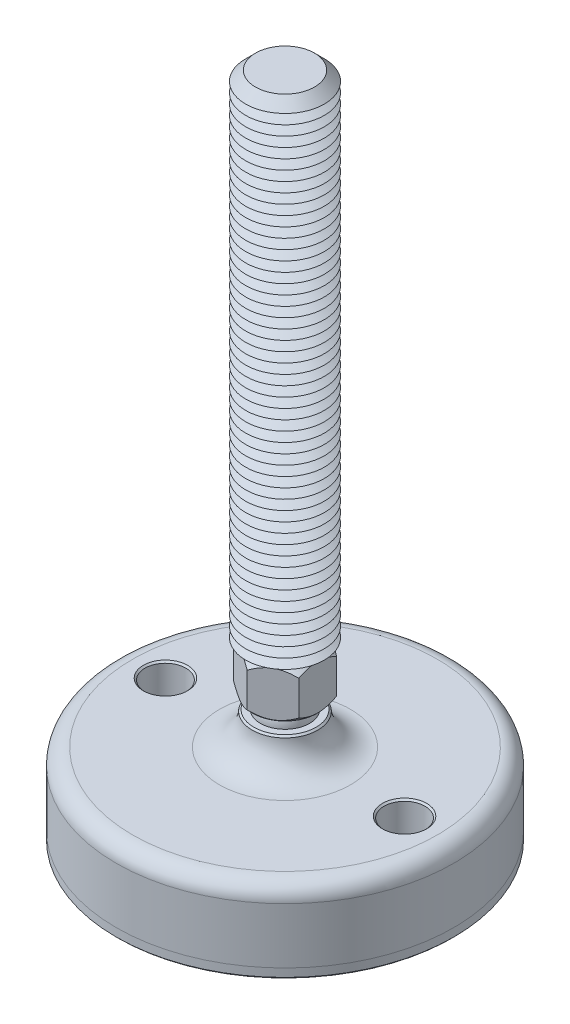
ISO-10303-21;
HEADER;
FILE_DESCRIPTION(('STEP AP214'),'2;1');
FILE_NAME('part.step','',(''),(''),'','','');
FILE_SCHEMA(('AUTOMOTIVE_DESIGN { 1 0 10303 214 1 1 1 1 }'));
ENDSEC;
DATA;
#1=APPLICATION_CONTEXT('core data for automotive mechanical design processes');
#2=APPLICATION_PROTOCOL_DEFINITION('international standard','automotive_design',2000,#1);
#3=PRODUCT_CONTEXT('',#1,'mechanical');
#4=PRODUCT('Part','Part','',(#3));
#5=PRODUCT_RELATED_PRODUCT_CATEGORY('part','',(#4));
#6=PRODUCT_DEFINITION_FORMATION('','',#4);
#7=PRODUCT_DEFINITION_CONTEXT('part definition',#1,'design');
#8=PRODUCT_DEFINITION('design','',#6,#7);
#9=PRODUCT_DEFINITION_SHAPE('','',#8);
#10=(LENGTH_UNIT() NAMED_UNIT(*) SI_UNIT(.MILLI.,.METRE.));
#11=(NAMED_UNIT(*) PLANE_ANGLE_UNIT() SI_UNIT($,.RADIAN.));
#12=(NAMED_UNIT(*) SI_UNIT($,.STERADIAN.) SOLID_ANGLE_UNIT());
#13=UNCERTAINTY_MEASURE_WITH_UNIT(LENGTH_MEASURE(1.E-05),#10,'distance_accuracy_value','');
#14=(GEOMETRIC_REPRESENTATION_CONTEXT(3) GLOBAL_UNCERTAINTY_ASSIGNED_CONTEXT((#13)) GLOBAL_UNIT_ASSIGNED_CONTEXT((#10,
#11,#12)) REPRESENTATION_CONTEXT('',''));
#15=CARTESIAN_POINT('',(0.,0.,0.));
#16=DIRECTION('',(0.,0.,1.));
#17=DIRECTION('',(1.,0.,0.));
#18=AXIS2_PLACEMENT_3D('',#15,#16,#17);
#19=CARTESIAN_POINT('',(0.,-32.,0.));
#20=DIRECTION('',(0.,1.,0.));
#21=DIRECTION('',(0.,0.,1.));
#22=AXIS2_PLACEMENT_3D('',#19,#20,#21);
#23=PLANE('',#22);
#24=CARTESIAN_POINT('',(-36.5,-32.,0.));
#25=DIRECTION('',(0.,1.,0.));
#26=DIRECTION('',(0.,0.,1.));
#27=AXIS2_PLACEMENT_3D('',#24,#25,#26);
#28=CIRCLE('',#27,6.25);
#29=CARTESIAN_POINT('',(-36.5,-32.,6.25));
#30=VERTEX_POINT('',#29);
#31=EDGE_CURVE('P0_E43',#30,#30,#28,.T.);
#32=ORIENTED_EDGE('',*,*,#31,.F.);
#33=EDGE_LOOP('',(#32));
#34=FACE_BOUND('',#33,.T.);
#35=CARTESIAN_POINT('',(36.5,-32.,0.));
#36=DIRECTION('',(0.,1.,0.));
#37=DIRECTION('',(0.,0.,1.));
#38=AXIS2_PLACEMENT_3D('',#35,#36,#37);
#39=CIRCLE('',#38,6.25);
#40=CARTESIAN_POINT('',(36.5,-32.,6.25));
#41=VERTEX_POINT('',#40);
#42=EDGE_CURVE('P0_E44',#41,#41,#39,.T.);
#43=ORIENTED_EDGE('',*,*,#42,.F.);
#44=EDGE_LOOP('',(#43));
#45=FACE_BOUND('',#44,.T.);
#46=CARTESIAN_POINT('',(0.,-32.,0.));
#47=DIRECTION('',(0.,1.,0.));
#48=DIRECTION('',(0.,0.,1.));
#49=AXIS2_PLACEMENT_3D('',#46,#47,#48);
#50=CIRCLE('',#49,51.5);
#51=CARTESIAN_POINT('',(0.,-32.,51.5));
#52=VERTEX_POINT('',#51);
#53=EDGE_CURVE('P0_E40',#52,#52,#50,.T.);
#54=ORIENTED_EDGE('',*,*,#53,.T.);
#55=EDGE_LOOP('',(#54));
#56=FACE_BOUND('',#55,.T.);
#57=ADVANCED_FACE('P0_F14',(#34,#45,#56),#23,.T.);
#58=CARTESIAN_POINT('',(0.,43.1654938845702,0.));
#59=DIRECTION('',(0.,1.,0.));
#60=DIRECTION('',(0.,0.,1.));
#61=AXIS2_PLACEMENT_3D('',#58,#59,#60);
#62=CYLINDRICAL_SURFACE('',#61,51.5);
#63=CARTESIAN_POINT('',(0.,-34.5,0.));
#64=DIRECTION('',(0.,-1.,0.));
#65=DIRECTION('',(0.,0.,-1.));
#66=AXIS2_PLACEMENT_3D('',#63,#64,#65);
#67=CIRCLE('',#66,51.5);
#68=CARTESIAN_POINT('',(0.,-34.5,-51.5));
#69=VERTEX_POINT('',#68);
#70=EDGE_CURVE('P0_E37',#69,#69,#67,.F.);
#71=ORIENTED_EDGE('',*,*,#70,.T.);
#72=EDGE_LOOP('',(#71));
#73=FACE_BOUND('',#72,.T.);
#74=ORIENTED_EDGE('',*,*,#53,.F.);
#75=EDGE_LOOP('',(#74));
#76=FACE_BOUND('',#75,.T.);
#77=ADVANCED_FACE('P0_F54',(#73,#76),#62,.T.);
#78=CARTESIAN_POINT('',(0.,-35.,51.5));
#79=DIRECTION('',(0.,-1.,0.));
#80=DIRECTION('',(0.,0.,-1.));
#81=AXIS2_PLACEMENT_3D('',#78,#79,#80);
#82=PLANE('',#81);
#83=CARTESIAN_POINT('',(36.5,-35.,0.));
#84=DIRECTION('',(0.,-1.,0.));
#85=DIRECTION('',(0.,0.,-1.));
#86=AXIS2_PLACEMENT_3D('',#83,#84,#85);
#87=CIRCLE('',#86,6.75000000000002);
#88=CARTESIAN_POINT('',(36.5,-35.,-6.75000000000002));
#89=VERTEX_POINT('',#88);
#90=EDGE_CURVE('P0_E25',#89,#89,#87,.F.);
#91=ORIENTED_EDGE('',*,*,#90,.T.);
#92=EDGE_LOOP('',(#91));
#93=FACE_BOUND('',#92,.T.);
#94=CARTESIAN_POINT('',(-36.5,-35.,0.));
#95=DIRECTION('',(0.,-1.,0.));
#96=DIRECTION('',(0.,0.,-1.));
#97=AXIS2_PLACEMENT_3D('',#94,#95,#96);
#98=CIRCLE('',#97,6.74999999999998);
#99=CARTESIAN_POINT('',(-36.5,-35.,-6.74999999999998));
#100=VERTEX_POINT('',#99);
#101=EDGE_CURVE('P0_E29',#100,#100,#98,.F.);
#102=ORIENTED_EDGE('',*,*,#101,.T.);
#103=EDGE_LOOP('',(#102));
#104=FACE_BOUND('',#103,.T.);
#105=CARTESIAN_POINT('',(0.,-35.,0.));
#106=DIRECTION('',(0.,-1.,0.));
#107=DIRECTION('',(0.,0.,-1.));
#108=AXIS2_PLACEMENT_3D('',#105,#106,#107);
#109=CIRCLE('',#108,51.);
#110=CARTESIAN_POINT('',(0.,-35.,-51.));
#111=VERTEX_POINT('',#110);
#112=EDGE_CURVE('P0_E34',#111,#111,#109,.T.);
#113=ORIENTED_EDGE('',*,*,#112,.T.);
#114=EDGE_LOOP('',(#113));
#115=FACE_BOUND('',#114,.T.);
#116=ADVANCED_FACE('P0_F61',(#93,#104,#115),#82,.T.);
#117=CARTESIAN_POINT('',(0.,-34.5,0.));
#118=DIRECTION('',(0.,1.,0.));
#119=DIRECTION('',(0.,0.,1.));
#120=AXIS2_PLACEMENT_3D('',#117,#118,#119);
#121=CONICAL_SURFACE('',#120,51.5,0.785398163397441);
#122=ORIENTED_EDGE('',*,*,#112,.F.);
#123=EDGE_LOOP('',(#122));
#124=FACE_BOUND('',#123,.T.);
#125=ORIENTED_EDGE('',*,*,#70,.F.);
#126=EDGE_LOOP('',(#125));
#127=FACE_BOUND('',#126,.T.);
#128=ADVANCED_FACE('P0_F68',(#124,#127),#121,.T.);
#129=CARTESIAN_POINT('',(36.5,-35.,0.));
#130=DIRECTION('',(0.,1.,0.));
#131=DIRECTION('',(0.,0.,1.));
#132=AXIS2_PLACEMENT_3D('',#129,#130,#131);
#133=CYLINDRICAL_SURFACE('',#132,6.25);
#134=CARTESIAN_POINT('',(36.5,-34.5,0.));
#135=DIRECTION('',(0.,-1.,0.));
#136=DIRECTION('',(0.,0.,-1.));
#137=AXIS2_PLACEMENT_3D('',#134,#135,#136);
#138=CIRCLE('',#137,6.25);
#139=CARTESIAN_POINT('',(36.5,-34.5,-6.25));
#140=VERTEX_POINT('',#139);
#141=EDGE_CURVE('P0_E21',#140,#140,#138,.T.);
#142=ORIENTED_EDGE('',*,*,#141,.T.);
#143=EDGE_LOOP('',(#142));
#144=FACE_BOUND('',#143,.T.);
#145=ORIENTED_EDGE('',*,*,#42,.T.);
#146=EDGE_LOOP('',(#145));
#147=FACE_BOUND('',#146,.T.);
#148=ADVANCED_FACE('P0_F74',(#144,#147),#133,.F.);
#149=CARTESIAN_POINT('',(-36.5,-35.,0.));
#150=DIRECTION('',(0.,1.,0.));
#151=DIRECTION('',(0.,0.,1.));
#152=AXIS2_PLACEMENT_3D('',#149,#150,#151);
#153=CYLINDRICAL_SURFACE('',#152,6.25);
#154=CARTESIAN_POINT('',(-36.5,-34.5,0.));
#155=DIRECTION('',(0.,-1.,0.));
#156=DIRECTION('',(0.,0.,-1.));
#157=AXIS2_PLACEMENT_3D('',#154,#155,#156);
#158=CIRCLE('',#157,6.25);
#159=CARTESIAN_POINT('',(-36.5,-34.5,-6.25));
#160=VERTEX_POINT('',#159);
#161=EDGE_CURVE('P0_E10',#160,#160,#158,.T.);
#162=ORIENTED_EDGE('',*,*,#161,.T.);
#163=EDGE_LOOP('',(#162));
#164=FACE_BOUND('',#163,.T.);
#165=ORIENTED_EDGE('',*,*,#31,.T.);
#166=EDGE_LOOP('',(#165));
#167=FACE_BOUND('',#166,.T.);
#168=ADVANCED_FACE('P0_F50',(#164,#167),#153,.F.);
#169=CARTESIAN_POINT('',(36.5,-35.,0.));
#170=DIRECTION('',(0.,-1.,0.));
#171=DIRECTION('',(0.,0.,-1.));
#172=AXIS2_PLACEMENT_3D('',#169,#170,#171);
#173=CONICAL_SURFACE('',#172,6.75000000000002,0.785398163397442);
#174=ORIENTED_EDGE('',*,*,#141,.F.);
#175=EDGE_LOOP('',(#174));
#176=FACE_BOUND('',#175,.T.);
#177=ORIENTED_EDGE('',*,*,#90,.F.);
#178=EDGE_LOOP('',(#177));
#179=FACE_BOUND('',#178,.T.);
#180=ADVANCED_FACE('P0_F76',(#176,#179),#173,.F.);
#181=CARTESIAN_POINT('',(-36.5,-35.,0.));
#182=DIRECTION('',(0.,-1.,0.));
#183=DIRECTION('',(0.,0.,-1.));
#184=AXIS2_PLACEMENT_3D('',#181,#182,#183);
#185=CONICAL_SURFACE('',#184,6.74999999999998,0.785398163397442);
#186=ORIENTED_EDGE('',*,*,#161,.F.);
#187=EDGE_LOOP('',(#186));
#188=FACE_BOUND('',#187,.T.);
#189=ORIENTED_EDGE('',*,*,#101,.F.);
#190=EDGE_LOOP('',(#189));
#191=FACE_BOUND('',#190,.T.);
#192=ADVANCED_FACE('P0_F16',(#188,#191),#185,.F.);
#193=CLOSED_SHELL('',(#57,#77,#116,#128,#148,#168,#180,#192));
#194=MANIFOLD_SOLID_BREP('P0_B1',#193);
#195=CARTESIAN_POINT('',(0.,3.75,0.));
#196=DIRECTION('',(0.,1.,0.));
#197=DIRECTION('',(0.,0.,1.));
#198=AXIS2_PLACEMENT_3D('',#195,#196,#197);
#199=PLANE('',#198);
#200=CARTESIAN_POINT('',(0.,3.75,0.));
#201=DIRECTION('',(0.,1.,0.));
#202=DIRECTION('',(0.,0.,1.));
#203=AXIS2_PLACEMENT_3D('',#200,#201,#202);
#204=CIRCLE('',#203,9.72829454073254);
#205=CARTESIAN_POINT('',(0.,3.75,9.72829454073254));
#206=VERTEX_POINT('',#205);
#207=EDGE_CURVE('P1_E211',#206,#206,#204,.T.);
#208=ORIENTED_EDGE('',*,*,#207,.F.);
#209=EDGE_LOOP('',(#208));
#210=FACE_BOUND('',#209,.T.);
#211=CARTESIAN_POINT('',(0.,3.75,0.));
#212=DIRECTION('',(0.,1.,0.));
#213=DIRECTION('',(0.,0.,1.));
#214=AXIS2_PLACEMENT_3D('',#211,#212,#213);
#215=CIRCLE('',#214,6.49519052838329);
#216=CARTESIAN_POINT('',(0.,3.75,6.49519052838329));
#217=VERTEX_POINT('',#216);
#218=EDGE_CURVE('P1_E24',#217,#217,#215,.F.);
#219=ORIENTED_EDGE('',*,*,#218,.F.);
#220=EDGE_LOOP('',(#219));
#221=FACE_BOUND('',#220,.T.);
#222=ADVANCED_FACE('P1_F16',(#210,#221),#199,.F.);
#223=CARTESIAN_POINT('',(0.,0.,0.));
#224=DIRECTION('',(0.,1.,0.));
#225=DIRECTION('',(0.,0.,-1.));
#226=AXIS2_PLACEMENT_3D('',#223,#224,#225);
#227=SPHERICAL_SURFACE('',#226,7.5);
#228=ORIENTED_EDGE('',*,*,#218,.T.);
#229=EDGE_LOOP('',(#228));
#230=FACE_BOUND('',#229,.T.);
#231=ADVANCED_FACE('P1_F201',(#230),#227,.T.);
#232=CARTESIAN_POINT('',(0.,3.75,0.));
#233=DIRECTION('',(0.,1.,0.));
#234=DIRECTION('',(0.,0.,1.));
#235=AXIS2_PLACEMENT_3D('',#232,#233,#234);
#236=CONICAL_SURFACE('',#235,9.72829454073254,0.785398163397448);
#237=ORIENTED_EDGE('',*,*,#207,.T.);
#238=EDGE_LOOP('',(#237));
#239=FACE_BOUND('',#238,.T.);
#240=CARTESIAN_POINT('',(-10.,9.59571642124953,-11.9394228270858));
#241=CARTESIAN_POINT('',(-10.,9.37430561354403,-11.6505452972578));
#242=CARTESIAN_POINT('',(-10.,9.15490936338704,-11.3600988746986));
#243=CARTESIAN_POINT('',(-10.,8.72106267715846,-10.7754314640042));
#244=CARTESIAN_POINT('',(-10.,8.50661343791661,-10.4812095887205));
#245=CARTESIAN_POINT('',(-10.,8.08205114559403,-9.88620330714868));
#246=CARTESIAN_POINT('',(-10.,7.87198437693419,-9.58538576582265));
#247=CARTESIAN_POINT('',(-10.,7.45926520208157,-8.97872312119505));
#248=CARTESIAN_POINT('',(-10.,7.25661228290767,-8.67287836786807));
#249=CARTESIAN_POINT('',(-10.,6.84809543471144,-8.03614350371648));
#250=CARTESIAN_POINT('',(-10.,6.64281401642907,-7.70487777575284));
#251=CARTESIAN_POINT('',(-10.,6.245142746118,-7.03457466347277));
#252=CARTESIAN_POINT('',(-10.,6.0527550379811,-6.69553599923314));
#253=CARTESIAN_POINT('',(-10.,5.68497951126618,-6.00961937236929));
#254=CARTESIAN_POINT('',(-10.,5.50954176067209,-5.66276839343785));
#255=CARTESIAN_POINT('',(-10.,5.17959635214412,-4.95932933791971));
#256=CARTESIAN_POINT('',(-10.,5.02507889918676,-4.60274591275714));
#257=CARTESIAN_POINT('',(-10.,4.75599518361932,-3.91353381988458));
#258=CARTESIAN_POINT('',(-10.,4.63902686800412,-3.58185263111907));
#259=CARTESIAN_POINT('',(-10.,4.43164927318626,-2.91013341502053));
#260=CARTESIAN_POINT('',(-10.,4.34124171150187,-2.57009484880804));
#261=CARTESIAN_POINT('',(-10.,4.19334931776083,-1.88955843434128));
#262=CARTESIAN_POINT('',(-10.,4.13527351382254,-1.54919119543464));
#263=CARTESIAN_POINT('',(-10.,4.05324021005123,-0.864347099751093));
#264=CARTESIAN_POINT('',(-10.,4.029275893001,-0.519871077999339));
#265=CARTESIAN_POINT('',(-10.,4.01745435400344,0.155191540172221));
#266=CARTESIAN_POINT('',(-10.,4.02812008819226,0.485752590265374));
#267=CARTESIAN_POINT('',(-10.,4.08160326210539,1.1442457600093));
#268=CARTESIAN_POINT('',(-10.,4.12442366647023,1.47217763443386));
#269=CARTESIAN_POINT('',(-10.,4.24054019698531,2.12859326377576));
#270=CARTESIAN_POINT('',(-10.,4.31437036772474,2.45698095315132));
#271=CARTESIAN_POINT('',(-10.,4.48844287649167,3.10654175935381));
#272=CARTESIAN_POINT('',(-10.,4.58868356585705,3.42771532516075));
#273=CARTESIAN_POINT('',(-10.,4.81839210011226,4.08271396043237));
#274=CARTESIAN_POINT('',(-10.,4.94932842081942,4.41601827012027));
#275=CARTESIAN_POINT('',(-10.,5.23140828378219,5.07403931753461));
#276=CARTESIAN_POINT('',(-10.,5.38256099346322,5.3987520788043));
#277=CARTESIAN_POINT('',(-10.,5.70148727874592,6.04113299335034));
#278=CARTESIAN_POINT('',(-10.,5.86931223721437,6.35877542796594));
#279=CARTESIAN_POINT('',(-10.,6.21788686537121,6.98677627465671));
#280=CARTESIAN_POINT('',(-10.,6.39863453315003,7.29713580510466));
#281=CARTESIAN_POINT('',(-10.,6.76133545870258,7.89633938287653));
#282=CARTESIAN_POINT('',(-10.,6.94278731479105,8.18548854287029));
#283=CARTESIAN_POINT('',(-10.,7.31339871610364,8.75881961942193));
#284=CARTESIAN_POINT('',(-10.,7.50255884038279,9.04300116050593));
#285=CARTESIAN_POINT('',(-10.,7.8856676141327,9.6047584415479));
#286=CARTESIAN_POINT('',(-10.,8.07956548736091,9.88236893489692));
#287=CARTESIAN_POINT('',(-10.,8.47254700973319,10.4337838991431));
#288=CARTESIAN_POINT('',(-10.,8.67162921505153,10.7075893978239));
#289=CARTESIAN_POINT('',(-10.,8.87283307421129,10.9797992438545));
#290=B_SPLINE_CURVE_WITH_KNOTS('',3,(#240,#241,#242,#243,#244,#245,#246,#247,#248,#249,#250,
#251,#252,#253,#254,#255,#256,#257,#258,#259,#260,#261,#262,#263,#264,#265,#266,#267,#268,#269,
#270,#271,#272,#273,#274,#275,#276,#277,#278,#279,#280,#281,#282,#283,#284,#285,#286,#287,#288,
#289),.UNSPECIFIED.,.F.,.F.,(4,2,2,2,2,2,2,2,2,2,2,2,2,2,2,2,2,2,2,2,2,2,2,2,4),(0.,
1.09192545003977,2.18411235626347,3.28473497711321,4.3852812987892,5.5541916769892,
6.72329593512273,7.88884387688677,9.05384420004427,10.1080362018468,11.1622963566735,
12.1965943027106,13.2306855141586,14.2212593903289,15.2119246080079,16.2203997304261,
17.2288119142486,18.3022883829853,19.3762532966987,20.4536373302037,21.5308548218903,
22.5548150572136,23.5788523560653,24.5946500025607,25.6101677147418),.UNSPECIFIED.);
#291=CARTESIAN_POINT('',(-10.,5.56871084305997,-5.77350269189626));
#292=VERTEX_POINT('',#291);
#293=CARTESIAN_POINT('',(-10.,5.56871084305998,5.77350269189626));
#294=VERTEX_POINT('',#293);
#295=EDGE_CURVE('P1_E185',#292,#294,#290,.T.);
#296=ORIENTED_EDGE('',*,*,#295,.F.);
#297=CARTESIAN_POINT('',(0.000199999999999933,5.56882631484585,-11.5471208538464));
#298=CARTESIAN_POINT('',(-0.171722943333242,5.4695807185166,-11.447861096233));
#299=CARTESIAN_POINT('',(-0.344992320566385,5.37336355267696,-11.3478239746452));
#300=CARTESIAN_POINT('',(-0.694433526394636,5.18794806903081,-11.1460740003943));
#301=CARTESIAN_POINT('',(-0.870606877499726,5.09875358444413,-11.0443602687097));
#302=CARTESIAN_POINT('',(-1.22689656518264,4.92796770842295,-10.8386563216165));
#303=CARTESIAN_POINT('',(-1.40702970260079,4.84642277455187,-10.7346564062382));
#304=CARTESIAN_POINT('',(-1.77025459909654,4.69270708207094,-10.52494841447));
#305=CARTESIAN_POINT('',(-1.95334590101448,4.62053489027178,-10.4192406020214));
#306=CARTESIAN_POINT('',(-2.31954331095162,4.4878482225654,-10.2078164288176));
#307=CARTESIAN_POINT('',(-2.50260441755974,4.42716910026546,-10.1021260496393));
#308=CARTESIAN_POINT('',(-2.87129282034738,4.31731511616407,-9.88926370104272));
#309=CARTESIAN_POINT('',(-3.05691983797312,4.26813901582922,-9.78209189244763));
#310=CARTESIAN_POINT('',(-3.42994608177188,4.1825291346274,-9.56672509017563));
#311=CARTESIAN_POINT('',(-3.61734032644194,4.14606667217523,-9.45853297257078));
#312=CARTESIAN_POINT('',(-3.99370204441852,4.08668528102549,-9.24124043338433));
#313=CARTESIAN_POINT('',(-4.1826692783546,4.06376432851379,-9.13214015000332));
#314=CARTESIAN_POINT('',(-4.64316633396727,4.0253323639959,-8.86627205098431));
#315=CARTESIAN_POINT('',(-4.91519388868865,4.01726744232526,-8.70921686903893));
#316=CARTESIAN_POINT('',(-5.45875701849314,4.03080424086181,-8.39539054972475));
#317=CARTESIAN_POINT('',(-5.7302923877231,4.05241636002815,-8.23861953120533));
#318=CARTESIAN_POINT('',(-6.27080349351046,4.12403157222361,-7.92655529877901));
#319=CARTESIAN_POINT('',(-6.53977602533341,4.17406641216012,-7.77126393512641));
#320=CARTESIAN_POINT('',(-7.07309796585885,4.29980733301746,-7.46335036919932));
#321=CARTESIAN_POINT('',(-7.33744772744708,4.3755114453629,-7.31072796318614));
#322=CARTESIAN_POINT('',(-7.80670351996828,4.53125365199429,-7.03980300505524));
#323=CARTESIAN_POINT('',(-8.01264886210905,4.60719488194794,-6.92090040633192));
#324=CARTESIAN_POINT('',(-8.42084280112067,4.77131434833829,-6.68522952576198));
#325=CARTESIAN_POINT('',(-8.62309128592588,4.85949295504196,-6.5684613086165));
#326=CARTESIAN_POINT('',(-9.02325448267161,5.04611070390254,-6.33742697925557));
#327=CARTESIAN_POINT('',(-9.22118057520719,5.1445175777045,-6.2231542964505));
#328=CARTESIAN_POINT('',(-9.61336795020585,5.35030005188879,-5.99672480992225));
#329=CARTESIAN_POINT('',(-9.80763139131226,5.45767015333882,-5.88456675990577));
#330=CARTESIAN_POINT('',(-10.0002,5.56882631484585,-5.77338722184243));
#331=B_SPLINE_CURVE_WITH_KNOTS('',3,(#297,#298,#299,#300,#301,#302,#303,#304,#305,#306,#307,
#308,#309,#310,#311,#312,#313,#314,#315,#316,#317,#318,#319,#320,#321,#322,#323,#324,#325,#326,
#327,#328,#329,#330),.UNSPECIFIED.,.F.,.F.,(4,2,2,2,2,2,2,2,2,2,2,2,2,2,2,2,4),(0.,
0.665863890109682,1.33208874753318,2.00212824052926,2.67206515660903,3.33152613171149,
3.99091606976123,4.64880867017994,5.30660292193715,6.24777541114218,7.18927777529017,
8.13183382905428,9.07431761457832,9.82287578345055,10.5714566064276,11.3177436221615,
12.0635761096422),.UNSPECIFIED.);
#332=CARTESIAN_POINT('',(0.,5.56871084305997,-11.5470053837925));
#333=VERTEX_POINT('',#332);
#334=EDGE_CURVE('P1_E179',#333,#292,#331,.T.);
#335=ORIENTED_EDGE('',*,*,#334,.F.);
#336=CARTESIAN_POINT('',(10.0002,5.56882631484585,-5.77338722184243));
#337=CARTESIAN_POINT('',(9.82827705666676,5.4695807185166,-5.87264697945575));
#338=CARTESIAN_POINT('',(9.65500767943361,5.37336355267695,-5.97268410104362));
#339=CARTESIAN_POINT('',(9.30556647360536,5.18794806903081,-6.17443407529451));
#340=CARTESIAN_POINT('',(9.12939312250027,5.09875358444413,-6.27614780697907));
#341=CARTESIAN_POINT('',(8.77310343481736,4.92796770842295,-6.48185175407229));
#342=CARTESIAN_POINT('',(8.59297029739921,4.84642277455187,-6.58585166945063));
#343=CARTESIAN_POINT('',(8.22974540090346,4.69270708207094,-6.79555966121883));
#344=CARTESIAN_POINT('',(8.04665409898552,4.62053489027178,-6.90126747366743));
#345=CARTESIAN_POINT('',(7.68045668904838,4.4878482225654,-7.11269164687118));
#346=CARTESIAN_POINT('',(7.49739558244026,4.42716910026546,-7.21838202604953));
#347=CARTESIAN_POINT('',(7.12870717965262,4.31731511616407,-7.43124437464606));
#348=CARTESIAN_POINT('',(6.94308016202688,4.26813901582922,-7.53841618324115));
#349=CARTESIAN_POINT('',(6.57005391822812,4.1825291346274,-7.75378298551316));
#350=CARTESIAN_POINT('',(6.38265967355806,4.14606667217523,-7.861975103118));
#351=CARTESIAN_POINT('',(6.00629795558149,4.08668528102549,-8.07926764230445));
#352=CARTESIAN_POINT('',(5.81733072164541,4.06376432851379,-8.18836792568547));
#353=CARTESIAN_POINT('',(5.35683366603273,4.0253323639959,-8.45423602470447));
#354=CARTESIAN_POINT('',(5.08480611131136,4.01726744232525,-8.61129120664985));
#355=CARTESIAN_POINT('',(4.54124298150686,4.03080424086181,-8.92511752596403));
#356=CARTESIAN_POINT('',(4.2697076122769,4.05241636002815,-9.08188854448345));
#357=CARTESIAN_POINT('',(3.72919650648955,4.12403157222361,-9.39395277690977));
#358=CARTESIAN_POINT('',(3.46022397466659,4.17406641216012,-9.54924414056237));
#359=CARTESIAN_POINT('',(2.92690203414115,4.29980733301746,-9.85715770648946));
#360=CARTESIAN_POINT('',(2.66255227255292,4.37551144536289,-10.0097801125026));
#361=CARTESIAN_POINT('',(2.19329648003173,4.53125365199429,-10.2807050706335));
#362=CARTESIAN_POINT('',(1.98735113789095,4.60719488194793,-10.3996076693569));
#363=CARTESIAN_POINT('',(1.57915719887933,4.77131434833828,-10.6352785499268));
#364=CARTESIAN_POINT('',(1.37690871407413,4.85949295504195,-10.7520467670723));
#365=CARTESIAN_POINT('',(0.976745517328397,5.04611070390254,-10.9830810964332));
#366=CARTESIAN_POINT('',(0.77881942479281,5.1445175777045,-11.0973537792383));
#367=CARTESIAN_POINT('',(0.386632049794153,5.35030005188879,-11.3237832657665));
#368=CARTESIAN_POINT('',(0.192368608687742,5.45767015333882,-11.435941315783));
#369=CARTESIAN_POINT('',(-0.000199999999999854,5.56882631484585,-11.5471208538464));
#370=B_SPLINE_CURVE_WITH_KNOTS('',3,(#336,#337,#338,#339,#340,#341,#342,#343,#344,#345,#346,
#347,#348,#349,#350,#351,#352,#353,#354,#355,#356,#357,#358,#359,#360,#361,#362,#363,#364,#365,
#366,#367,#368,#369),.UNSPECIFIED.,.F.,.F.,(4,2,2,2,2,2,2,2,2,2,2,2,2,2,2,2,4),(0.,
0.665863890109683,1.33208874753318,2.00212824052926,2.67206515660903,3.33152613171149,
3.99091606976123,4.64880867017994,5.30660292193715,6.24777541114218,7.18927777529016,
8.13183382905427,9.07431761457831,9.82287578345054,10.5714566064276,11.3177436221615,
12.0635761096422),.UNSPECIFIED.);
#371=CARTESIAN_POINT('',(9.99999999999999,5.56871084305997,-5.77350269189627));
#372=VERTEX_POINT('',#371);
#373=EDGE_CURVE('P1_E167',#372,#333,#370,.T.);
#374=ORIENTED_EDGE('',*,*,#373,.F.);
#375=CARTESIAN_POINT('',(10.,9.59571642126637,-11.9394228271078));
#376=CARTESIAN_POINT('',(10.,9.37430561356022,-11.6505452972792));
#377=CARTESIAN_POINT('',(10.,9.15490936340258,-11.3600988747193));
#378=CARTESIAN_POINT('',(10.,8.7210626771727,-10.7754314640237));
#379=CARTESIAN_POINT('',(10.,8.5066134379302,-10.4812095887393));
#380=CARTESIAN_POINT('',(10.,8.08205114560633,-9.88620330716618));
#381=CARTESIAN_POINT('',(10.,7.87198437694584,-9.58538576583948));
#382=CARTESIAN_POINT('',(10.,7.45926520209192,-8.97872312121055));
#383=CARTESIAN_POINT('',(10.,7.25661228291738,-8.67287836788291));
#384=CARTESIAN_POINT('',(10.,6.84809543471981,-8.03614350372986));
#385=CARTESIAN_POINT('',(10.,6.64281401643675,-7.70487777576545));
#386=CARTESIAN_POINT('',(10.,6.24514274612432,-7.03457466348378));
#387=CARTESIAN_POINT('',(10.,6.05275503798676,-6.69553599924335));
#388=CARTESIAN_POINT('',(10.,5.68497951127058,-6.00961937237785));
#389=CARTESIAN_POINT('',(10.,5.50954176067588,-5.66276839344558));
#390=CARTESIAN_POINT('',(10.,5.17959635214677,-4.95932933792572));
#391=CARTESIAN_POINT('',(10.,5.02507889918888,-4.60274591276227));
#392=CARTESIAN_POINT('',(10.,4.75599518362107,-3.91353381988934));
#393=CARTESIAN_POINT('',(10.,4.63902686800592,-3.58185263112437));
#394=CARTESIAN_POINT('',(10.,4.43164927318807,-2.91013341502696));
#395=CARTESIAN_POINT('',(10.,4.34124171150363,-2.57009484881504));
#396=CARTESIAN_POINT('',(10.,4.19334931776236,-1.8895584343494));
#397=CARTESIAN_POINT('',(10.,4.13527351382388,-1.54919119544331));
#398=CARTESIAN_POINT('',(10.,4.05324021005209,-0.86434709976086));
#399=CARTESIAN_POINT('',(10.,4.02927589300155,-0.519871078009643));
#400=CARTESIAN_POINT('',(10.,4.01745435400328,0.155191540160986));
#401=CARTESIAN_POINT('',(10.,4.0281200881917,0.485752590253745));
#402=CARTESIAN_POINT('',(10.,4.08160326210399,1.14424575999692));
#403=CARTESIAN_POINT('',(10.,4.12442366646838,1.47217763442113));
#404=CARTESIAN_POINT('',(10.,4.24054019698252,2.12859326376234));
#405=CARTESIAN_POINT('',(10.,4.31437036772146,2.45698095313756));
#406=CARTESIAN_POINT('',(10.,4.48844287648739,3.1065417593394));
#407=CARTESIAN_POINT('',(10.,4.58868356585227,3.42771532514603));
#408=CARTESIAN_POINT('',(10.,4.81839210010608,4.08271396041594));
#409=CARTESIAN_POINT('',(10.,4.94932842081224,4.41601827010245));
#410=CARTESIAN_POINT('',(10.,5.23140828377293,5.0740393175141));
#411=CARTESIAN_POINT('',(10.,5.38256099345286,5.39875207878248));
#412=CARTESIAN_POINT('',(10.,5.70148727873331,6.04113299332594));
#413=CARTESIAN_POINT('',(10.,5.86931223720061,6.35877542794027));
#414=CARTESIAN_POINT('',(10.,6.21788686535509,6.98677627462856));
#415=CARTESIAN_POINT('',(10.,6.39863453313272,7.29713580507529));
#416=CARTESIAN_POINT('',(10.,6.761335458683,7.89633938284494));
#417=CARTESIAN_POINT('',(10.,6.9427873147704,8.18548854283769));
#418=CARTESIAN_POINT('',(10.,7.31339871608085,8.75881961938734));
#419=CARTESIAN_POINT('',(10.,7.50255884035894,9.04300116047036));
#420=CARTESIAN_POINT('',(10.,7.88566761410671,9.60475844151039));
#421=CARTESIAN_POINT('',(10.,8.07956548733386,9.88236893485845));
#422=CARTESIAN_POINT('',(10.,8.47254700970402,10.4337838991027));
#423=CARTESIAN_POINT('',(10.,8.6716292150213,10.7075893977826));
#424=CARTESIAN_POINT('',(10.,8.87283307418,10.9797992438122));
#425=B_SPLINE_CURVE_WITH_KNOTS('',3,(#375,#376,#377,#378,#379,#380,#381,#382,#383,#384,#385,
#386,#387,#388,#389,#390,#391,#392,#393,#394,#395,#396,#397,#398,#399,#400,#401,#402,#403,#404,
#405,#406,#407,#408,#409,#410,#411,#412,#413,#414,#415,#416,#417,#418,#419,#420,#421,#422,#423,
#424),.UNSPECIFIED.,.F.,.F.,(4,2,2,2,2,2,2,2,2,2,2,2,2,2,2,2,2,2,2,2,2,2,2,2,4),(0.,
1.09192545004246,2.18411235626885,3.28473497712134,4.38528129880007,5.55419167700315,
6.72329593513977,7.88884387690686,9.05384420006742,10.1080362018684,11.1622963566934,
12.196594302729,13.2306855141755,14.2212593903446,15.2119246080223,16.2203997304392,
17.2288119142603,18.3022883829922,19.3762532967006,20.4536373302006,21.5308548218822,
22.5548150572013,23.5788523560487,24.5946500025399,25.6101677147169),.UNSPECIFIED.);
#426=CARTESIAN_POINT('',(10.,5.56871084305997,5.77350269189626));
#427=VERTEX_POINT('',#426);
#428=EDGE_CURVE('P1_E70',#427,#372,#425,.F.);
#429=ORIENTED_EDGE('',*,*,#428,.F.);
#430=CARTESIAN_POINT('',(-0.000200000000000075,5.56882631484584,11.5471208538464));
#431=CARTESIAN_POINT('',(0.171722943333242,5.4695807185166,11.447861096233));
#432=CARTESIAN_POINT('',(0.344992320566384,5.37336355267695,11.3478239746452));
#433=CARTESIAN_POINT('',(0.694433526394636,5.18794806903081,11.1460740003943));
#434=CARTESIAN_POINT('',(0.870606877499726,5.09875358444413,11.0443602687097));
#435=CARTESIAN_POINT('',(1.22689656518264,4.92796770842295,10.8386563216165));
#436=CARTESIAN_POINT('',(1.40702970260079,4.84642277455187,10.7346564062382));
#437=CARTESIAN_POINT('',(1.77025459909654,4.69270708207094,10.52494841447));
#438=CARTESIAN_POINT('',(1.95334590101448,4.62053489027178,10.4192406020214));
#439=CARTESIAN_POINT('',(2.31954331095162,4.4878482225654,10.2078164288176));
#440=CARTESIAN_POINT('',(2.50260441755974,4.42716910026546,10.1021260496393));
#441=CARTESIAN_POINT('',(2.87129282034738,4.31731511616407,9.88926370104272));
#442=CARTESIAN_POINT('',(3.05691983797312,4.26813901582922,9.78209189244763));
#443=CARTESIAN_POINT('',(3.42994608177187,4.18252913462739,9.56672509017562));
#444=CARTESIAN_POINT('',(3.61734032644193,4.14606667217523,9.45853297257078));
#445=CARTESIAN_POINT('',(3.99370204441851,4.08668528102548,9.24124043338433));
#446=CARTESIAN_POINT('',(4.18266927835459,4.06376432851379,9.13214015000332));
#447=CARTESIAN_POINT('',(4.64316633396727,4.0253323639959,8.86627205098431));
#448=CARTESIAN_POINT('',(4.91519388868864,4.01726744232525,8.70921686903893));
#449=CARTESIAN_POINT('',(5.45875701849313,4.03080424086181,8.39539054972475));
#450=CARTESIAN_POINT('',(5.7302923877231,4.05241636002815,8.23861953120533));
#451=CARTESIAN_POINT('',(6.27080349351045,4.1240315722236,7.92655529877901));
#452=CARTESIAN_POINT('',(6.53977602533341,4.17406641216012,7.77126393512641));
#453=CARTESIAN_POINT('',(7.07309796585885,4.29980733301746,7.46335036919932));
#454=CARTESIAN_POINT('',(7.33744772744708,4.37551144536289,7.31072796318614));
#455=CARTESIAN_POINT('',(7.80670351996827,4.53125365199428,7.03980300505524));
#456=CARTESIAN_POINT('',(8.01264886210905,4.60719488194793,6.92090040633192));
#457=CARTESIAN_POINT('',(8.42084280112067,4.77131434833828,6.68522952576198));
#458=CARTESIAN_POINT('',(8.62309128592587,4.85949295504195,6.5684613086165));
#459=CARTESIAN_POINT('',(9.0232544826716,5.04611070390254,6.33742697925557));
#460=CARTESIAN_POINT('',(9.22118057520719,5.1445175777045,6.2231542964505));
#461=CARTESIAN_POINT('',(9.61336795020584,5.35030005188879,5.99672480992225));
#462=CARTESIAN_POINT('',(9.80763139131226,5.45767015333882,5.88456675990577));
#463=CARTESIAN_POINT('',(10.0002,5.56882631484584,5.77338722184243));
#464=B_SPLINE_CURVE_WITH_KNOTS('',3,(#430,#431,#432,#433,#434,#435,#436,#437,#438,#439,#440,
#441,#442,#443,#444,#445,#446,#447,#448,#449,#450,#451,#452,#453,#454,#455,#456,#457,#458,#459,
#460,#461,#462,#463),.UNSPECIFIED.,.F.,.F.,(4,2,2,2,2,2,2,2,2,2,2,2,2,2,2,2,4),(0.,
0.665863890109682,1.33208874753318,2.00212824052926,2.67206515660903,3.33152613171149,
3.99091606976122,4.64880867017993,5.30660292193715,6.24777541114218,7.18927777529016,
8.13183382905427,9.07431761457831,9.82287578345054,10.5714566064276,11.3177436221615,
12.0635761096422),.UNSPECIFIED.);
#465=CARTESIAN_POINT('',(0.,5.56871084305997,11.5470053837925));
#466=VERTEX_POINT('',#465);
#467=EDGE_CURVE('P1_E67',#466,#427,#464,.T.);
#468=ORIENTED_EDGE('',*,*,#467,.F.);
#469=CARTESIAN_POINT('',(-10.0002,5.56882631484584,5.77338722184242));
#470=CARTESIAN_POINT('',(-9.82827705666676,5.4695807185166,5.87264697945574));
#471=CARTESIAN_POINT('',(-9.65500767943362,5.37336355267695,5.97268410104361));
#472=CARTESIAN_POINT('',(-9.30556647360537,5.18794806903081,6.1744340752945));
#473=CARTESIAN_POINT('',(-9.12939312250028,5.09875358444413,6.27614780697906));
#474=CARTESIAN_POINT('',(-8.77310343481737,4.92796770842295,6.48185175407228));
#475=CARTESIAN_POINT('',(-8.59297029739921,4.84642277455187,6.58585166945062));
#476=CARTESIAN_POINT('',(-8.22974540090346,4.69270708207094,6.79555966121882));
#477=CARTESIAN_POINT('',(-8.04665409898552,4.62053489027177,6.90126747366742));
#478=CARTESIAN_POINT('',(-7.68045668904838,4.48784822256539,7.11269164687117));
#479=CARTESIAN_POINT('',(-7.49739558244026,4.42716910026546,7.21838202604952));
#480=CARTESIAN_POINT('',(-7.12870717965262,4.31731511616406,7.43124437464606));
#481=CARTESIAN_POINT('',(-6.94308016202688,4.26813901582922,7.53841618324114));
#482=CARTESIAN_POINT('',(-6.57005391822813,4.18252913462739,7.75378298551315));
#483=CARTESIAN_POINT('',(-6.38265967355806,4.14606667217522,7.861975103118));
#484=CARTESIAN_POINT('',(-6.00629795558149,4.08668528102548,8.07926764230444));
#485=CARTESIAN_POINT('',(-5.81733072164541,4.06376432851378,8.18836792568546));
#486=CARTESIAN_POINT('',(-5.35683366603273,4.0253323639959,8.45423602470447));
#487=CARTESIAN_POINT('',(-5.08480611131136,4.01726744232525,8.61129120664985));
#488=CARTESIAN_POINT('',(-4.54124298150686,4.0308042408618,8.92511752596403));
#489=CARTESIAN_POINT('',(-4.2697076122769,4.05241636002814,9.08188854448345));
#490=CARTESIAN_POINT('',(-3.72919650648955,4.1240315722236,9.39395277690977));
#491=CARTESIAN_POINT('',(-3.46022397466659,4.17406641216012,9.54924414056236));
#492=CARTESIAN_POINT('',(-2.92690203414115,4.29980733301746,9.85715770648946));
#493=CARTESIAN_POINT('',(-2.66255227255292,4.37551144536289,10.0097801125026));
#494=CARTESIAN_POINT('',(-2.19329648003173,4.53125365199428,10.2807050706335));
#495=CARTESIAN_POINT('',(-1.98735113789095,4.60719488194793,10.3996076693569));
#496=CARTESIAN_POINT('',(-1.57915719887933,4.77131434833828,10.6352785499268));
#497=CARTESIAN_POINT('',(-1.37690871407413,4.85949295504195,10.7520467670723));
#498=CARTESIAN_POINT('',(-0.976745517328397,5.04611070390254,10.9830810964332));
#499=CARTESIAN_POINT('',(-0.778819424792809,5.1445175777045,11.0973537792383));
#500=CARTESIAN_POINT('',(-0.386632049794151,5.35030005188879,11.3237832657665));
#501=CARTESIAN_POINT('',(-0.192368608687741,5.45767015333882,11.435941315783));
#502=CARTESIAN_POINT('',(0.000199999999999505,5.56882631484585,11.5471208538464));
#503=B_SPLINE_CURVE_WITH_KNOTS('',3,(#469,#470,#471,#472,#473,#474,#475,#476,#477,#478,#479,
#480,#481,#482,#483,#484,#485,#486,#487,#488,#489,#490,#491,#492,#493,#494,#495,#496,#497,#498,
#499,#500,#501,#502),.UNSPECIFIED.,.F.,.F.,(4,2,2,2,2,2,2,2,2,2,2,2,2,2,2,2,4),(0.,
0.665863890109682,1.33208874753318,2.00212824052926,2.67206515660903,3.33152613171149,
3.99091606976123,4.64880867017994,5.30660292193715,6.24777541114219,7.18927777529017,
8.13183382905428,9.07431761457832,9.82287578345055,10.5714566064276,11.3177436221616,
12.0635761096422),.UNSPECIFIED.);
#504=EDGE_CURVE('P1_E39',#294,#466,#503,.T.);
#505=ORIENTED_EDGE('',*,*,#504,.F.);
#506=EDGE_LOOP('',(#296,#335,#374,#429,#468,#505));
#507=FACE_BOUND('',#506,.T.);
#508=ADVANCED_FACE('P1_F68',(#239,#507),#236,.T.);
#509=CARTESIAN_POINT('',(-10.,19.,-5.77350269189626));
#510=DIRECTION('',(1.,0.,0.));
#511=DIRECTION('',(0.,0.,-1.));
#512=AXIS2_PLACEMENT_3D('',#509,#510,#511);
#513=PLANE('',#512);
#514=DIRECTION('',(0.,-1.,0.));
#515=VECTOR('',#514,1.);
#516=CARTESIAN_POINT('',(-10.,19.,5.77350269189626));
#517=LINE('',#516,#515);
#518=CARTESIAN_POINT('',(-10.,16.1132486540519,5.77350269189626));
#519=VERTEX_POINT('',#518);
#520=EDGE_CURVE('P1_E83',#519,#294,#517,.T.);
#521=ORIENTED_EDGE('',*,*,#520,.F.);
#522=CARTESIAN_POINT('',(-10.,12.4093918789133,-11.5147208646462));
#523=CARTESIAN_POINT('',(-10.,12.6210295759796,-11.2343500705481));
#524=CARTESIAN_POINT('',(-10.,12.8306215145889,-10.9524094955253));
#525=CARTESIAN_POINT('',(-10.,13.2447979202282,-10.3847695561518));
#526=CARTESIAN_POINT('',(-10.,13.4493811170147,-10.0990692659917));
#527=CARTESIAN_POINT('',(-10.,13.8540786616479,-9.52120077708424));
#528=CARTESIAN_POINT('',(-10.,14.0541461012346,-9.22899961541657));
#529=CARTESIAN_POINT('',(-10.,14.4468132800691,-8.63963749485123));
#530=CARTESIAN_POINT('',(-10.,14.6394135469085,-8.34247688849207));
#531=CARTESIAN_POINT('',(-10.,15.0262335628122,-7.72525702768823));
#532=CARTESIAN_POINT('',(-10.,15.2199166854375,-7.40485974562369));
#533=CARTESIAN_POINT('',(-10.,15.5945399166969,-6.75658646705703));
#534=CARTESIAN_POINT('',(-10.,15.7754780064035,-6.4287092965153));
#535=CARTESIAN_POINT('',(-10.,16.1207071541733,-5.76550673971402));
#536=CARTESIAN_POINT('',(-10.,16.285047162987,-5.43020703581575));
#537=CARTESIAN_POINT('',(-10.,16.5934011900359,-4.75046311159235));
#538=CARTESIAN_POINT('',(-10.,16.7374244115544,-4.40602311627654));
#539=CARTESIAN_POINT('',(-10.,16.9894496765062,-3.73558113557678));
#540=CARTESIAN_POINT('',(-10.,17.0994177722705,-3.41032595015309));
#541=CARTESIAN_POINT('',(-10.,17.2932601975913,-2.75198473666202));
#542=CARTESIAN_POINT('',(-10.,17.377132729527,-2.4188981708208));
#543=CARTESIAN_POINT('',(-10.,17.5130086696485,-1.7524231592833));
#544=CARTESIAN_POINT('',(-10.,17.565558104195,-1.41914787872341));
#545=CARTESIAN_POINT('',(-10.,17.6377678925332,-0.749034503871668));
#546=CARTESIAN_POINT('',(-10.,17.6574338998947,-0.412197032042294));
#547=CARTESIAN_POINT('',(-10.,17.6624162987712,0.249527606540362));
#548=CARTESIAN_POINT('',(-10.,17.6489502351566,0.574406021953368));
#549=CARTESIAN_POINT('',(-10.,17.5910984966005,1.22138001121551));
#550=CARTESIAN_POINT('',(-10.,17.5467098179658,1.54347531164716));
#551=CARTESIAN_POINT('',(-10.,17.4286795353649,2.18799750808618));
#552=CARTESIAN_POINT('',(-10.,17.3545401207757,2.51033177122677));
#553=CARTESIAN_POINT('',(-10.,17.180962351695,3.14797698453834));
#554=CARTESIAN_POINT('',(-10.,17.0815261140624,3.46328851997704));
#555=CARTESIAN_POINT('',(-10.,16.8512186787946,4.11544298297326));
#556=CARTESIAN_POINT('',(-10.,16.7182795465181,4.45154819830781));
#557=CARTESIAN_POINT('',(-10.,16.431992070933,5.115028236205));
#558=CARTESIAN_POINT('',(-10.,16.2786342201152,5.4423989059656));
#559=CARTESIAN_POINT('',(-10.,15.9551580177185,6.09000973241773));
#560=CARTESIAN_POINT('',(-10.,15.7849870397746,6.41022338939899));
#561=CARTESIAN_POINT('',(-10.,15.4316458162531,7.04328175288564));
#562=CARTESIAN_POINT('',(-10.,15.2484776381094,7.35612762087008));
#563=CARTESIAN_POINT('',(-10.,14.8810750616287,7.96002022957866));
#564=CARTESIAN_POINT('',(-10.,14.6973474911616,8.25137695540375));
#565=CARTESIAN_POINT('',(-10.,14.3221662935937,8.82908851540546));
#566=CARTESIAN_POINT('',(-10.,14.1307120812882,9.1154429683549));
#567=CARTESIAN_POINT('',(-10.,13.7430400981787,9.68148259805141));
#568=CARTESIAN_POINT('',(-10.,13.5468736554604,9.96120305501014));
#569=CARTESIAN_POINT('',(-10.,13.149353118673,10.5168212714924));
#570=CARTESIAN_POINT('',(-10.,12.9480004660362,10.7927200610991));
#571=CARTESIAN_POINT('',(-10.,12.7445274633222,11.0670185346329));
#572=B_SPLINE_CURVE_WITH_KNOTS('',3,(#522,#523,#524,#525,#526,#527,#528,#529,#530,#531,#532,
#533,#534,#535,#536,#537,#538,#539,#540,#541,#542,#543,#544,#545,#546,#547,#548,#549,#550,#551,
#552,#553,#554,#555,#556,#557,#558,#559,#560,#561,#562,#563,#564,#565,#566,#567,#568,#569,#570,
#571),.UNSPECIFIED.,.F.,.F.,(4,2,2,2,2,2,2,2,2,2,2,2,2,2,2,2,2,2,2,2,2,2,2,2,4),(0.,
1.05386365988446,2.10799187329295,3.17028777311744,4.23250847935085,5.35544154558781,
6.47855209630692,7.5982472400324,8.71743353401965,9.74655549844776,10.7757483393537,
11.7864315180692,12.7969409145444,13.7708741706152,14.7449020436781,15.7359570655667,
16.7269291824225,17.8104078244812,18.8943927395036,19.981885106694,21.0692048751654,
22.1024062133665,23.1356859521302,24.1605722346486,25.1851766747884),.UNSPECIFIED.);
#573=CARTESIAN_POINT('',(-10.,16.1132486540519,-5.77350269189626));
#574=VERTEX_POINT('',#573);
#575=EDGE_CURVE('P1_E84',#519,#574,#572,.F.);
#576=ORIENTED_EDGE('',*,*,#575,.T.);
#577=DIRECTION('',(0.,-1.,0.));
#578=VECTOR('',#577,1.);
#579=CARTESIAN_POINT('',(-10.,19.,-5.77350269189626));
#580=LINE('',#579,#578);
#581=EDGE_CURVE('P1_E100',#574,#292,#580,.T.);
#582=ORIENTED_EDGE('',*,*,#581,.T.);
#583=ORIENTED_EDGE('',*,*,#295,.T.);
#584=EDGE_LOOP('',(#521,#576,#582,#583));
#585=FACE_BOUND('',#584,.T.);
#586=ADVANCED_FACE('P1_F193',(#585),#513,.F.);
#587=CARTESIAN_POINT('',(0.,19.,-11.5470053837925));
#588=DIRECTION('',(0.5,0.,0.866025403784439));
#589=DIRECTION('',(0.866025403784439,0.,-0.5));
#590=AXIS2_PLACEMENT_3D('',#587,#588,#589);
#591=PLANE('',#590);
#592=ORIENTED_EDGE('',*,*,#581,.F.);
#593=CARTESIAN_POINT('',(-10.0002,16.113133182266,-5.77338722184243));
#594=CARTESIAN_POINT('',(-9.82827705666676,16.2123787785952,-5.87264697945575));
#595=CARTESIAN_POINT('',(-9.65500767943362,16.3085959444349,-5.97268410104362));
#596=CARTESIAN_POINT('',(-9.30556647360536,16.494011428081,-6.17443407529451));
#597=CARTESIAN_POINT('',(-9.12939312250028,16.5832059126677,-6.27614780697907));
#598=CARTESIAN_POINT('',(-8.77310343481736,16.7539917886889,-6.48185175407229));
#599=CARTESIAN_POINT('',(-8.59297029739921,16.83553672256,-6.58585166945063));
#600=CARTESIAN_POINT('',(-8.22974540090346,16.9892524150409,-6.79555966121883));
#601=CARTESIAN_POINT('',(-8.04665409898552,17.0614246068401,-6.90126747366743));
#602=CARTESIAN_POINT('',(-7.68045668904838,17.1941112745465,-7.11269164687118));
#603=CARTESIAN_POINT('',(-7.49739558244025,17.2547903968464,-7.21838202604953));
#604=CARTESIAN_POINT('',(-7.12870717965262,17.3646443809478,-7.43124437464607));
#605=CARTESIAN_POINT('',(-6.94308016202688,17.4138204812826,-7.53841618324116));
#606=CARTESIAN_POINT('',(-6.57005391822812,17.4994303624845,-7.75378298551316));
#607=CARTESIAN_POINT('',(-6.38265967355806,17.5358928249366,-7.86197510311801));
#608=CARTESIAN_POINT('',(-6.00629795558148,17.5952742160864,-8.07926764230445));
#609=CARTESIAN_POINT('',(-5.8173307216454,17.6181951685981,-8.18836792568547));
#610=CARTESIAN_POINT('',(-5.35683366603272,17.6566271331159,-8.45423602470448));
#611=CARTESIAN_POINT('',(-5.08480611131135,17.6646920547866,-8.61129120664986));
#612=CARTESIAN_POINT('',(-4.54124298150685,17.65115525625,-8.92511752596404));
#613=CARTESIAN_POINT('',(-4.26970761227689,17.6295431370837,-9.08188854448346));
#614=CARTESIAN_POINT('',(-3.72919650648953,17.5579279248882,-9.39395277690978));
#615=CARTESIAN_POINT('',(-3.46022397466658,17.5078930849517,-9.54924414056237));
#616=CARTESIAN_POINT('',(-2.92690203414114,17.3821521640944,-9.85715770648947));
#617=CARTESIAN_POINT('',(-2.66255227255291,17.3064480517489,-10.0097801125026));
#618=CARTESIAN_POINT('',(-2.19329648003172,17.1507058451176,-10.2807050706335));
#619=CARTESIAN_POINT('',(-1.98735113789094,17.0747646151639,-10.3996076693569));
#620=CARTESIAN_POINT('',(-1.57915719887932,16.9106451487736,-10.6352785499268));
#621=CARTESIAN_POINT('',(-1.37690871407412,16.8224665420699,-10.7520467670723));
#622=CARTESIAN_POINT('',(-0.976745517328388,16.6358487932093,-10.9830810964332));
#623=CARTESIAN_POINT('',(-0.778819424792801,16.5374419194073,-11.0973537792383));
#624=CARTESIAN_POINT('',(-0.386632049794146,16.3316594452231,-11.3237832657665));
#625=CARTESIAN_POINT('',(-0.192368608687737,16.224289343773,-11.435941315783));
#626=CARTESIAN_POINT('',(0.000200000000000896,16.113133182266,-11.5471208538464));
#627=B_SPLINE_CURVE_WITH_KNOTS('',3,(#593,#594,#595,#596,#597,#598,#599,#600,#601,#602,#603,
#604,#605,#606,#607,#608,#609,#610,#611,#612,#613,#614,#615,#616,#617,#618,#619,#620,#621,#622,
#623,#624,#625,#626),.UNSPECIFIED.,.F.,.F.,(4,2,2,2,2,2,2,2,2,2,2,2,2,2,2,2,4),(0.,
0.665863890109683,1.33208874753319,2.00212824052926,2.67206515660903,3.3315261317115,
3.99091606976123,4.64880867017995,5.30660292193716,6.24777541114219,7.18927777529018,
8.13183382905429,9.07431761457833,9.82287578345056,10.5714566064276,11.3177436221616,
12.0635761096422),.UNSPECIFIED.);
#628=CARTESIAN_POINT('',(0.,16.1132486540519,-11.5470053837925));
#629=VERTEX_POINT('',#628);
#630=EDGE_CURVE('P1_E31',#574,#629,#627,.T.);
#631=ORIENTED_EDGE('',*,*,#630,.T.);
#632=DIRECTION('',(0.,-1.,0.));
#633=VECTOR('',#632,1.);
#634=CARTESIAN_POINT('',(0.,19.,-11.5470053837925));
#635=LINE('',#634,#633);
#636=EDGE_CURVE('P1_E97',#629,#333,#635,.T.);
#637=ORIENTED_EDGE('',*,*,#636,.T.);
#638=ORIENTED_EDGE('',*,*,#334,.T.);
#639=EDGE_LOOP('',(#592,#631,#637,#638));
#640=FACE_BOUND('',#639,.T.);
#641=ADVANCED_FACE('P1_F190',(#640),#591,.F.);
#642=CARTESIAN_POINT('',(10.,19.,-5.77350269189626));
#643=DIRECTION('',(-0.5,0.,0.866025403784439));
#644=DIRECTION('',(0.866025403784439,0.,0.5));
#645=AXIS2_PLACEMENT_3D('',#642,#643,#644);
#646=PLANE('',#645);
#647=ORIENTED_EDGE('',*,*,#636,.F.);
#648=CARTESIAN_POINT('',(-0.000199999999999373,16.113133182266,-11.5471208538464));
#649=CARTESIAN_POINT('',(0.171722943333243,16.2123787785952,-11.447861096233));
#650=CARTESIAN_POINT('',(0.344992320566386,16.3085959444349,-11.3478239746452));
#651=CARTESIAN_POINT('',(0.694433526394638,16.494011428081,-11.1460740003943));
#652=CARTESIAN_POINT('',(0.870606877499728,16.5832059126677,-11.0443602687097));
#653=CARTESIAN_POINT('',(1.22689656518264,16.7539917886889,-10.8386563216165));
#654=CARTESIAN_POINT('',(1.4070297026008,16.83553672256,-10.7346564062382));
#655=CARTESIAN_POINT('',(1.77025459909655,16.9892524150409,-10.52494841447));
#656=CARTESIAN_POINT('',(1.95334590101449,17.0614246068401,-10.4192406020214));
#657=CARTESIAN_POINT('',(2.31954331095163,17.1941112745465,-10.2078164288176));
#658=CARTESIAN_POINT('',(2.50260441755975,17.2547903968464,-10.1021260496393));
#659=CARTESIAN_POINT('',(2.87129282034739,17.3646443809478,-9.88926370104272));
#660=CARTESIAN_POINT('',(3.05691983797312,17.4138204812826,-9.78209189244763));
#661=CARTESIAN_POINT('',(3.42994608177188,17.4994303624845,-9.56672509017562));
#662=CARTESIAN_POINT('',(3.61734032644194,17.5358928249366,-9.45853297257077));
#663=CARTESIAN_POINT('',(3.99370204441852,17.5952742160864,-9.24124043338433));
#664=CARTESIAN_POINT('',(4.1826692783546,17.6181951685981,-9.13214015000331));
#665=CARTESIAN_POINT('',(4.64316633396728,17.6566271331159,-8.86627205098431));
#666=CARTESIAN_POINT('',(4.91519388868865,17.6646920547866,-8.70921686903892));
#667=CARTESIAN_POINT('',(5.45875701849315,17.65115525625,-8.39539054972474));
#668=CARTESIAN_POINT('',(5.73029238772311,17.6295431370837,-8.23861953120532));
#669=CARTESIAN_POINT('',(6.27080349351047,17.5579279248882,-7.92655529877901));
#670=CARTESIAN_POINT('',(6.53977602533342,17.5078930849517,-7.77126393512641));
#671=CARTESIAN_POINT('',(7.07309796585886,17.3821521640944,-7.46335036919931));
#672=CARTESIAN_POINT('',(7.33744772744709,17.3064480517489,-7.31072796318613));
#673=CARTESIAN_POINT('',(7.80670351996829,17.1507058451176,-7.03980300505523));
#674=CARTESIAN_POINT('',(8.01264886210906,17.0747646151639,-6.92090040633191));
#675=CARTESIAN_POINT('',(8.42084280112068,16.9106451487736,-6.68522952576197));
#676=CARTESIAN_POINT('',(8.62309128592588,16.8224665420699,-6.5684613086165));
#677=CARTESIAN_POINT('',(9.02325448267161,16.6358487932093,-6.33742697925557));
#678=CARTESIAN_POINT('',(9.2211805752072,16.5374419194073,-6.2231542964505));
#679=CARTESIAN_POINT('',(9.61336795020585,16.3316594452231,-5.99672480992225));
#680=CARTESIAN_POINT('',(9.80763139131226,16.224289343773,-5.88456675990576));
#681=CARTESIAN_POINT('',(10.0002,16.113133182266,-5.77338722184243));
#682=B_SPLINE_CURVE_WITH_KNOTS('',3,(#648,#649,#650,#651,#652,#653,#654,#655,#656,#657,#658,
#659,#660,#661,#662,#663,#664,#665,#666,#667,#668,#669,#670,#671,#672,#673,#674,#675,#676,#677,
#678,#679,#680,#681),.UNSPECIFIED.,.F.,.F.,(4,2,2,2,2,2,2,2,2,2,2,2,2,2,2,2,4),(0.,
0.665863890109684,1.33208874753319,2.00212824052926,2.67206515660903,3.3315261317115,
3.99091606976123,4.64880867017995,5.30660292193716,6.24777541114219,7.18927777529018,
8.13183382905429,9.07431761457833,9.82287578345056,10.5714566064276,11.3177436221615,
12.0635761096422),.UNSPECIFIED.);
#683=CARTESIAN_POINT('',(10.,16.1132486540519,-5.77350269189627));
#684=VERTEX_POINT('',#683);
#685=EDGE_CURVE('P1_E143',#629,#684,#682,.T.);
#686=ORIENTED_EDGE('',*,*,#685,.T.);
#687=DIRECTION('',(0.,-1.,0.));
#688=VECTOR('',#687,1.);
#689=CARTESIAN_POINT('',(10.,19.,-5.77350269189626));
#690=LINE('',#689,#688);
#691=EDGE_CURVE('P1_E92',#684,#372,#690,.T.);
#692=ORIENTED_EDGE('',*,*,#691,.T.);
#693=ORIENTED_EDGE('',*,*,#373,.T.);
#694=EDGE_LOOP('',(#647,#686,#692,#693));
#695=FACE_BOUND('',#694,.T.);
#696=ADVANCED_FACE('P1_F157',(#695),#646,.F.);
#697=CARTESIAN_POINT('',(10.,19.,5.77350269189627));
#698=DIRECTION('',(-1.,0.,0.));
#699=DIRECTION('',(0.,0.,1.));
#700=AXIS2_PLACEMENT_3D('',#697,#698,#699);
#701=PLANE('',#700);
#702=ORIENTED_EDGE('',*,*,#691,.F.);
#703=CARTESIAN_POINT('',(10.,12.4093918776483,-11.5147208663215));
#704=CARTESIAN_POINT('',(10.,12.6210295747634,-11.2343500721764));
#705=CARTESIAN_POINT('',(10.,12.8306215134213,-10.9524094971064));
#706=CARTESIAN_POINT('',(10.,13.2447979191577,-10.3847695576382));
#707=CARTESIAN_POINT('',(10.,13.4493811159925,-10.0990692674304));
#708=CARTESIAN_POINT('',(10.,13.8540786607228,-9.52120077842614));
#709=CARTESIAN_POINT('',(10.,14.0541461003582,-9.22899961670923));
#710=CARTESIAN_POINT('',(10.,14.4468132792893,-8.6396374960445));
#711=CARTESIAN_POINT('',(10.,14.6394135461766,-8.34247688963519));
#712=CARTESIAN_POINT('',(10.,15.02623356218,-7.72525702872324));
#713=CARTESIAN_POINT('',(10.,15.2199166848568,-7.40485974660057));
#714=CARTESIAN_POINT('',(10.,15.5945399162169,-6.75658646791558));
#715=CARTESIAN_POINT('',(10.,15.7754780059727,-6.42870929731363));
#716=CARTESIAN_POINT('',(10.,16.1207071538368,-5.76550674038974));
#717=CARTESIAN_POINT('',(10.,16.2850471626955,-5.4302070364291));
#718=CARTESIAN_POINT('',(10.,16.593401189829,-4.75046311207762));
#719=CARTESIAN_POINT('',(10.,16.7374244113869,-4.40602311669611));
#720=CARTESIAN_POINT('',(10.,16.9894496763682,-3.73558113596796));
#721=CARTESIAN_POINT('',(10.,17.09941777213,-3.41032595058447));
#722=CARTESIAN_POINT('',(10.,17.2932601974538,-2.75198473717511));
#723=CARTESIAN_POINT('',(10.,17.3771327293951,-2.4188981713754));
#724=CARTESIAN_POINT('',(10.,17.5130086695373,-1.75242315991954));
#725=CARTESIAN_POINT('',(10.,17.5655581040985,-1.41914787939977));
#726=CARTESIAN_POINT('',(10.,17.6377678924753,-0.749034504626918));
#727=CARTESIAN_POINT('',(10.,17.6574338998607,-0.41219703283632));
#728=CARTESIAN_POINT('',(10.,17.6624162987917,0.249527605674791));
#729=CARTESIAN_POINT('',(10.,17.6489502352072,0.574406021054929));
#730=CARTESIAN_POINT('',(10.,17.5910984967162,1.22138001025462));
#731=CARTESIAN_POINT('',(10.,17.5467098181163,1.5434753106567));
#732=CARTESIAN_POINT('',(10.,17.4286795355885,2.18799750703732));
#733=CARTESIAN_POINT('',(10.,17.3545401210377,2.51033177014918));
#734=CARTESIAN_POINT('',(10.,17.1809623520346,3.14797698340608));
#735=CARTESIAN_POINT('',(10.,17.0815261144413,3.46328851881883));
#736=CARTESIAN_POINT('',(10.,16.8512186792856,4.11544298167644));
#737=CARTESIAN_POINT('',(10.,16.7182795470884,4.45154819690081));
#738=CARTESIAN_POINT('',(10.,16.4319920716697,5.11502823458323));
#739=CARTESIAN_POINT('',(10.,16.2786342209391,5.44239890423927));
#740=CARTESIAN_POINT('',(10.,15.9551580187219,6.09000973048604));
#741=CARTESIAN_POINT('',(10.,15.7849870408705,6.41022338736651));
#742=CARTESIAN_POINT('',(10.,15.4316458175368,7.04328175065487));
#743=CARTESIAN_POINT('',(10.,15.2484776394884,7.35612761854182));
#744=CARTESIAN_POINT('',(10.,14.8810750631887,7.96002022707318));
#745=CARTESIAN_POINT('',(10.,14.6973474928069,8.25137695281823));
#746=CARTESIAN_POINT('',(10.,14.3221662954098,8.82908851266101));
#747=CARTESIAN_POINT('',(10.,14.13071208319,9.11544296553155));
#748=CARTESIAN_POINT('',(10.,13.7430401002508,9.68148259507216));
#749=CARTESIAN_POINT('',(10.,13.5468736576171,9.96120305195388));
#750=CARTESIAN_POINT('',(10.,13.149353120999,10.5168212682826));
#751=CARTESIAN_POINT('',(10.,12.9480004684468,10.7927200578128));
#752=CARTESIAN_POINT('',(10.,12.7445274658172,11.0670185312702));
#753=B_SPLINE_CURVE_WITH_KNOTS('',3,(#703,#704,#705,#706,#707,#708,#709,#710,#711,#712,#713,
#714,#715,#716,#717,#718,#719,#720,#721,#722,#723,#724,#725,#726,#727,#728,#729,#730,#731,#732,
#733,#734,#735,#736,#737,#738,#739,#740,#741,#742,#743,#744,#745,#746,#747,#748,#749,#750,#751,
#752),.UNSPECIFIED.,.F.,.F.,(4,2,2,2,2,2,2,2,2,2,2,2,2,2,2,2,2,2,2,2,2,2,2,2,4),(0.,
1.05386366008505,2.10799187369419,3.17028777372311,4.23250848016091,5.35544154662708,
6.47855209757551,7.59824724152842,8.71743353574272,9.74655550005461,10.7757483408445,
11.7864315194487,12.7969409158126,13.7708741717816,14.7449020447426,15.7359570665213,
16.7269291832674,17.8104078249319,18.8943927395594,19.9818851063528,21.0692048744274,
22.1024062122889,23.135685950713,24.1605722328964,25.1851766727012),.UNSPECIFIED.);
#754=CARTESIAN_POINT('',(10.,16.1132486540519,5.77350269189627));
#755=VERTEX_POINT('',#754);
#756=EDGE_CURVE('P1_E148',#684,#755,#753,.T.);
#757=ORIENTED_EDGE('',*,*,#756,.T.);
#758=DIRECTION('',(0.,-1.,0.));
#759=VECTOR('',#758,1.);
#760=CARTESIAN_POINT('',(10.,19.,5.77350269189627));
#761=LINE('',#760,#759);
#762=EDGE_CURVE('P1_E89',#755,#427,#761,.T.);
#763=ORIENTED_EDGE('',*,*,#762,.T.);
#764=ORIENTED_EDGE('',*,*,#428,.T.);
#765=EDGE_LOOP('',(#702,#757,#763,#764));
#766=FACE_BOUND('',#765,.T.);
#767=ADVANCED_FACE('P1_F154',(#766),#701,.F.);
#768=CARTESIAN_POINT('',(0.,19.,11.5470053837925));
#769=DIRECTION('',(-0.5,0.,-0.866025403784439));
#770=DIRECTION('',(-0.866025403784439,0.,0.5));
#771=AXIS2_PLACEMENT_3D('',#768,#769,#770);
#772=PLANE('',#771);
#773=ORIENTED_EDGE('',*,*,#762,.F.);
#774=CARTESIAN_POINT('',(10.0002,16.113133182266,5.77338722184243));
#775=CARTESIAN_POINT('',(9.82827705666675,16.2123787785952,5.87264697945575));
#776=CARTESIAN_POINT('',(9.65500767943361,16.3085959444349,5.97268410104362));
#777=CARTESIAN_POINT('',(9.30556647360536,16.494011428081,6.17443407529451));
#778=CARTESIAN_POINT('',(9.12939312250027,16.5832059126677,6.27614780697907));
#779=CARTESIAN_POINT('',(8.77310343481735,16.7539917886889,6.48185175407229));
#780=CARTESIAN_POINT('',(8.5929702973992,16.83553672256,6.58585166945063));
#781=CARTESIAN_POINT('',(8.22974540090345,16.9892524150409,6.79555966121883));
#782=CARTESIAN_POINT('',(8.04665409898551,17.0614246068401,6.90126747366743));
#783=CARTESIAN_POINT('',(7.68045668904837,17.1941112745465,7.11269164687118));
#784=CARTESIAN_POINT('',(7.49739558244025,17.2547903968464,7.21838202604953));
#785=CARTESIAN_POINT('',(7.12870717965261,17.3646443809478,7.43124437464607));
#786=CARTESIAN_POINT('',(6.94308016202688,17.4138204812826,7.53841618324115));
#787=CARTESIAN_POINT('',(6.57005391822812,17.4994303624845,7.75378298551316));
#788=CARTESIAN_POINT('',(6.38265967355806,17.5358928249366,7.86197510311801));
#789=CARTESIAN_POINT('',(6.00629795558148,17.5952742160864,8.07926764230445));
#790=CARTESIAN_POINT('',(5.8173307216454,17.6181951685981,8.18836792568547));
#791=CARTESIAN_POINT('',(5.35683366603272,17.6566271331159,8.45423602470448));
#792=CARTESIAN_POINT('',(5.08480611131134,17.6646920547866,8.61129120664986));
#793=CARTESIAN_POINT('',(4.54124298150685,17.65115525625,8.92511752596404));
#794=CARTESIAN_POINT('',(4.26970761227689,17.6295431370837,9.08188854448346));
#795=CARTESIAN_POINT('',(3.72919650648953,17.5579279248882,9.39395277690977));
#796=CARTESIAN_POINT('',(3.46022397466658,17.5078930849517,9.54924414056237));
#797=CARTESIAN_POINT('',(2.92690203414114,17.3821521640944,9.85715770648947));
#798=CARTESIAN_POINT('',(2.66255227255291,17.3064480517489,10.0097801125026));
#799=CARTESIAN_POINT('',(2.19329648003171,17.1507058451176,10.2807050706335));
#800=CARTESIAN_POINT('',(1.98735113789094,17.0747646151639,10.3996076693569));
#801=CARTESIAN_POINT('',(1.57915719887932,16.9106451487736,10.6352785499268));
#802=CARTESIAN_POINT('',(1.37690871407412,16.8224665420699,10.7520467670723));
#803=CARTESIAN_POINT('',(0.976745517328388,16.6358487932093,10.9830810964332));
#804=CARTESIAN_POINT('',(0.778819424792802,16.5374419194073,11.0973537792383));
#805=CARTESIAN_POINT('',(0.386632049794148,16.3316594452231,11.3237832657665));
#806=CARTESIAN_POINT('',(0.192368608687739,16.224289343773,11.435941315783));
#807=CARTESIAN_POINT('',(-0.000200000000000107,16.113133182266,11.5471208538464));
#808=B_SPLINE_CURVE_WITH_KNOTS('',3,(#774,#775,#776,#777,#778,#779,#780,#781,#782,#783,#784,
#785,#786,#787,#788,#789,#790,#791,#792,#793,#794,#795,#796,#797,#798,#799,#800,#801,#802,#803,
#804,#805,#806,#807),.UNSPECIFIED.,.F.,.F.,(4,2,2,2,2,2,2,2,2,2,2,2,2,2,2,2,4),(0.,
0.665863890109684,1.33208874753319,2.00212824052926,2.67206515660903,3.33152613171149,
3.99091606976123,4.64880867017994,5.30660292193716,6.24777541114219,7.18927777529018,
8.13183382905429,9.07431761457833,9.82287578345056,10.5714566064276,11.3177436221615,
12.0635761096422),.UNSPECIFIED.);
#809=CARTESIAN_POINT('',(0.,16.1132486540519,11.5470053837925));
#810=VERTEX_POINT('',#809);
#811=EDGE_CURVE('P1_E88',#755,#810,#808,.T.);
#812=ORIENTED_EDGE('',*,*,#811,.T.);
#813=DIRECTION('',(0.,-1.,0.));
#814=VECTOR('',#813,1.);
#815=CARTESIAN_POINT('',(0.,19.,11.5470053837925));
#816=LINE('',#815,#814);
#817=EDGE_CURVE('P1_E81',#810,#466,#816,.T.);
#818=ORIENTED_EDGE('',*,*,#817,.T.);
#819=ORIENTED_EDGE('',*,*,#467,.T.);
#820=EDGE_LOOP('',(#773,#812,#818,#819));
#821=FACE_BOUND('',#820,.T.);
#822=ADVANCED_FACE('P1_F87',(#821),#772,.F.);
#823=CARTESIAN_POINT('',(-10.,19.,5.77350269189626));
#824=DIRECTION('',(0.5,0.,-0.866025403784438));
#825=DIRECTION('',(-0.866025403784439,0.,-0.5));
#826=AXIS2_PLACEMENT_3D('',#823,#824,#825);
#827=PLANE('',#826);
#828=ORIENTED_EDGE('',*,*,#817,.F.);
#829=CARTESIAN_POINT('',(0.000200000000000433,16.113133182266,11.5471208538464));
#830=CARTESIAN_POINT('',(-0.171722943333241,16.2123787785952,11.447861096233));
#831=CARTESIAN_POINT('',(-0.344992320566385,16.3085959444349,11.3478239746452));
#832=CARTESIAN_POINT('',(-0.694433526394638,16.494011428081,11.1460740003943));
#833=CARTESIAN_POINT('',(-0.870606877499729,16.5832059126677,11.0443602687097));
#834=CARTESIAN_POINT('',(-1.22689656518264,16.7539917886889,10.8386563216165));
#835=CARTESIAN_POINT('',(-1.4070297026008,16.83553672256,10.7346564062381));
#836=CARTESIAN_POINT('',(-1.77025459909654,16.9892524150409,10.52494841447));
#837=CARTESIAN_POINT('',(-1.95334590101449,17.0614246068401,10.4192406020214));
#838=CARTESIAN_POINT('',(-2.31954331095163,17.1941112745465,10.2078164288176));
#839=CARTESIAN_POINT('',(-2.50260441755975,17.2547903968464,10.1021260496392));
#840=CARTESIAN_POINT('',(-2.87129282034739,17.3646443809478,9.88926370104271));
#841=CARTESIAN_POINT('',(-3.05691983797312,17.4138204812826,9.78209189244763));
#842=CARTESIAN_POINT('',(-3.42994608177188,17.4994303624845,9.56672509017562));
#843=CARTESIAN_POINT('',(-3.61734032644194,17.5358928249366,9.45853297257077));
#844=CARTESIAN_POINT('',(-3.99370204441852,17.5952742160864,9.24124043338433));
#845=CARTESIAN_POINT('',(-4.1826692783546,17.6181951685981,9.13214015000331));
#846=CARTESIAN_POINT('',(-4.64316633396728,17.6566271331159,8.8662720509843));
#847=CARTESIAN_POINT('',(-4.91519388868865,17.6646920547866,8.70921686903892));
#848=CARTESIAN_POINT('',(-5.45875701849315,17.65115525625,8.39539054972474));
#849=CARTESIAN_POINT('',(-5.73029238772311,17.6295431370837,8.23861953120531));
#850=CARTESIAN_POINT('',(-6.27080349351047,17.5579279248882,7.926555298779));
#851=CARTESIAN_POINT('',(-6.53977602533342,17.5078930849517,7.7712639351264));
#852=CARTESIAN_POINT('',(-7.07309796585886,17.3821521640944,7.46335036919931));
#853=CARTESIAN_POINT('',(-7.33744772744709,17.306448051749,7.31072796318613));
#854=CARTESIAN_POINT('',(-7.80670351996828,17.1507058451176,7.03980300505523));
#855=CARTESIAN_POINT('',(-8.01264886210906,17.0747646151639,6.9209004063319));
#856=CARTESIAN_POINT('',(-8.42084280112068,16.9106451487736,6.68522952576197));
#857=CARTESIAN_POINT('',(-8.62309128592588,16.8224665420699,6.56846130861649));
#858=CARTESIAN_POINT('',(-9.02325448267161,16.6358487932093,6.33742697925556));
#859=CARTESIAN_POINT('',(-9.2211805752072,16.5374419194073,6.22315429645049));
#860=CARTESIAN_POINT('',(-9.61336795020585,16.3316594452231,5.99672480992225));
#861=CARTESIAN_POINT('',(-9.80763139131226,16.224289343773,5.88456675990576));
#862=CARTESIAN_POINT('',(-10.0002,16.113133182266,5.77338722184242));
#863=B_SPLINE_CURVE_WITH_KNOTS('',3,(#829,#830,#831,#832,#833,#834,#835,#836,#837,#838,#839,
#840,#841,#842,#843,#844,#845,#846,#847,#848,#849,#850,#851,#852,#853,#854,#855,#856,#857,#858,
#859,#860,#861,#862),.UNSPECIFIED.,.F.,.F.,(4,2,2,2,2,2,2,2,2,2,2,2,2,2,2,2,4),(0.,
0.665863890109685,1.33208874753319,2.00212824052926,2.67206515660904,3.3315261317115,
3.99091606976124,4.64880867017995,5.30660292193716,6.24777541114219,7.18927777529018,
8.13183382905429,9.07431761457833,9.82287578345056,10.5714566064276,11.3177436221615,
12.0635761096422),.UNSPECIFIED.);
#864=EDGE_CURVE('P1_E104',#810,#519,#863,.T.);
#865=ORIENTED_EDGE('',*,*,#864,.T.);
#866=ORIENTED_EDGE('',*,*,#520,.T.);
#867=ORIENTED_EDGE('',*,*,#504,.T.);
#868=EDGE_LOOP('',(#828,#865,#866,#867));
#869=FACE_BOUND('',#868,.T.);
#870=ADVANCED_FACE('P1_F79',(#869),#827,.F.);
#871=CARTESIAN_POINT('',(0.,16.1132486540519,0.));
#872=DIRECTION('',(0.,-1.,0.));
#873=DIRECTION('',(0.,0.,-1.));
#874=AXIS2_PLACEMENT_3D('',#871,#872,#873);
#875=CONICAL_SURFACE('',#874,11.5470053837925,0.785398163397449);
#876=CARTESIAN_POINT('',(0.,19.,0.));
#877=DIRECTION('',(0.,1.,0.));
#878=DIRECTION('',(0.,0.,1.));
#879=AXIS2_PLACEMENT_3D('',#876,#877,#878);
#880=CIRCLE('',#879,8.66025403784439);
#881=CARTESIAN_POINT('',(0.,19.,8.66025403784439));
#882=VERTEX_POINT('',#881);
#883=EDGE_CURVE('P1_E214',#882,#882,#880,.T.);
#884=ORIENTED_EDGE('',*,*,#883,.F.);
#885=EDGE_LOOP('',(#884));
#886=FACE_BOUND('',#885,.T.);
#887=ORIENTED_EDGE('',*,*,#811,.F.);
#888=ORIENTED_EDGE('',*,*,#756,.F.);
#889=ORIENTED_EDGE('',*,*,#685,.F.);
#890=ORIENTED_EDGE('',*,*,#630,.F.);
#891=ORIENTED_EDGE('',*,*,#575,.F.);
#892=ORIENTED_EDGE('',*,*,#864,.F.);
#893=EDGE_LOOP('',(#887,#888,#889,#890,#891,#892));
#894=FACE_BOUND('',#893,.T.);
#895=ADVANCED_FACE('P1_F117',(#886,#894),#875,.T.);
#896=CARTESIAN_POINT('',(0.,19.,0.));
#897=DIRECTION('',(0.,1.,0.));
#898=DIRECTION('',(0.,0.,1.));
#899=AXIS2_PLACEMENT_3D('',#896,#897,#898);
#900=PLANE('',#899);
#901=ORIENTED_EDGE('',*,*,#883,.T.);
#902=EDGE_LOOP('',(#901));
#903=FACE_BOUND('',#902,.T.);
#904=CARTESIAN_POINT('',(0.,19.,0.));
#905=DIRECTION('',(0.,1.,0.));
#906=DIRECTION('',(0.,0.,1.));
#907=AXIS2_PLACEMENT_3D('',#904,#905,#906);
#908=CIRCLE('',#907,12.);
#909=CARTESIAN_POINT('',(0.,19.,12.));
#910=VERTEX_POINT('',#909);
#911=EDGE_CURVE('P1_E215',#910,#910,#908,.T.);
#912=ORIENTED_EDGE('',*,*,#911,.F.);
#913=EDGE_LOOP('',(#912));
#914=FACE_BOUND('',#913,.T.);
#915=ADVANCED_FACE('P1_F122',(#903,#914),#900,.F.);
#916=CARTESIAN_POINT('',(0.,19.,0.));
#917=DIRECTION('',(0.,-1.,0.));
#918=DIRECTION('',(0.,0.,-1.));
#919=AXIS2_PLACEMENT_3D('',#916,#917,#918);
#920=CONICAL_SURFACE('',#919,12.,1.0471975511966);
#921=CARTESIAN_POINT('',(0.,20.5,0.));
#922=DIRECTION('',(0.,1.,0.));
#923=DIRECTION('',(0.,0.,1.));
#924=AXIS2_PLACEMENT_3D('',#921,#922,#923);
#925=CIRCLE('',#924,9.40192378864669);
#926=CARTESIAN_POINT('',(0.,20.5,9.40192378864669));
#927=VERTEX_POINT('',#926);
#928=EDGE_CURVE('P1_E219',#927,#927,#925,.T.);
#929=ORIENTED_EDGE('',*,*,#928,.F.);
#930=EDGE_LOOP('',(#929));
#931=FACE_BOUND('',#930,.T.);
#932=ORIENTED_EDGE('',*,*,#911,.T.);
#933=EDGE_LOOP('',(#932));
#934=FACE_BOUND('',#933,.T.);
#935=ADVANCED_FACE('P1_F1098',(#931,#934),#920,.T.);
#936=CARTESIAN_POINT('',(0.,20.5,0.));
#937=DIRECTION('',(0.,1.,0.));
#938=DIRECTION('',(0.,0.,1.));
#939=AXIS2_PLACEMENT_3D('',#936,#937,#938);
#940=CONICAL_SURFACE('',#939,9.40192378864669,1.0471975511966);
#941=CARTESIAN_POINT('',(0.,22.,0.));
#942=DIRECTION('',(0.,1.,0.));
#943=DIRECTION('',(0.,0.,1.));
#944=AXIS2_PLACEMENT_3D('',#941,#942,#943);
#945=CIRCLE('',#944,12.);
#946=CARTESIAN_POINT('',(0.,22.,12.));
#947=VERTEX_POINT('',#946);
#948=EDGE_CURVE('P1_E224',#947,#947,#945,.T.);
#949=ORIENTED_EDGE('',*,*,#948,.F.);
#950=EDGE_LOOP('',(#949));
#951=FACE_BOUND('',#950,.T.);
#952=ORIENTED_EDGE('',*,*,#928,.T.);
#953=EDGE_LOOP('',(#952));
#954=FACE_BOUND('',#953,.T.);
#955=ADVANCED_FACE('P1_F1092',(#951,#954),#940,.T.);
#956=CARTESIAN_POINT('',(0.,22.,0.));
#957=DIRECTION('',(0.,-1.,0.));
#958=DIRECTION('',(0.,0.,-1.));
#959=AXIS2_PLACEMENT_3D('',#956,#957,#958);
#960=CONICAL_SURFACE('',#959,12.,1.0471975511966);
#961=CARTESIAN_POINT('',(0.,23.5,0.));
#962=DIRECTION('',(0.,1.,0.));
#963=DIRECTION('',(0.,0.,1.));
#964=AXIS2_PLACEMENT_3D('',#961,#962,#963);
#965=CIRCLE('',#964,9.40192378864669);
#966=CARTESIAN_POINT('',(0.,23.5,9.40192378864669));
#967=VERTEX_POINT('',#966);
#968=EDGE_CURVE('P1_E227',#967,#967,#965,.T.);
#969=ORIENTED_EDGE('',*,*,#968,.F.);
#970=EDGE_LOOP('',(#969));
#971=FACE_BOUND('',#970,.T.);
#972=ORIENTED_EDGE('',*,*,#948,.T.);
#973=EDGE_LOOP('',(#972));
#974=FACE_BOUND('',#973,.T.);
#975=ADVANCED_FACE('P1_F1086',(#971,#974),#960,.T.);
#976=CARTESIAN_POINT('',(0.,23.5,0.));
#977=DIRECTION('',(0.,1.,0.));
#978=DIRECTION('',(0.,0.,1.));
#979=AXIS2_PLACEMENT_3D('',#976,#977,#978);
#980=CONICAL_SURFACE('',#979,9.40192378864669,1.0471975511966);
#981=CARTESIAN_POINT('',(0.,25.,0.));
#982=DIRECTION('',(0.,1.,0.));
#983=DIRECTION('',(0.,0.,1.));
#984=AXIS2_PLACEMENT_3D('',#981,#982,#983);
#985=CIRCLE('',#984,12.);
#986=CARTESIAN_POINT('',(0.,25.,12.));
#987=VERTEX_POINT('',#986);
#988=EDGE_CURVE('P1_E230',#987,#987,#985,.T.);
#989=ORIENTED_EDGE('',*,*,#988,.F.);
#990=EDGE_LOOP('',(#989));
#991=FACE_BOUND('',#990,.T.);
#992=ORIENTED_EDGE('',*,*,#968,.T.);
#993=EDGE_LOOP('',(#992));
#994=FACE_BOUND('',#993,.T.);
#995=ADVANCED_FACE('P1_F1080',(#991,#994),#980,.T.);
#996=CARTESIAN_POINT('',(0.,25.,0.));
#997=DIRECTION('',(0.,-1.,0.));
#998=DIRECTION('',(0.,0.,-1.));
#999=AXIS2_PLACEMENT_3D('',#996,#997,#998);
#1000=CONICAL_SURFACE('',#999,12.,1.0471975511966);
#1001=CARTESIAN_POINT('',(0.,26.5,0.));
#1002=DIRECTION('',(0.,1.,0.));
#1003=DIRECTION('',(0.,0.,1.));
#1004=AXIS2_PLACEMENT_3D('',#1001,#1002,#1003);
#1005=CIRCLE('',#1004,9.40192378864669);
#1006=CARTESIAN_POINT('',(0.,26.5,9.40192378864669));
#1007=VERTEX_POINT('',#1006);
#1008=EDGE_CURVE('P1_E233',#1007,#1007,#1005,.T.);
#1009=ORIENTED_EDGE('',*,*,#1008,.F.);
#1010=EDGE_LOOP('',(#1009));
#1011=FACE_BOUND('',#1010,.T.);
#1012=ORIENTED_EDGE('',*,*,#988,.T.);
#1013=EDGE_LOOP('',(#1012));
#1014=FACE_BOUND('',#1013,.T.);
#1015=ADVANCED_FACE('P1_F1074',(#1011,#1014),#1000,.T.);
#1016=CARTESIAN_POINT('',(0.,26.5,0.));
#1017=DIRECTION('',(0.,1.,0.));
#1018=DIRECTION('',(0.,0.,1.));
#1019=AXIS2_PLACEMENT_3D('',#1016,#1017,#1018);
#1020=CONICAL_SURFACE('',#1019,9.40192378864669,1.0471975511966);
#1021=CARTESIAN_POINT('',(0.,28.,0.));
#1022=DIRECTION('',(0.,1.,0.));
#1023=DIRECTION('',(0.,0.,1.));
#1024=AXIS2_PLACEMENT_3D('',#1021,#1022,#1023);
#1025=CIRCLE('',#1024,12.);
#1026=CARTESIAN_POINT('',(0.,28.,12.));
#1027=VERTEX_POINT('',#1026);
#1028=EDGE_CURVE('P1_E236',#1027,#1027,#1025,.T.);
#1029=ORIENTED_EDGE('',*,*,#1028,.F.);
#1030=EDGE_LOOP('',(#1029));
#1031=FACE_BOUND('',#1030,.T.);
#1032=ORIENTED_EDGE('',*,*,#1008,.T.);
#1033=EDGE_LOOP('',(#1032));
#1034=FACE_BOUND('',#1033,.T.);
#1035=ADVANCED_FACE('P1_F1068',(#1031,#1034),#1020,.T.);
#1036=CARTESIAN_POINT('',(0.,28.,0.));
#1037=DIRECTION('',(0.,-1.,0.));
#1038=DIRECTION('',(0.,0.,-1.));
#1039=AXIS2_PLACEMENT_3D('',#1036,#1037,#1038);
#1040=CONICAL_SURFACE('',#1039,12.,1.0471975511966);
#1041=CARTESIAN_POINT('',(0.,29.5,0.));
#1042=DIRECTION('',(0.,1.,0.));
#1043=DIRECTION('',(0.,0.,1.));
#1044=AXIS2_PLACEMENT_3D('',#1041,#1042,#1043);
#1045=CIRCLE('',#1044,9.40192378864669);
#1046=CARTESIAN_POINT('',(0.,29.5,9.40192378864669));
#1047=VERTEX_POINT('',#1046);
#1048=EDGE_CURVE('P1_E239',#1047,#1047,#1045,.T.);
#1049=ORIENTED_EDGE('',*,*,#1048,.F.);
#1050=EDGE_LOOP('',(#1049));
#1051=FACE_BOUND('',#1050,.T.);
#1052=ORIENTED_EDGE('',*,*,#1028,.T.);
#1053=EDGE_LOOP('',(#1052));
#1054=FACE_BOUND('',#1053,.T.);
#1055=ADVANCED_FACE('P1_F1062',(#1051,#1054),#1040,.T.);
#1056=CARTESIAN_POINT('',(0.,29.5,0.));
#1057=DIRECTION('',(0.,1.,0.));
#1058=DIRECTION('',(0.,0.,1.));
#1059=AXIS2_PLACEMENT_3D('',#1056,#1057,#1058);
#1060=CONICAL_SURFACE('',#1059,9.40192378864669,1.0471975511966);
#1061=CARTESIAN_POINT('',(0.,31.,0.));
#1062=DIRECTION('',(0.,1.,0.));
#1063=DIRECTION('',(0.,0.,1.));
#1064=AXIS2_PLACEMENT_3D('',#1061,#1062,#1063);
#1065=CIRCLE('',#1064,12.);
#1066=CARTESIAN_POINT('',(0.,31.,12.));
#1067=VERTEX_POINT('',#1066);
#1068=EDGE_CURVE('P1_E242',#1067,#1067,#1065,.T.);
#1069=ORIENTED_EDGE('',*,*,#1068,.F.);
#1070=EDGE_LOOP('',(#1069));
#1071=FACE_BOUND('',#1070,.T.);
#1072=ORIENTED_EDGE('',*,*,#1048,.T.);
#1073=EDGE_LOOP('',(#1072));
#1074=FACE_BOUND('',#1073,.T.);
#1075=ADVANCED_FACE('P1_F1056',(#1071,#1074),#1060,.T.);
#1076=CARTESIAN_POINT('',(0.,31.,0.));
#1077=DIRECTION('',(0.,-1.,0.));
#1078=DIRECTION('',(0.,0.,-1.));
#1079=AXIS2_PLACEMENT_3D('',#1076,#1077,#1078);
#1080=CONICAL_SURFACE('',#1079,12.,1.0471975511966);
#1081=CARTESIAN_POINT('',(0.,32.5,0.));
#1082=DIRECTION('',(0.,1.,0.));
#1083=DIRECTION('',(0.,0.,1.));
#1084=AXIS2_PLACEMENT_3D('',#1081,#1082,#1083);
#1085=CIRCLE('',#1084,9.40192378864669);
#1086=CARTESIAN_POINT('',(0.,32.5,9.40192378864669));
#1087=VERTEX_POINT('',#1086);
#1088=EDGE_CURVE('P1_E245',#1087,#1087,#1085,.T.);
#1089=ORIENTED_EDGE('',*,*,#1088,.F.);
#1090=EDGE_LOOP('',(#1089));
#1091=FACE_BOUND('',#1090,.T.);
#1092=ORIENTED_EDGE('',*,*,#1068,.T.);
#1093=EDGE_LOOP('',(#1092));
#1094=FACE_BOUND('',#1093,.T.);
#1095=ADVANCED_FACE('P1_F1050',(#1091,#1094),#1080,.T.);
#1096=CARTESIAN_POINT('',(0.,32.5,0.));
#1097=DIRECTION('',(0.,1.,0.));
#1098=DIRECTION('',(0.,0.,1.));
#1099=AXIS2_PLACEMENT_3D('',#1096,#1097,#1098);
#1100=CONICAL_SURFACE('',#1099,9.40192378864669,1.0471975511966);
#1101=CARTESIAN_POINT('',(0.,34.,0.));
#1102=DIRECTION('',(0.,1.,0.));
#1103=DIRECTION('',(0.,0.,1.));
#1104=AXIS2_PLACEMENT_3D('',#1101,#1102,#1103);
#1105=CIRCLE('',#1104,12.);
#1106=CARTESIAN_POINT('',(0.,34.,12.));
#1107=VERTEX_POINT('',#1106);
#1108=EDGE_CURVE('P1_E248',#1107,#1107,#1105,.T.);
#1109=ORIENTED_EDGE('',*,*,#1108,.F.);
#1110=EDGE_LOOP('',(#1109));
#1111=FACE_BOUND('',#1110,.T.);
#1112=ORIENTED_EDGE('',*,*,#1088,.T.);
#1113=EDGE_LOOP('',(#1112));
#1114=FACE_BOUND('',#1113,.T.);
#1115=ADVANCED_FACE('P1_F1044',(#1111,#1114),#1100,.T.);
#1116=CARTESIAN_POINT('',(0.,34.,0.));
#1117=DIRECTION('',(0.,-1.,0.));
#1118=DIRECTION('',(0.,0.,-1.));
#1119=AXIS2_PLACEMENT_3D('',#1116,#1117,#1118);
#1120=CONICAL_SURFACE('',#1119,12.,1.0471975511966);
#1121=CARTESIAN_POINT('',(0.,35.5,0.));
#1122=DIRECTION('',(0.,1.,0.));
#1123=DIRECTION('',(0.,0.,1.));
#1124=AXIS2_PLACEMENT_3D('',#1121,#1122,#1123);
#1125=CIRCLE('',#1124,9.40192378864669);
#1126=CARTESIAN_POINT('',(0.,35.5,9.40192378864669));
#1127=VERTEX_POINT('',#1126);
#1128=EDGE_CURVE('P1_E251',#1127,#1127,#1125,.T.);
#1129=ORIENTED_EDGE('',*,*,#1128,.F.);
#1130=EDGE_LOOP('',(#1129));
#1131=FACE_BOUND('',#1130,.T.);
#1132=ORIENTED_EDGE('',*,*,#1108,.T.);
#1133=EDGE_LOOP('',(#1132));
#1134=FACE_BOUND('',#1133,.T.);
#1135=ADVANCED_FACE('P1_F1038',(#1131,#1134),#1120,.T.);
#1136=CARTESIAN_POINT('',(0.,35.5,0.));
#1137=DIRECTION('',(0.,1.,0.));
#1138=DIRECTION('',(0.,0.,1.));
#1139=AXIS2_PLACEMENT_3D('',#1136,#1137,#1138);
#1140=CONICAL_SURFACE('',#1139,9.40192378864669,1.0471975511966);
#1141=CARTESIAN_POINT('',(0.,37.,0.));
#1142=DIRECTION('',(0.,1.,0.));
#1143=DIRECTION('',(0.,0.,1.));
#1144=AXIS2_PLACEMENT_3D('',#1141,#1142,#1143);
#1145=CIRCLE('',#1144,12.);
#1146=CARTESIAN_POINT('',(0.,37.,12.));
#1147=VERTEX_POINT('',#1146);
#1148=EDGE_CURVE('P1_E254',#1147,#1147,#1145,.T.);
#1149=ORIENTED_EDGE('',*,*,#1148,.F.);
#1150=EDGE_LOOP('',(#1149));
#1151=FACE_BOUND('',#1150,.T.);
#1152=ORIENTED_EDGE('',*,*,#1128,.T.);
#1153=EDGE_LOOP('',(#1152));
#1154=FACE_BOUND('',#1153,.T.);
#1155=ADVANCED_FACE('P1_F1032',(#1151,#1154),#1140,.T.);
#1156=CARTESIAN_POINT('',(0.,37.,0.));
#1157=DIRECTION('',(0.,-1.,0.));
#1158=DIRECTION('',(0.,0.,-1.));
#1159=AXIS2_PLACEMENT_3D('',#1156,#1157,#1158);
#1160=CONICAL_SURFACE('',#1159,12.,1.0471975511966);
#1161=CARTESIAN_POINT('',(0.,38.5,0.));
#1162=DIRECTION('',(0.,1.,0.));
#1163=DIRECTION('',(0.,0.,1.));
#1164=AXIS2_PLACEMENT_3D('',#1161,#1162,#1163);
#1165=CIRCLE('',#1164,9.40192378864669);
#1166=CARTESIAN_POINT('',(0.,38.5,9.40192378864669));
#1167=VERTEX_POINT('',#1166);
#1168=EDGE_CURVE('P1_E257',#1167,#1167,#1165,.T.);
#1169=ORIENTED_EDGE('',*,*,#1168,.F.);
#1170=EDGE_LOOP('',(#1169));
#1171=FACE_BOUND('',#1170,.T.);
#1172=ORIENTED_EDGE('',*,*,#1148,.T.);
#1173=EDGE_LOOP('',(#1172));
#1174=FACE_BOUND('',#1173,.T.);
#1175=ADVANCED_FACE('P1_F1026',(#1171,#1174),#1160,.T.);
#1176=CARTESIAN_POINT('',(0.,38.5,0.));
#1177=DIRECTION('',(0.,1.,0.));
#1178=DIRECTION('',(0.,0.,1.));
#1179=AXIS2_PLACEMENT_3D('',#1176,#1177,#1178);
#1180=CONICAL_SURFACE('',#1179,9.40192378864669,1.0471975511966);
#1181=CARTESIAN_POINT('',(0.,40.,0.));
#1182=DIRECTION('',(0.,1.,0.));
#1183=DIRECTION('',(0.,0.,1.));
#1184=AXIS2_PLACEMENT_3D('',#1181,#1182,#1183);
#1185=CIRCLE('',#1184,12.);
#1186=CARTESIAN_POINT('',(0.,40.,12.));
#1187=VERTEX_POINT('',#1186);
#1188=EDGE_CURVE('P1_E260',#1187,#1187,#1185,.T.);
#1189=ORIENTED_EDGE('',*,*,#1188,.F.);
#1190=EDGE_LOOP('',(#1189));
#1191=FACE_BOUND('',#1190,.T.);
#1192=ORIENTED_EDGE('',*,*,#1168,.T.);
#1193=EDGE_LOOP('',(#1192));
#1194=FACE_BOUND('',#1193,.T.);
#1195=ADVANCED_FACE('P1_F1020',(#1191,#1194),#1180,.T.);
#1196=CARTESIAN_POINT('',(0.,40.,0.));
#1197=DIRECTION('',(0.,-1.,0.));
#1198=DIRECTION('',(0.,0.,-1.));
#1199=AXIS2_PLACEMENT_3D('',#1196,#1197,#1198);
#1200=CONICAL_SURFACE('',#1199,12.,1.0471975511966);
#1201=CARTESIAN_POINT('',(0.,41.5,0.));
#1202=DIRECTION('',(0.,1.,0.));
#1203=DIRECTION('',(0.,0.,1.));
#1204=AXIS2_PLACEMENT_3D('',#1201,#1202,#1203);
#1205=CIRCLE('',#1204,9.40192378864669);
#1206=CARTESIAN_POINT('',(0.,41.5,9.40192378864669));
#1207=VERTEX_POINT('',#1206);
#1208=EDGE_CURVE('P1_E263',#1207,#1207,#1205,.T.);
#1209=ORIENTED_EDGE('',*,*,#1208,.F.);
#1210=EDGE_LOOP('',(#1209));
#1211=FACE_BOUND('',#1210,.T.);
#1212=ORIENTED_EDGE('',*,*,#1188,.T.);
#1213=EDGE_LOOP('',(#1212));
#1214=FACE_BOUND('',#1213,.T.);
#1215=ADVANCED_FACE('P1_F1014',(#1211,#1214),#1200,.T.);
#1216=CARTESIAN_POINT('',(0.,41.5,0.));
#1217=DIRECTION('',(0.,1.,0.));
#1218=DIRECTION('',(0.,0.,1.));
#1219=AXIS2_PLACEMENT_3D('',#1216,#1217,#1218);
#1220=CONICAL_SURFACE('',#1219,9.40192378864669,1.0471975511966);
#1221=CARTESIAN_POINT('',(0.,43.,0.));
#1222=DIRECTION('',(0.,1.,0.));
#1223=DIRECTION('',(0.,0.,1.));
#1224=AXIS2_PLACEMENT_3D('',#1221,#1222,#1223);
#1225=CIRCLE('',#1224,12.);
#1226=CARTESIAN_POINT('',(0.,43.,12.));
#1227=VERTEX_POINT('',#1226);
#1228=EDGE_CURVE('P1_E266',#1227,#1227,#1225,.T.);
#1229=ORIENTED_EDGE('',*,*,#1228,.F.);
#1230=EDGE_LOOP('',(#1229));
#1231=FACE_BOUND('',#1230,.T.);
#1232=ORIENTED_EDGE('',*,*,#1208,.T.);
#1233=EDGE_LOOP('',(#1232));
#1234=FACE_BOUND('',#1233,.T.);
#1235=ADVANCED_FACE('P1_F1008',(#1231,#1234),#1220,.T.);
#1236=CARTESIAN_POINT('',(0.,43.,0.));
#1237=DIRECTION('',(0.,-1.,0.));
#1238=DIRECTION('',(0.,0.,-1.));
#1239=AXIS2_PLACEMENT_3D('',#1236,#1237,#1238);
#1240=CONICAL_SURFACE('',#1239,12.,1.0471975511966);
#1241=CARTESIAN_POINT('',(0.,44.5,0.));
#1242=DIRECTION('',(0.,1.,0.));
#1243=DIRECTION('',(0.,0.,1.));
#1244=AXIS2_PLACEMENT_3D('',#1241,#1242,#1243);
#1245=CIRCLE('',#1244,9.40192378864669);
#1246=CARTESIAN_POINT('',(0.,44.5,9.40192378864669));
#1247=VERTEX_POINT('',#1246);
#1248=EDGE_CURVE('P1_E269',#1247,#1247,#1245,.T.);
#1249=ORIENTED_EDGE('',*,*,#1248,.F.);
#1250=EDGE_LOOP('',(#1249));
#1251=FACE_BOUND('',#1250,.T.);
#1252=ORIENTED_EDGE('',*,*,#1228,.T.);
#1253=EDGE_LOOP('',(#1252));
#1254=FACE_BOUND('',#1253,.T.);
#1255=ADVANCED_FACE('P1_F1002',(#1251,#1254),#1240,.T.);
#1256=CARTESIAN_POINT('',(0.,44.5,0.));
#1257=DIRECTION('',(0.,1.,0.));
#1258=DIRECTION('',(0.,0.,1.));
#1259=AXIS2_PLACEMENT_3D('',#1256,#1257,#1258);
#1260=CONICAL_SURFACE('',#1259,9.40192378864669,1.0471975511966);
#1261=CARTESIAN_POINT('',(0.,46.,0.));
#1262=DIRECTION('',(0.,1.,0.));
#1263=DIRECTION('',(0.,0.,1.));
#1264=AXIS2_PLACEMENT_3D('',#1261,#1262,#1263);
#1265=CIRCLE('',#1264,12.);
#1266=CARTESIAN_POINT('',(0.,46.,12.));
#1267=VERTEX_POINT('',#1266);
#1268=EDGE_CURVE('P1_E272',#1267,#1267,#1265,.T.);
#1269=ORIENTED_EDGE('',*,*,#1268,.F.);
#1270=EDGE_LOOP('',(#1269));
#1271=FACE_BOUND('',#1270,.T.);
#1272=ORIENTED_EDGE('',*,*,#1248,.T.);
#1273=EDGE_LOOP('',(#1272));
#1274=FACE_BOUND('',#1273,.T.);
#1275=ADVANCED_FACE('P1_F996',(#1271,#1274),#1260,.T.);
#1276=CARTESIAN_POINT('',(0.,46.,0.));
#1277=DIRECTION('',(0.,-1.,0.));
#1278=DIRECTION('',(0.,0.,-1.));
#1279=AXIS2_PLACEMENT_3D('',#1276,#1277,#1278);
#1280=CONICAL_SURFACE('',#1279,12.,1.0471975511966);
#1281=CARTESIAN_POINT('',(0.,47.5,0.));
#1282=DIRECTION('',(0.,1.,0.));
#1283=DIRECTION('',(0.,0.,1.));
#1284=AXIS2_PLACEMENT_3D('',#1281,#1282,#1283);
#1285=CIRCLE('',#1284,9.40192378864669);
#1286=CARTESIAN_POINT('',(0.,47.5,9.40192378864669));
#1287=VERTEX_POINT('',#1286);
#1288=EDGE_CURVE('P1_E275',#1287,#1287,#1285,.T.);
#1289=ORIENTED_EDGE('',*,*,#1288,.F.);
#1290=EDGE_LOOP('',(#1289));
#1291=FACE_BOUND('',#1290,.T.);
#1292=ORIENTED_EDGE('',*,*,#1268,.T.);
#1293=EDGE_LOOP('',(#1292));
#1294=FACE_BOUND('',#1293,.T.);
#1295=ADVANCED_FACE('P1_F990',(#1291,#1294),#1280,.T.);
#1296=CARTESIAN_POINT('',(0.,47.5,0.));
#1297=DIRECTION('',(0.,1.,0.));
#1298=DIRECTION('',(0.,0.,1.));
#1299=AXIS2_PLACEMENT_3D('',#1296,#1297,#1298);
#1300=CONICAL_SURFACE('',#1299,9.40192378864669,1.0471975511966);
#1301=CARTESIAN_POINT('',(0.,49.,0.));
#1302=DIRECTION('',(0.,1.,0.));
#1303=DIRECTION('',(0.,0.,1.));
#1304=AXIS2_PLACEMENT_3D('',#1301,#1302,#1303);
#1305=CIRCLE('',#1304,12.);
#1306=CARTESIAN_POINT('',(0.,49.,12.));
#1307=VERTEX_POINT('',#1306);
#1308=EDGE_CURVE('P1_E278',#1307,#1307,#1305,.T.);
#1309=ORIENTED_EDGE('',*,*,#1308,.F.);
#1310=EDGE_LOOP('',(#1309));
#1311=FACE_BOUND('',#1310,.T.);
#1312=ORIENTED_EDGE('',*,*,#1288,.T.);
#1313=EDGE_LOOP('',(#1312));
#1314=FACE_BOUND('',#1313,.T.);
#1315=ADVANCED_FACE('P1_F984',(#1311,#1314),#1300,.T.);
#1316=CARTESIAN_POINT('',(0.,49.,0.));
#1317=DIRECTION('',(0.,-1.,0.));
#1318=DIRECTION('',(0.,0.,-1.));
#1319=AXIS2_PLACEMENT_3D('',#1316,#1317,#1318);
#1320=CONICAL_SURFACE('',#1319,12.,1.0471975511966);
#1321=CARTESIAN_POINT('',(0.,50.5,0.));
#1322=DIRECTION('',(0.,1.,0.));
#1323=DIRECTION('',(0.,0.,1.));
#1324=AXIS2_PLACEMENT_3D('',#1321,#1322,#1323);
#1325=CIRCLE('',#1324,9.40192378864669);
#1326=CARTESIAN_POINT('',(0.,50.5,9.40192378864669));
#1327=VERTEX_POINT('',#1326);
#1328=EDGE_CURVE('P1_E281',#1327,#1327,#1325,.T.);
#1329=ORIENTED_EDGE('',*,*,#1328,.F.);
#1330=EDGE_LOOP('',(#1329));
#1331=FACE_BOUND('',#1330,.T.);
#1332=ORIENTED_EDGE('',*,*,#1308,.T.);
#1333=EDGE_LOOP('',(#1332));
#1334=FACE_BOUND('',#1333,.T.);
#1335=ADVANCED_FACE('P1_F978',(#1331,#1334),#1320,.T.);
#1336=CARTESIAN_POINT('',(0.,50.5,0.));
#1337=DIRECTION('',(0.,1.,0.));
#1338=DIRECTION('',(0.,0.,1.));
#1339=AXIS2_PLACEMENT_3D('',#1336,#1337,#1338);
#1340=CONICAL_SURFACE('',#1339,9.40192378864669,1.0471975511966);
#1341=CARTESIAN_POINT('',(0.,52.,0.));
#1342=DIRECTION('',(0.,1.,0.));
#1343=DIRECTION('',(0.,0.,1.));
#1344=AXIS2_PLACEMENT_3D('',#1341,#1342,#1343);
#1345=CIRCLE('',#1344,12.);
#1346=CARTESIAN_POINT('',(0.,52.,12.));
#1347=VERTEX_POINT('',#1346);
#1348=EDGE_CURVE('P1_E284',#1347,#1347,#1345,.T.);
#1349=ORIENTED_EDGE('',*,*,#1348,.F.);
#1350=EDGE_LOOP('',(#1349));
#1351=FACE_BOUND('',#1350,.T.);
#1352=ORIENTED_EDGE('',*,*,#1328,.T.);
#1353=EDGE_LOOP('',(#1352));
#1354=FACE_BOUND('',#1353,.T.);
#1355=ADVANCED_FACE('P1_F972',(#1351,#1354),#1340,.T.);
#1356=CARTESIAN_POINT('',(0.,52.,0.));
#1357=DIRECTION('',(0.,-1.,0.));
#1358=DIRECTION('',(0.,0.,-1.));
#1359=AXIS2_PLACEMENT_3D('',#1356,#1357,#1358);
#1360=CONICAL_SURFACE('',#1359,12.,1.0471975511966);
#1361=CARTESIAN_POINT('',(0.,53.5,0.));
#1362=DIRECTION('',(0.,1.,0.));
#1363=DIRECTION('',(0.,0.,1.));
#1364=AXIS2_PLACEMENT_3D('',#1361,#1362,#1363);
#1365=CIRCLE('',#1364,9.40192378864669);
#1366=CARTESIAN_POINT('',(0.,53.5,9.40192378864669));
#1367=VERTEX_POINT('',#1366);
#1368=EDGE_CURVE('P1_E287',#1367,#1367,#1365,.T.);
#1369=ORIENTED_EDGE('',*,*,#1368,.F.);
#1370=EDGE_LOOP('',(#1369));
#1371=FACE_BOUND('',#1370,.T.);
#1372=ORIENTED_EDGE('',*,*,#1348,.T.);
#1373=EDGE_LOOP('',(#1372));
#1374=FACE_BOUND('',#1373,.T.);
#1375=ADVANCED_FACE('P1_F966',(#1371,#1374),#1360,.T.);
#1376=CARTESIAN_POINT('',(0.,53.5,0.));
#1377=DIRECTION('',(0.,1.,0.));
#1378=DIRECTION('',(0.,0.,1.));
#1379=AXIS2_PLACEMENT_3D('',#1376,#1377,#1378);
#1380=CONICAL_SURFACE('',#1379,9.40192378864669,1.0471975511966);
#1381=CARTESIAN_POINT('',(0.,55.,0.));
#1382=DIRECTION('',(0.,1.,0.));
#1383=DIRECTION('',(0.,0.,1.));
#1384=AXIS2_PLACEMENT_3D('',#1381,#1382,#1383);
#1385=CIRCLE('',#1384,12.);
#1386=CARTESIAN_POINT('',(0.,55.,12.));
#1387=VERTEX_POINT('',#1386);
#1388=EDGE_CURVE('P1_E290',#1387,#1387,#1385,.T.);
#1389=ORIENTED_EDGE('',*,*,#1388,.F.);
#1390=EDGE_LOOP('',(#1389));
#1391=FACE_BOUND('',#1390,.T.);
#1392=ORIENTED_EDGE('',*,*,#1368,.T.);
#1393=EDGE_LOOP('',(#1392));
#1394=FACE_BOUND('',#1393,.T.);
#1395=ADVANCED_FACE('P1_F960',(#1391,#1394),#1380,.T.);
#1396=CARTESIAN_POINT('',(0.,55.,0.));
#1397=DIRECTION('',(0.,-1.,0.));
#1398=DIRECTION('',(0.,0.,-1.));
#1399=AXIS2_PLACEMENT_3D('',#1396,#1397,#1398);
#1400=CONICAL_SURFACE('',#1399,12.,1.0471975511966);
#1401=CARTESIAN_POINT('',(0.,56.5,0.));
#1402=DIRECTION('',(0.,1.,0.));
#1403=DIRECTION('',(0.,0.,1.));
#1404=AXIS2_PLACEMENT_3D('',#1401,#1402,#1403);
#1405=CIRCLE('',#1404,9.40192378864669);
#1406=CARTESIAN_POINT('',(0.,56.5,9.40192378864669));
#1407=VERTEX_POINT('',#1406);
#1408=EDGE_CURVE('P1_E293',#1407,#1407,#1405,.T.);
#1409=ORIENTED_EDGE('',*,*,#1408,.F.);
#1410=EDGE_LOOP('',(#1409));
#1411=FACE_BOUND('',#1410,.T.);
#1412=ORIENTED_EDGE('',*,*,#1388,.T.);
#1413=EDGE_LOOP('',(#1412));
#1414=FACE_BOUND('',#1413,.T.);
#1415=ADVANCED_FACE('P1_F954',(#1411,#1414),#1400,.T.);
#1416=CARTESIAN_POINT('',(0.,56.5,0.));
#1417=DIRECTION('',(0.,1.,0.));
#1418=DIRECTION('',(0.,0.,1.));
#1419=AXIS2_PLACEMENT_3D('',#1416,#1417,#1418);
#1420=CONICAL_SURFACE('',#1419,9.40192378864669,1.0471975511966);
#1421=CARTESIAN_POINT('',(0.,58.,0.));
#1422=DIRECTION('',(0.,1.,0.));
#1423=DIRECTION('',(0.,0.,1.));
#1424=AXIS2_PLACEMENT_3D('',#1421,#1422,#1423);
#1425=CIRCLE('',#1424,12.);
#1426=CARTESIAN_POINT('',(0.,58.,12.));
#1427=VERTEX_POINT('',#1426);
#1428=EDGE_CURVE('P1_E296',#1427,#1427,#1425,.T.);
#1429=ORIENTED_EDGE('',*,*,#1428,.F.);
#1430=EDGE_LOOP('',(#1429));
#1431=FACE_BOUND('',#1430,.T.);
#1432=ORIENTED_EDGE('',*,*,#1408,.T.);
#1433=EDGE_LOOP('',(#1432));
#1434=FACE_BOUND('',#1433,.T.);
#1435=ADVANCED_FACE('P1_F948',(#1431,#1434),#1420,.T.);
#1436=CARTESIAN_POINT('',(0.,58.,0.));
#1437=DIRECTION('',(0.,-1.,0.));
#1438=DIRECTION('',(0.,0.,-1.));
#1439=AXIS2_PLACEMENT_3D('',#1436,#1437,#1438);
#1440=CONICAL_SURFACE('',#1439,12.,1.0471975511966);
#1441=CARTESIAN_POINT('',(0.,59.5,0.));
#1442=DIRECTION('',(0.,1.,0.));
#1443=DIRECTION('',(0.,0.,1.));
#1444=AXIS2_PLACEMENT_3D('',#1441,#1442,#1443);
#1445=CIRCLE('',#1444,9.40192378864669);
#1446=CARTESIAN_POINT('',(0.,59.5,9.40192378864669));
#1447=VERTEX_POINT('',#1446);
#1448=EDGE_CURVE('P1_E299',#1447,#1447,#1445,.T.);
#1449=ORIENTED_EDGE('',*,*,#1448,.F.);
#1450=EDGE_LOOP('',(#1449));
#1451=FACE_BOUND('',#1450,.T.);
#1452=ORIENTED_EDGE('',*,*,#1428,.T.);
#1453=EDGE_LOOP('',(#1452));
#1454=FACE_BOUND('',#1453,.T.);
#1455=ADVANCED_FACE('P1_F942',(#1451,#1454),#1440,.T.);
#1456=CARTESIAN_POINT('',(0.,59.5,0.));
#1457=DIRECTION('',(0.,1.,0.));
#1458=DIRECTION('',(0.,0.,1.));
#1459=AXIS2_PLACEMENT_3D('',#1456,#1457,#1458);
#1460=CONICAL_SURFACE('',#1459,9.40192378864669,1.0471975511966);
#1461=CARTESIAN_POINT('',(0.,61.,0.));
#1462=DIRECTION('',(0.,1.,0.));
#1463=DIRECTION('',(0.,0.,1.));
#1464=AXIS2_PLACEMENT_3D('',#1461,#1462,#1463);
#1465=CIRCLE('',#1464,12.);
#1466=CARTESIAN_POINT('',(0.,61.,12.));
#1467=VERTEX_POINT('',#1466);
#1468=EDGE_CURVE('P1_E302',#1467,#1467,#1465,.T.);
#1469=ORIENTED_EDGE('',*,*,#1468,.F.);
#1470=EDGE_LOOP('',(#1469));
#1471=FACE_BOUND('',#1470,.T.);
#1472=ORIENTED_EDGE('',*,*,#1448,.T.);
#1473=EDGE_LOOP('',(#1472));
#1474=FACE_BOUND('',#1473,.T.);
#1475=ADVANCED_FACE('P1_F936',(#1471,#1474),#1460,.T.);
#1476=CARTESIAN_POINT('',(0.,61.,0.));
#1477=DIRECTION('',(0.,-1.,0.));
#1478=DIRECTION('',(0.,0.,-1.));
#1479=AXIS2_PLACEMENT_3D('',#1476,#1477,#1478);
#1480=CONICAL_SURFACE('',#1479,12.,1.0471975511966);
#1481=CARTESIAN_POINT('',(0.,62.5,0.));
#1482=DIRECTION('',(0.,1.,0.));
#1483=DIRECTION('',(0.,0.,1.));
#1484=AXIS2_PLACEMENT_3D('',#1481,#1482,#1483);
#1485=CIRCLE('',#1484,9.40192378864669);
#1486=CARTESIAN_POINT('',(0.,62.5,9.40192378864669));
#1487=VERTEX_POINT('',#1486);
#1488=EDGE_CURVE('P1_E305',#1487,#1487,#1485,.T.);
#1489=ORIENTED_EDGE('',*,*,#1488,.F.);
#1490=EDGE_LOOP('',(#1489));
#1491=FACE_BOUND('',#1490,.T.);
#1492=ORIENTED_EDGE('',*,*,#1468,.T.);
#1493=EDGE_LOOP('',(#1492));
#1494=FACE_BOUND('',#1493,.T.);
#1495=ADVANCED_FACE('P1_F930',(#1491,#1494),#1480,.T.);
#1496=CARTESIAN_POINT('',(0.,62.5,0.));
#1497=DIRECTION('',(0.,1.,0.));
#1498=DIRECTION('',(0.,0.,1.));
#1499=AXIS2_PLACEMENT_3D('',#1496,#1497,#1498);
#1500=CONICAL_SURFACE('',#1499,9.40192378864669,1.0471975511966);
#1501=CARTESIAN_POINT('',(0.,64.,0.));
#1502=DIRECTION('',(0.,1.,0.));
#1503=DIRECTION('',(0.,0.,1.));
#1504=AXIS2_PLACEMENT_3D('',#1501,#1502,#1503);
#1505=CIRCLE('',#1504,12.);
#1506=CARTESIAN_POINT('',(0.,64.,12.));
#1507=VERTEX_POINT('',#1506);
#1508=EDGE_CURVE('P1_E308',#1507,#1507,#1505,.T.);
#1509=ORIENTED_EDGE('',*,*,#1508,.F.);
#1510=EDGE_LOOP('',(#1509));
#1511=FACE_BOUND('',#1510,.T.);
#1512=ORIENTED_EDGE('',*,*,#1488,.T.);
#1513=EDGE_LOOP('',(#1512));
#1514=FACE_BOUND('',#1513,.T.);
#1515=ADVANCED_FACE('P1_F924',(#1511,#1514),#1500,.T.);
#1516=CARTESIAN_POINT('',(0.,64.,0.));
#1517=DIRECTION('',(0.,-1.,0.));
#1518=DIRECTION('',(0.,0.,-1.));
#1519=AXIS2_PLACEMENT_3D('',#1516,#1517,#1518);
#1520=CONICAL_SURFACE('',#1519,12.,1.0471975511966);
#1521=CARTESIAN_POINT('',(0.,65.5,0.));
#1522=DIRECTION('',(0.,1.,0.));
#1523=DIRECTION('',(0.,0.,1.));
#1524=AXIS2_PLACEMENT_3D('',#1521,#1522,#1523);
#1525=CIRCLE('',#1524,9.40192378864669);
#1526=CARTESIAN_POINT('',(0.,65.5,9.40192378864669));
#1527=VERTEX_POINT('',#1526);
#1528=EDGE_CURVE('P1_E311',#1527,#1527,#1525,.T.);
#1529=ORIENTED_EDGE('',*,*,#1528,.F.);
#1530=EDGE_LOOP('',(#1529));
#1531=FACE_BOUND('',#1530,.T.);
#1532=ORIENTED_EDGE('',*,*,#1508,.T.);
#1533=EDGE_LOOP('',(#1532));
#1534=FACE_BOUND('',#1533,.T.);
#1535=ADVANCED_FACE('P1_F918',(#1531,#1534),#1520,.T.);
#1536=CARTESIAN_POINT('',(0.,65.5,0.));
#1537=DIRECTION('',(0.,1.,0.));
#1538=DIRECTION('',(0.,0.,1.));
#1539=AXIS2_PLACEMENT_3D('',#1536,#1537,#1538);
#1540=CONICAL_SURFACE('',#1539,9.40192378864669,1.0471975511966);
#1541=CARTESIAN_POINT('',(0.,67.,0.));
#1542=DIRECTION('',(0.,1.,0.));
#1543=DIRECTION('',(0.,0.,1.));
#1544=AXIS2_PLACEMENT_3D('',#1541,#1542,#1543);
#1545=CIRCLE('',#1544,12.);
#1546=CARTESIAN_POINT('',(0.,67.,12.));
#1547=VERTEX_POINT('',#1546);
#1548=EDGE_CURVE('P1_E314',#1547,#1547,#1545,.T.);
#1549=ORIENTED_EDGE('',*,*,#1548,.F.);
#1550=EDGE_LOOP('',(#1549));
#1551=FACE_BOUND('',#1550,.T.);
#1552=ORIENTED_EDGE('',*,*,#1528,.T.);
#1553=EDGE_LOOP('',(#1552));
#1554=FACE_BOUND('',#1553,.T.);
#1555=ADVANCED_FACE('P1_F912',(#1551,#1554),#1540,.T.);
#1556=CARTESIAN_POINT('',(0.,67.,0.));
#1557=DIRECTION('',(0.,-1.,0.));
#1558=DIRECTION('',(0.,0.,-1.));
#1559=AXIS2_PLACEMENT_3D('',#1556,#1557,#1558);
#1560=CONICAL_SURFACE('',#1559,12.,1.0471975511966);
#1561=CARTESIAN_POINT('',(0.,68.5,0.));
#1562=DIRECTION('',(0.,1.,0.));
#1563=DIRECTION('',(0.,0.,1.));
#1564=AXIS2_PLACEMENT_3D('',#1561,#1562,#1563);
#1565=CIRCLE('',#1564,9.40192378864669);
#1566=CARTESIAN_POINT('',(0.,68.5,9.40192378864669));
#1567=VERTEX_POINT('',#1566);
#1568=EDGE_CURVE('P1_E317',#1567,#1567,#1565,.T.);
#1569=ORIENTED_EDGE('',*,*,#1568,.F.);
#1570=EDGE_LOOP('',(#1569));
#1571=FACE_BOUND('',#1570,.T.);
#1572=ORIENTED_EDGE('',*,*,#1548,.T.);
#1573=EDGE_LOOP('',(#1572));
#1574=FACE_BOUND('',#1573,.T.);
#1575=ADVANCED_FACE('P1_F906',(#1571,#1574),#1560,.T.);
#1576=CARTESIAN_POINT('',(0.,68.5,0.));
#1577=DIRECTION('',(0.,1.,0.));
#1578=DIRECTION('',(0.,0.,1.));
#1579=AXIS2_PLACEMENT_3D('',#1576,#1577,#1578);
#1580=CONICAL_SURFACE('',#1579,9.40192378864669,1.0471975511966);
#1581=CARTESIAN_POINT('',(0.,70.,0.));
#1582=DIRECTION('',(0.,1.,0.));
#1583=DIRECTION('',(0.,0.,1.));
#1584=AXIS2_PLACEMENT_3D('',#1581,#1582,#1583);
#1585=CIRCLE('',#1584,12.);
#1586=CARTESIAN_POINT('',(0.,70.,12.));
#1587=VERTEX_POINT('',#1586);
#1588=EDGE_CURVE('P1_E320',#1587,#1587,#1585,.T.);
#1589=ORIENTED_EDGE('',*,*,#1588,.F.);
#1590=EDGE_LOOP('',(#1589));
#1591=FACE_BOUND('',#1590,.T.);
#1592=ORIENTED_EDGE('',*,*,#1568,.T.);
#1593=EDGE_LOOP('',(#1592));
#1594=FACE_BOUND('',#1593,.T.);
#1595=ADVANCED_FACE('P1_F900',(#1591,#1594),#1580,.T.);
#1596=CARTESIAN_POINT('',(0.,70.,0.));
#1597=DIRECTION('',(0.,-1.,0.));
#1598=DIRECTION('',(0.,0.,-1.));
#1599=AXIS2_PLACEMENT_3D('',#1596,#1597,#1598);
#1600=CONICAL_SURFACE('',#1599,12.,1.0471975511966);
#1601=CARTESIAN_POINT('',(0.,71.5,0.));
#1602=DIRECTION('',(0.,1.,0.));
#1603=DIRECTION('',(0.,0.,1.));
#1604=AXIS2_PLACEMENT_3D('',#1601,#1602,#1603);
#1605=CIRCLE('',#1604,9.40192378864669);
#1606=CARTESIAN_POINT('',(0.,71.5,9.40192378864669));
#1607=VERTEX_POINT('',#1606);
#1608=EDGE_CURVE('P1_E323',#1607,#1607,#1605,.T.);
#1609=ORIENTED_EDGE('',*,*,#1608,.F.);
#1610=EDGE_LOOP('',(#1609));
#1611=FACE_BOUND('',#1610,.T.);
#1612=ORIENTED_EDGE('',*,*,#1588,.T.);
#1613=EDGE_LOOP('',(#1612));
#1614=FACE_BOUND('',#1613,.T.);
#1615=ADVANCED_FACE('P1_F894',(#1611,#1614),#1600,.T.);
#1616=CARTESIAN_POINT('',(0.,71.5,0.));
#1617=DIRECTION('',(0.,1.,0.));
#1618=DIRECTION('',(0.,0.,1.));
#1619=AXIS2_PLACEMENT_3D('',#1616,#1617,#1618);
#1620=CONICAL_SURFACE('',#1619,9.40192378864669,1.0471975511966);
#1621=CARTESIAN_POINT('',(0.,73.,0.));
#1622=DIRECTION('',(0.,1.,0.));
#1623=DIRECTION('',(0.,0.,1.));
#1624=AXIS2_PLACEMENT_3D('',#1621,#1622,#1623);
#1625=CIRCLE('',#1624,12.);
#1626=CARTESIAN_POINT('',(0.,73.,12.));
#1627=VERTEX_POINT('',#1626);
#1628=EDGE_CURVE('P1_E326',#1627,#1627,#1625,.T.);
#1629=ORIENTED_EDGE('',*,*,#1628,.F.);
#1630=EDGE_LOOP('',(#1629));
#1631=FACE_BOUND('',#1630,.T.);
#1632=ORIENTED_EDGE('',*,*,#1608,.T.);
#1633=EDGE_LOOP('',(#1632));
#1634=FACE_BOUND('',#1633,.T.);
#1635=ADVANCED_FACE('P1_F888',(#1631,#1634),#1620,.T.);
#1636=CARTESIAN_POINT('',(0.,73.,0.));
#1637=DIRECTION('',(0.,-1.,0.));
#1638=DIRECTION('',(0.,0.,-1.));
#1639=AXIS2_PLACEMENT_3D('',#1636,#1637,#1638);
#1640=CONICAL_SURFACE('',#1639,12.,1.0471975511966);
#1641=CARTESIAN_POINT('',(0.,74.5,0.));
#1642=DIRECTION('',(0.,1.,0.));
#1643=DIRECTION('',(0.,0.,1.));
#1644=AXIS2_PLACEMENT_3D('',#1641,#1642,#1643);
#1645=CIRCLE('',#1644,9.40192378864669);
#1646=CARTESIAN_POINT('',(0.,74.5,9.40192378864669));
#1647=VERTEX_POINT('',#1646);
#1648=EDGE_CURVE('P1_E329',#1647,#1647,#1645,.T.);
#1649=ORIENTED_EDGE('',*,*,#1648,.F.);
#1650=EDGE_LOOP('',(#1649));
#1651=FACE_BOUND('',#1650,.T.);
#1652=ORIENTED_EDGE('',*,*,#1628,.T.);
#1653=EDGE_LOOP('',(#1652));
#1654=FACE_BOUND('',#1653,.T.);
#1655=ADVANCED_FACE('P1_F882',(#1651,#1654),#1640,.T.);
#1656=CARTESIAN_POINT('',(0.,74.5,0.));
#1657=DIRECTION('',(0.,1.,0.));
#1658=DIRECTION('',(0.,0.,1.));
#1659=AXIS2_PLACEMENT_3D('',#1656,#1657,#1658);
#1660=CONICAL_SURFACE('',#1659,9.40192378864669,1.0471975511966);
#1661=CARTESIAN_POINT('',(0.,76.,0.));
#1662=DIRECTION('',(0.,1.,0.));
#1663=DIRECTION('',(0.,0.,1.));
#1664=AXIS2_PLACEMENT_3D('',#1661,#1662,#1663);
#1665=CIRCLE('',#1664,12.);
#1666=CARTESIAN_POINT('',(0.,76.,12.));
#1667=VERTEX_POINT('',#1666);
#1668=EDGE_CURVE('P1_E332',#1667,#1667,#1665,.T.);
#1669=ORIENTED_EDGE('',*,*,#1668,.F.);
#1670=EDGE_LOOP('',(#1669));
#1671=FACE_BOUND('',#1670,.T.);
#1672=ORIENTED_EDGE('',*,*,#1648,.T.);
#1673=EDGE_LOOP('',(#1672));
#1674=FACE_BOUND('',#1673,.T.);
#1675=ADVANCED_FACE('P1_F876',(#1671,#1674),#1660,.T.);
#1676=CARTESIAN_POINT('',(0.,76.,0.));
#1677=DIRECTION('',(0.,-1.,0.));
#1678=DIRECTION('',(0.,0.,-1.));
#1679=AXIS2_PLACEMENT_3D('',#1676,#1677,#1678);
#1680=CONICAL_SURFACE('',#1679,12.,1.0471975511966);
#1681=CARTESIAN_POINT('',(0.,77.5,0.));
#1682=DIRECTION('',(0.,1.,0.));
#1683=DIRECTION('',(0.,0.,1.));
#1684=AXIS2_PLACEMENT_3D('',#1681,#1682,#1683);
#1685=CIRCLE('',#1684,9.40192378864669);
#1686=CARTESIAN_POINT('',(0.,77.5,9.40192378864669));
#1687=VERTEX_POINT('',#1686);
#1688=EDGE_CURVE('P1_E335',#1687,#1687,#1685,.T.);
#1689=ORIENTED_EDGE('',*,*,#1688,.F.);
#1690=EDGE_LOOP('',(#1689));
#1691=FACE_BOUND('',#1690,.T.);
#1692=ORIENTED_EDGE('',*,*,#1668,.T.);
#1693=EDGE_LOOP('',(#1692));
#1694=FACE_BOUND('',#1693,.T.);
#1695=ADVANCED_FACE('P1_F870',(#1691,#1694),#1680,.T.);
#1696=CARTESIAN_POINT('',(0.,77.5,0.));
#1697=DIRECTION('',(0.,1.,0.));
#1698=DIRECTION('',(0.,0.,1.));
#1699=AXIS2_PLACEMENT_3D('',#1696,#1697,#1698);
#1700=CONICAL_SURFACE('',#1699,9.40192378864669,1.0471975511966);
#1701=CARTESIAN_POINT('',(0.,79.,0.));
#1702=DIRECTION('',(0.,1.,0.));
#1703=DIRECTION('',(0.,0.,1.));
#1704=AXIS2_PLACEMENT_3D('',#1701,#1702,#1703);
#1705=CIRCLE('',#1704,12.);
#1706=CARTESIAN_POINT('',(0.,79.,12.));
#1707=VERTEX_POINT('',#1706);
#1708=EDGE_CURVE('P1_E338',#1707,#1707,#1705,.T.);
#1709=ORIENTED_EDGE('',*,*,#1708,.F.);
#1710=EDGE_LOOP('',(#1709));
#1711=FACE_BOUND('',#1710,.T.);
#1712=ORIENTED_EDGE('',*,*,#1688,.T.);
#1713=EDGE_LOOP('',(#1712));
#1714=FACE_BOUND('',#1713,.T.);
#1715=ADVANCED_FACE('P1_F864',(#1711,#1714),#1700,.T.);
#1716=CARTESIAN_POINT('',(0.,79.,0.));
#1717=DIRECTION('',(0.,-1.,0.));
#1718=DIRECTION('',(0.,0.,-1.));
#1719=AXIS2_PLACEMENT_3D('',#1716,#1717,#1718);
#1720=CONICAL_SURFACE('',#1719,12.,1.0471975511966);
#1721=CARTESIAN_POINT('',(0.,80.5,0.));
#1722=DIRECTION('',(0.,1.,0.));
#1723=DIRECTION('',(0.,0.,1.));
#1724=AXIS2_PLACEMENT_3D('',#1721,#1722,#1723);
#1725=CIRCLE('',#1724,9.40192378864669);
#1726=CARTESIAN_POINT('',(0.,80.5,9.40192378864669));
#1727=VERTEX_POINT('',#1726);
#1728=EDGE_CURVE('P1_E341',#1727,#1727,#1725,.T.);
#1729=ORIENTED_EDGE('',*,*,#1728,.F.);
#1730=EDGE_LOOP('',(#1729));
#1731=FACE_BOUND('',#1730,.T.);
#1732=ORIENTED_EDGE('',*,*,#1708,.T.);
#1733=EDGE_LOOP('',(#1732));
#1734=FACE_BOUND('',#1733,.T.);
#1735=ADVANCED_FACE('P1_F858',(#1731,#1734),#1720,.T.);
#1736=CARTESIAN_POINT('',(0.,80.5,0.));
#1737=DIRECTION('',(0.,1.,0.));
#1738=DIRECTION('',(0.,0.,1.));
#1739=AXIS2_PLACEMENT_3D('',#1736,#1737,#1738);
#1740=CONICAL_SURFACE('',#1739,9.40192378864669,1.0471975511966);
#1741=CARTESIAN_POINT('',(0.,82.,0.));
#1742=DIRECTION('',(0.,1.,0.));
#1743=DIRECTION('',(0.,0.,1.));
#1744=AXIS2_PLACEMENT_3D('',#1741,#1742,#1743);
#1745=CIRCLE('',#1744,12.);
#1746=CARTESIAN_POINT('',(0.,82.,12.));
#1747=VERTEX_POINT('',#1746);
#1748=EDGE_CURVE('P1_E344',#1747,#1747,#1745,.T.);
#1749=ORIENTED_EDGE('',*,*,#1748,.F.);
#1750=EDGE_LOOP('',(#1749));
#1751=FACE_BOUND('',#1750,.T.);
#1752=ORIENTED_EDGE('',*,*,#1728,.T.);
#1753=EDGE_LOOP('',(#1752));
#1754=FACE_BOUND('',#1753,.T.);
#1755=ADVANCED_FACE('P1_F852',(#1751,#1754),#1740,.T.);
#1756=CARTESIAN_POINT('',(0.,82.,0.));
#1757=DIRECTION('',(0.,-1.,0.));
#1758=DIRECTION('',(0.,0.,-1.));
#1759=AXIS2_PLACEMENT_3D('',#1756,#1757,#1758);
#1760=CONICAL_SURFACE('',#1759,12.,1.0471975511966);
#1761=CARTESIAN_POINT('',(0.,83.5,0.));
#1762=DIRECTION('',(0.,1.,0.));
#1763=DIRECTION('',(0.,0.,1.));
#1764=AXIS2_PLACEMENT_3D('',#1761,#1762,#1763);
#1765=CIRCLE('',#1764,9.40192378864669);
#1766=CARTESIAN_POINT('',(0.,83.5,9.40192378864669));
#1767=VERTEX_POINT('',#1766);
#1768=EDGE_CURVE('P1_E347',#1767,#1767,#1765,.T.);
#1769=ORIENTED_EDGE('',*,*,#1768,.F.);
#1770=EDGE_LOOP('',(#1769));
#1771=FACE_BOUND('',#1770,.T.);
#1772=ORIENTED_EDGE('',*,*,#1748,.T.);
#1773=EDGE_LOOP('',(#1772));
#1774=FACE_BOUND('',#1773,.T.);
#1775=ADVANCED_FACE('P1_F846',(#1771,#1774),#1760,.T.);
#1776=CARTESIAN_POINT('',(0.,83.5,0.));
#1777=DIRECTION('',(0.,1.,0.));
#1778=DIRECTION('',(0.,0.,1.));
#1779=AXIS2_PLACEMENT_3D('',#1776,#1777,#1778);
#1780=CONICAL_SURFACE('',#1779,9.40192378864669,1.0471975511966);
#1781=CARTESIAN_POINT('',(0.,85.,0.));
#1782=DIRECTION('',(0.,1.,0.));
#1783=DIRECTION('',(0.,0.,1.));
#1784=AXIS2_PLACEMENT_3D('',#1781,#1782,#1783);
#1785=CIRCLE('',#1784,12.);
#1786=CARTESIAN_POINT('',(0.,85.,12.));
#1787=VERTEX_POINT('',#1786);
#1788=EDGE_CURVE('P1_E350',#1787,#1787,#1785,.T.);
#1789=ORIENTED_EDGE('',*,*,#1788,.F.);
#1790=EDGE_LOOP('',(#1789));
#1791=FACE_BOUND('',#1790,.T.);
#1792=ORIENTED_EDGE('',*,*,#1768,.T.);
#1793=EDGE_LOOP('',(#1792));
#1794=FACE_BOUND('',#1793,.T.);
#1795=ADVANCED_FACE('P1_F840',(#1791,#1794),#1780,.T.);
#1796=CARTESIAN_POINT('',(0.,85.,0.));
#1797=DIRECTION('',(0.,-1.,0.));
#1798=DIRECTION('',(0.,0.,-1.));
#1799=AXIS2_PLACEMENT_3D('',#1796,#1797,#1798);
#1800=CONICAL_SURFACE('',#1799,12.,1.0471975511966);
#1801=CARTESIAN_POINT('',(0.,86.5,0.));
#1802=DIRECTION('',(0.,1.,0.));
#1803=DIRECTION('',(0.,0.,1.));
#1804=AXIS2_PLACEMENT_3D('',#1801,#1802,#1803);
#1805=CIRCLE('',#1804,9.40192378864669);
#1806=CARTESIAN_POINT('',(0.,86.5,9.40192378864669));
#1807=VERTEX_POINT('',#1806);
#1808=EDGE_CURVE('P1_E353',#1807,#1807,#1805,.T.);
#1809=ORIENTED_EDGE('',*,*,#1808,.F.);
#1810=EDGE_LOOP('',(#1809));
#1811=FACE_BOUND('',#1810,.T.);
#1812=ORIENTED_EDGE('',*,*,#1788,.T.);
#1813=EDGE_LOOP('',(#1812));
#1814=FACE_BOUND('',#1813,.T.);
#1815=ADVANCED_FACE('P1_F834',(#1811,#1814),#1800,.T.);
#1816=CARTESIAN_POINT('',(0.,86.5,0.));
#1817=DIRECTION('',(0.,1.,0.));
#1818=DIRECTION('',(0.,0.,1.));
#1819=AXIS2_PLACEMENT_3D('',#1816,#1817,#1818);
#1820=CONICAL_SURFACE('',#1819,9.40192378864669,1.0471975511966);
#1821=CARTESIAN_POINT('',(0.,88.,0.));
#1822=DIRECTION('',(0.,1.,0.));
#1823=DIRECTION('',(0.,0.,1.));
#1824=AXIS2_PLACEMENT_3D('',#1821,#1822,#1823);
#1825=CIRCLE('',#1824,12.);
#1826=CARTESIAN_POINT('',(0.,88.,12.));
#1827=VERTEX_POINT('',#1826);
#1828=EDGE_CURVE('P1_E356',#1827,#1827,#1825,.T.);
#1829=ORIENTED_EDGE('',*,*,#1828,.F.);
#1830=EDGE_LOOP('',(#1829));
#1831=FACE_BOUND('',#1830,.T.);
#1832=ORIENTED_EDGE('',*,*,#1808,.T.);
#1833=EDGE_LOOP('',(#1832));
#1834=FACE_BOUND('',#1833,.T.);
#1835=ADVANCED_FACE('P1_F828',(#1831,#1834),#1820,.T.);
#1836=CARTESIAN_POINT('',(0.,88.,0.));
#1837=DIRECTION('',(0.,-1.,0.));
#1838=DIRECTION('',(0.,0.,-1.));
#1839=AXIS2_PLACEMENT_3D('',#1836,#1837,#1838);
#1840=CONICAL_SURFACE('',#1839,12.,1.0471975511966);
#1841=CARTESIAN_POINT('',(0.,89.5,0.));
#1842=DIRECTION('',(0.,1.,0.));
#1843=DIRECTION('',(0.,0.,1.));
#1844=AXIS2_PLACEMENT_3D('',#1841,#1842,#1843);
#1845=CIRCLE('',#1844,9.40192378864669);
#1846=CARTESIAN_POINT('',(0.,89.5,9.40192378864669));
#1847=VERTEX_POINT('',#1846);
#1848=EDGE_CURVE('P1_E359',#1847,#1847,#1845,.T.);
#1849=ORIENTED_EDGE('',*,*,#1848,.F.);
#1850=EDGE_LOOP('',(#1849));
#1851=FACE_BOUND('',#1850,.T.);
#1852=ORIENTED_EDGE('',*,*,#1828,.T.);
#1853=EDGE_LOOP('',(#1852));
#1854=FACE_BOUND('',#1853,.T.);
#1855=ADVANCED_FACE('P1_F822',(#1851,#1854),#1840,.T.);
#1856=CARTESIAN_POINT('',(0.,89.5,0.));
#1857=DIRECTION('',(0.,1.,0.));
#1858=DIRECTION('',(0.,0.,1.));
#1859=AXIS2_PLACEMENT_3D('',#1856,#1857,#1858);
#1860=CONICAL_SURFACE('',#1859,9.40192378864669,1.0471975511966);
#1861=CARTESIAN_POINT('',(0.,91.,0.));
#1862=DIRECTION('',(0.,1.,0.));
#1863=DIRECTION('',(0.,0.,1.));
#1864=AXIS2_PLACEMENT_3D('',#1861,#1862,#1863);
#1865=CIRCLE('',#1864,12.);
#1866=CARTESIAN_POINT('',(0.,91.,12.));
#1867=VERTEX_POINT('',#1866);
#1868=EDGE_CURVE('P1_E362',#1867,#1867,#1865,.T.);
#1869=ORIENTED_EDGE('',*,*,#1868,.F.);
#1870=EDGE_LOOP('',(#1869));
#1871=FACE_BOUND('',#1870,.T.);
#1872=ORIENTED_EDGE('',*,*,#1848,.T.);
#1873=EDGE_LOOP('',(#1872));
#1874=FACE_BOUND('',#1873,.T.);
#1875=ADVANCED_FACE('P1_F816',(#1871,#1874),#1860,.T.);
#1876=CARTESIAN_POINT('',(0.,91.,0.));
#1877=DIRECTION('',(0.,-1.,0.));
#1878=DIRECTION('',(0.,0.,-1.));
#1879=AXIS2_PLACEMENT_3D('',#1876,#1877,#1878);
#1880=CONICAL_SURFACE('',#1879,12.,1.0471975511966);
#1881=CARTESIAN_POINT('',(0.,92.5,0.));
#1882=DIRECTION('',(0.,1.,0.));
#1883=DIRECTION('',(0.,0.,1.));
#1884=AXIS2_PLACEMENT_3D('',#1881,#1882,#1883);
#1885=CIRCLE('',#1884,9.40192378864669);
#1886=CARTESIAN_POINT('',(0.,92.5,9.40192378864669));
#1887=VERTEX_POINT('',#1886);
#1888=EDGE_CURVE('P1_E365',#1887,#1887,#1885,.T.);
#1889=ORIENTED_EDGE('',*,*,#1888,.F.);
#1890=EDGE_LOOP('',(#1889));
#1891=FACE_BOUND('',#1890,.T.);
#1892=ORIENTED_EDGE('',*,*,#1868,.T.);
#1893=EDGE_LOOP('',(#1892));
#1894=FACE_BOUND('',#1893,.T.);
#1895=ADVANCED_FACE('P1_F810',(#1891,#1894),#1880,.T.);
#1896=CARTESIAN_POINT('',(0.,92.5,0.));
#1897=DIRECTION('',(0.,1.,0.));
#1898=DIRECTION('',(0.,0.,1.));
#1899=AXIS2_PLACEMENT_3D('',#1896,#1897,#1898);
#1900=CONICAL_SURFACE('',#1899,9.40192378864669,1.0471975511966);
#1901=CARTESIAN_POINT('',(0.,94.,0.));
#1902=DIRECTION('',(0.,1.,0.));
#1903=DIRECTION('',(0.,0.,1.));
#1904=AXIS2_PLACEMENT_3D('',#1901,#1902,#1903);
#1905=CIRCLE('',#1904,12.);
#1906=CARTESIAN_POINT('',(0.,94.,12.));
#1907=VERTEX_POINT('',#1906);
#1908=EDGE_CURVE('P1_E368',#1907,#1907,#1905,.T.);
#1909=ORIENTED_EDGE('',*,*,#1908,.F.);
#1910=EDGE_LOOP('',(#1909));
#1911=FACE_BOUND('',#1910,.T.);
#1912=ORIENTED_EDGE('',*,*,#1888,.T.);
#1913=EDGE_LOOP('',(#1912));
#1914=FACE_BOUND('',#1913,.T.);
#1915=ADVANCED_FACE('P1_F804',(#1911,#1914),#1900,.T.);
#1916=CARTESIAN_POINT('',(0.,94.,0.));
#1917=DIRECTION('',(0.,-1.,0.));
#1918=DIRECTION('',(0.,0.,-1.));
#1919=AXIS2_PLACEMENT_3D('',#1916,#1917,#1918);
#1920=CONICAL_SURFACE('',#1919,12.,1.0471975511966);
#1921=CARTESIAN_POINT('',(0.,95.5,0.));
#1922=DIRECTION('',(0.,1.,0.));
#1923=DIRECTION('',(0.,0.,1.));
#1924=AXIS2_PLACEMENT_3D('',#1921,#1922,#1923);
#1925=CIRCLE('',#1924,9.40192378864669);
#1926=CARTESIAN_POINT('',(0.,95.5,9.40192378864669));
#1927=VERTEX_POINT('',#1926);
#1928=EDGE_CURVE('P1_E371',#1927,#1927,#1925,.T.);
#1929=ORIENTED_EDGE('',*,*,#1928,.F.);
#1930=EDGE_LOOP('',(#1929));
#1931=FACE_BOUND('',#1930,.T.);
#1932=ORIENTED_EDGE('',*,*,#1908,.T.);
#1933=EDGE_LOOP('',(#1932));
#1934=FACE_BOUND('',#1933,.T.);
#1935=ADVANCED_FACE('P1_F798',(#1931,#1934),#1920,.T.);
#1936=CARTESIAN_POINT('',(0.,95.5,0.));
#1937=DIRECTION('',(0.,1.,0.));
#1938=DIRECTION('',(0.,0.,1.));
#1939=AXIS2_PLACEMENT_3D('',#1936,#1937,#1938);
#1940=CONICAL_SURFACE('',#1939,9.40192378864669,1.0471975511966);
#1941=CARTESIAN_POINT('',(0.,97.,0.));
#1942=DIRECTION('',(0.,1.,0.));
#1943=DIRECTION('',(0.,0.,1.));
#1944=AXIS2_PLACEMENT_3D('',#1941,#1942,#1943);
#1945=CIRCLE('',#1944,12.);
#1946=CARTESIAN_POINT('',(0.,97.,12.));
#1947=VERTEX_POINT('',#1946);
#1948=EDGE_CURVE('P1_E374',#1947,#1947,#1945,.T.);
#1949=ORIENTED_EDGE('',*,*,#1948,.F.);
#1950=EDGE_LOOP('',(#1949));
#1951=FACE_BOUND('',#1950,.T.);
#1952=ORIENTED_EDGE('',*,*,#1928,.T.);
#1953=EDGE_LOOP('',(#1952));
#1954=FACE_BOUND('',#1953,.T.);
#1955=ADVANCED_FACE('P1_F792',(#1951,#1954),#1940,.T.);
#1956=CARTESIAN_POINT('',(0.,97.,0.));
#1957=DIRECTION('',(0.,-1.,0.));
#1958=DIRECTION('',(0.,0.,-1.));
#1959=AXIS2_PLACEMENT_3D('',#1956,#1957,#1958);
#1960=CONICAL_SURFACE('',#1959,12.,1.0471975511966);
#1961=CARTESIAN_POINT('',(0.,98.5,0.));
#1962=DIRECTION('',(0.,1.,0.));
#1963=DIRECTION('',(0.,0.,1.));
#1964=AXIS2_PLACEMENT_3D('',#1961,#1962,#1963);
#1965=CIRCLE('',#1964,9.40192378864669);
#1966=CARTESIAN_POINT('',(0.,98.5,9.40192378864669));
#1967=VERTEX_POINT('',#1966);
#1968=EDGE_CURVE('P1_E377',#1967,#1967,#1965,.T.);
#1969=ORIENTED_EDGE('',*,*,#1968,.F.);
#1970=EDGE_LOOP('',(#1969));
#1971=FACE_BOUND('',#1970,.T.);
#1972=ORIENTED_EDGE('',*,*,#1948,.T.);
#1973=EDGE_LOOP('',(#1972));
#1974=FACE_BOUND('',#1973,.T.);
#1975=ADVANCED_FACE('P1_F786',(#1971,#1974),#1960,.T.);
#1976=CARTESIAN_POINT('',(0.,98.5,0.));
#1977=DIRECTION('',(0.,1.,0.));
#1978=DIRECTION('',(0.,0.,1.));
#1979=AXIS2_PLACEMENT_3D('',#1976,#1977,#1978);
#1980=CONICAL_SURFACE('',#1979,9.40192378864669,1.0471975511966);
#1981=CARTESIAN_POINT('',(0.,100.,0.));
#1982=DIRECTION('',(0.,1.,0.));
#1983=DIRECTION('',(0.,0.,1.));
#1984=AXIS2_PLACEMENT_3D('',#1981,#1982,#1983);
#1985=CIRCLE('',#1984,12.);
#1986=CARTESIAN_POINT('',(0.,100.,12.));
#1987=VERTEX_POINT('',#1986);
#1988=EDGE_CURVE('P1_E380',#1987,#1987,#1985,.T.);
#1989=ORIENTED_EDGE('',*,*,#1988,.F.);
#1990=EDGE_LOOP('',(#1989));
#1991=FACE_BOUND('',#1990,.T.);
#1992=ORIENTED_EDGE('',*,*,#1968,.T.);
#1993=EDGE_LOOP('',(#1992));
#1994=FACE_BOUND('',#1993,.T.);
#1995=ADVANCED_FACE('P1_F780',(#1991,#1994),#1980,.T.);
#1996=CARTESIAN_POINT('',(0.,100.,0.));
#1997=DIRECTION('',(0.,-1.,0.));
#1998=DIRECTION('',(0.,0.,-1.));
#1999=AXIS2_PLACEMENT_3D('',#1996,#1997,#1998);
#2000=CONICAL_SURFACE('',#1999,12.,1.0471975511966);
#2001=CARTESIAN_POINT('',(0.,101.5,0.));
#2002=DIRECTION('',(0.,1.,0.));
#2003=DIRECTION('',(0.,0.,1.));
#2004=AXIS2_PLACEMENT_3D('',#2001,#2002,#2003);
#2005=CIRCLE('',#2004,9.40192378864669);
#2006=CARTESIAN_POINT('',(0.,101.5,9.40192378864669));
#2007=VERTEX_POINT('',#2006);
#2008=EDGE_CURVE('P1_E383',#2007,#2007,#2005,.T.);
#2009=ORIENTED_EDGE('',*,*,#2008,.F.);
#2010=EDGE_LOOP('',(#2009));
#2011=FACE_BOUND('',#2010,.T.);
#2012=ORIENTED_EDGE('',*,*,#1988,.T.);
#2013=EDGE_LOOP('',(#2012));
#2014=FACE_BOUND('',#2013,.T.);
#2015=ADVANCED_FACE('P1_F774',(#2011,#2014),#2000,.T.);
#2016=CARTESIAN_POINT('',(0.,101.5,0.));
#2017=DIRECTION('',(0.,1.,0.));
#2018=DIRECTION('',(0.,0.,1.));
#2019=AXIS2_PLACEMENT_3D('',#2016,#2017,#2018);
#2020=CONICAL_SURFACE('',#2019,9.40192378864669,1.0471975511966);
#2021=CARTESIAN_POINT('',(0.,103.,0.));
#2022=DIRECTION('',(0.,1.,0.));
#2023=DIRECTION('',(0.,0.,1.));
#2024=AXIS2_PLACEMENT_3D('',#2021,#2022,#2023);
#2025=CIRCLE('',#2024,12.);
#2026=CARTESIAN_POINT('',(0.,103.,12.));
#2027=VERTEX_POINT('',#2026);
#2028=EDGE_CURVE('P1_E386',#2027,#2027,#2025,.T.);
#2029=ORIENTED_EDGE('',*,*,#2028,.F.);
#2030=EDGE_LOOP('',(#2029));
#2031=FACE_BOUND('',#2030,.T.);
#2032=ORIENTED_EDGE('',*,*,#2008,.T.);
#2033=EDGE_LOOP('',(#2032));
#2034=FACE_BOUND('',#2033,.T.);
#2035=ADVANCED_FACE('P1_F768',(#2031,#2034),#2020,.T.);
#2036=CARTESIAN_POINT('',(0.,103.,0.));
#2037=DIRECTION('',(0.,-1.,0.));
#2038=DIRECTION('',(0.,0.,-1.));
#2039=AXIS2_PLACEMENT_3D('',#2036,#2037,#2038);
#2040=CONICAL_SURFACE('',#2039,12.,1.0471975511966);
#2041=CARTESIAN_POINT('',(0.,104.5,0.));
#2042=DIRECTION('',(0.,1.,0.));
#2043=DIRECTION('',(0.,0.,1.));
#2044=AXIS2_PLACEMENT_3D('',#2041,#2042,#2043);
#2045=CIRCLE('',#2044,9.40192378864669);
#2046=CARTESIAN_POINT('',(0.,104.5,9.40192378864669));
#2047=VERTEX_POINT('',#2046);
#2048=EDGE_CURVE('P1_E389',#2047,#2047,#2045,.T.);
#2049=ORIENTED_EDGE('',*,*,#2048,.F.);
#2050=EDGE_LOOP('',(#2049));
#2051=FACE_BOUND('',#2050,.T.);
#2052=ORIENTED_EDGE('',*,*,#2028,.T.);
#2053=EDGE_LOOP('',(#2052));
#2054=FACE_BOUND('',#2053,.T.);
#2055=ADVANCED_FACE('P1_F762',(#2051,#2054),#2040,.T.);
#2056=CARTESIAN_POINT('',(0.,104.5,0.));
#2057=DIRECTION('',(0.,1.,0.));
#2058=DIRECTION('',(0.,0.,1.));
#2059=AXIS2_PLACEMENT_3D('',#2056,#2057,#2058);
#2060=CONICAL_SURFACE('',#2059,9.40192378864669,1.0471975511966);
#2061=CARTESIAN_POINT('',(0.,106.,0.));
#2062=DIRECTION('',(0.,1.,0.));
#2063=DIRECTION('',(0.,0.,1.));
#2064=AXIS2_PLACEMENT_3D('',#2061,#2062,#2063);
#2065=CIRCLE('',#2064,12.);
#2066=CARTESIAN_POINT('',(0.,106.,12.));
#2067=VERTEX_POINT('',#2066);
#2068=EDGE_CURVE('P1_E392',#2067,#2067,#2065,.T.);
#2069=ORIENTED_EDGE('',*,*,#2068,.F.);
#2070=EDGE_LOOP('',(#2069));
#2071=FACE_BOUND('',#2070,.T.);
#2072=ORIENTED_EDGE('',*,*,#2048,.T.);
#2073=EDGE_LOOP('',(#2072));
#2074=FACE_BOUND('',#2073,.T.);
#2075=ADVANCED_FACE('P1_F756',(#2071,#2074),#2060,.T.);
#2076=CARTESIAN_POINT('',(0.,106.,0.));
#2077=DIRECTION('',(0.,-1.,0.));
#2078=DIRECTION('',(0.,0.,-1.));
#2079=AXIS2_PLACEMENT_3D('',#2076,#2077,#2078);
#2080=CONICAL_SURFACE('',#2079,12.,1.0471975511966);
#2081=CARTESIAN_POINT('',(0.,107.5,0.));
#2082=DIRECTION('',(0.,1.,0.));
#2083=DIRECTION('',(0.,0.,1.));
#2084=AXIS2_PLACEMENT_3D('',#2081,#2082,#2083);
#2085=CIRCLE('',#2084,9.40192378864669);
#2086=CARTESIAN_POINT('',(0.,107.5,9.40192378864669));
#2087=VERTEX_POINT('',#2086);
#2088=EDGE_CURVE('P1_E395',#2087,#2087,#2085,.T.);
#2089=ORIENTED_EDGE('',*,*,#2088,.F.);
#2090=EDGE_LOOP('',(#2089));
#2091=FACE_BOUND('',#2090,.T.);
#2092=ORIENTED_EDGE('',*,*,#2068,.T.);
#2093=EDGE_LOOP('',(#2092));
#2094=FACE_BOUND('',#2093,.T.);
#2095=ADVANCED_FACE('P1_F750',(#2091,#2094),#2080,.T.);
#2096=CARTESIAN_POINT('',(0.,107.5,0.));
#2097=DIRECTION('',(0.,1.,0.));
#2098=DIRECTION('',(0.,0.,1.));
#2099=AXIS2_PLACEMENT_3D('',#2096,#2097,#2098);
#2100=CONICAL_SURFACE('',#2099,9.40192378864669,1.0471975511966);
#2101=CARTESIAN_POINT('',(0.,109.,0.));
#2102=DIRECTION('',(0.,1.,0.));
#2103=DIRECTION('',(0.,0.,1.));
#2104=AXIS2_PLACEMENT_3D('',#2101,#2102,#2103);
#2105=CIRCLE('',#2104,12.);
#2106=CARTESIAN_POINT('',(0.,109.,12.));
#2107=VERTEX_POINT('',#2106);
#2108=EDGE_CURVE('P1_E398',#2107,#2107,#2105,.T.);
#2109=ORIENTED_EDGE('',*,*,#2108,.F.);
#2110=EDGE_LOOP('',(#2109));
#2111=FACE_BOUND('',#2110,.T.);
#2112=ORIENTED_EDGE('',*,*,#2088,.T.);
#2113=EDGE_LOOP('',(#2112));
#2114=FACE_BOUND('',#2113,.T.);
#2115=ADVANCED_FACE('P1_F744',(#2111,#2114),#2100,.T.);
#2116=CARTESIAN_POINT('',(0.,109.,0.));
#2117=DIRECTION('',(0.,-1.,0.));
#2118=DIRECTION('',(0.,0.,-1.));
#2119=AXIS2_PLACEMENT_3D('',#2116,#2117,#2118);
#2120=CONICAL_SURFACE('',#2119,12.,1.0471975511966);
#2121=CARTESIAN_POINT('',(0.,110.5,0.));
#2122=DIRECTION('',(0.,1.,0.));
#2123=DIRECTION('',(0.,0.,1.));
#2124=AXIS2_PLACEMENT_3D('',#2121,#2122,#2123);
#2125=CIRCLE('',#2124,9.40192378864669);
#2126=CARTESIAN_POINT('',(0.,110.5,9.40192378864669));
#2127=VERTEX_POINT('',#2126);
#2128=EDGE_CURVE('P1_E401',#2127,#2127,#2125,.T.);
#2129=ORIENTED_EDGE('',*,*,#2128,.F.);
#2130=EDGE_LOOP('',(#2129));
#2131=FACE_BOUND('',#2130,.T.);
#2132=ORIENTED_EDGE('',*,*,#2108,.T.);
#2133=EDGE_LOOP('',(#2132));
#2134=FACE_BOUND('',#2133,.T.);
#2135=ADVANCED_FACE('P1_F738',(#2131,#2134),#2120,.T.);
#2136=CARTESIAN_POINT('',(0.,110.5,0.));
#2137=DIRECTION('',(0.,1.,0.));
#2138=DIRECTION('',(0.,0.,1.));
#2139=AXIS2_PLACEMENT_3D('',#2136,#2137,#2138);
#2140=CONICAL_SURFACE('',#2139,9.40192378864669,1.0471975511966);
#2141=CARTESIAN_POINT('',(0.,112.,0.));
#2142=DIRECTION('',(0.,1.,0.));
#2143=DIRECTION('',(0.,0.,1.));
#2144=AXIS2_PLACEMENT_3D('',#2141,#2142,#2143);
#2145=CIRCLE('',#2144,12.);
#2146=CARTESIAN_POINT('',(0.,112.,12.));
#2147=VERTEX_POINT('',#2146);
#2148=EDGE_CURVE('P1_E404',#2147,#2147,#2145,.T.);
#2149=ORIENTED_EDGE('',*,*,#2148,.F.);
#2150=EDGE_LOOP('',(#2149));
#2151=FACE_BOUND('',#2150,.T.);
#2152=ORIENTED_EDGE('',*,*,#2128,.T.);
#2153=EDGE_LOOP('',(#2152));
#2154=FACE_BOUND('',#2153,.T.);
#2155=ADVANCED_FACE('P1_F732',(#2151,#2154),#2140,.T.);
#2156=CARTESIAN_POINT('',(0.,112.,0.));
#2157=DIRECTION('',(0.,-1.,0.));
#2158=DIRECTION('',(0.,0.,-1.));
#2159=AXIS2_PLACEMENT_3D('',#2156,#2157,#2158);
#2160=CONICAL_SURFACE('',#2159,12.,1.0471975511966);
#2161=CARTESIAN_POINT('',(0.,113.5,0.));
#2162=DIRECTION('',(0.,1.,0.));
#2163=DIRECTION('',(0.,0.,1.));
#2164=AXIS2_PLACEMENT_3D('',#2161,#2162,#2163);
#2165=CIRCLE('',#2164,9.40192378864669);
#2166=CARTESIAN_POINT('',(0.,113.5,9.40192378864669));
#2167=VERTEX_POINT('',#2166);
#2168=EDGE_CURVE('P1_E407',#2167,#2167,#2165,.T.);
#2169=ORIENTED_EDGE('',*,*,#2168,.F.);
#2170=EDGE_LOOP('',(#2169));
#2171=FACE_BOUND('',#2170,.T.);
#2172=ORIENTED_EDGE('',*,*,#2148,.T.);
#2173=EDGE_LOOP('',(#2172));
#2174=FACE_BOUND('',#2173,.T.);
#2175=ADVANCED_FACE('P1_F726',(#2171,#2174),#2160,.T.);
#2176=CARTESIAN_POINT('',(0.,113.5,0.));
#2177=DIRECTION('',(0.,1.,0.));
#2178=DIRECTION('',(0.,0.,1.));
#2179=AXIS2_PLACEMENT_3D('',#2176,#2177,#2178);
#2180=CONICAL_SURFACE('',#2179,9.40192378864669,1.0471975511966);
#2181=CARTESIAN_POINT('',(0.,115.,0.));
#2182=DIRECTION('',(0.,1.,0.));
#2183=DIRECTION('',(0.,0.,1.));
#2184=AXIS2_PLACEMENT_3D('',#2181,#2182,#2183);
#2185=CIRCLE('',#2184,12.);
#2186=CARTESIAN_POINT('',(0.,115.,12.));
#2187=VERTEX_POINT('',#2186);
#2188=EDGE_CURVE('P1_E410',#2187,#2187,#2185,.T.);
#2189=ORIENTED_EDGE('',*,*,#2188,.F.);
#2190=EDGE_LOOP('',(#2189));
#2191=FACE_BOUND('',#2190,.T.);
#2192=ORIENTED_EDGE('',*,*,#2168,.T.);
#2193=EDGE_LOOP('',(#2192));
#2194=FACE_BOUND('',#2193,.T.);
#2195=ADVANCED_FACE('P1_F720',(#2191,#2194),#2180,.T.);
#2196=CARTESIAN_POINT('',(0.,115.,0.));
#2197=DIRECTION('',(0.,-1.,0.));
#2198=DIRECTION('',(0.,0.,-1.));
#2199=AXIS2_PLACEMENT_3D('',#2196,#2197,#2198);
#2200=CONICAL_SURFACE('',#2199,12.,1.0471975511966);
#2201=CARTESIAN_POINT('',(0.,116.5,0.));
#2202=DIRECTION('',(0.,1.,0.));
#2203=DIRECTION('',(0.,0.,1.));
#2204=AXIS2_PLACEMENT_3D('',#2201,#2202,#2203);
#2205=CIRCLE('',#2204,9.40192378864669);
#2206=CARTESIAN_POINT('',(0.,116.5,9.40192378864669));
#2207=VERTEX_POINT('',#2206);
#2208=EDGE_CURVE('P1_E413',#2207,#2207,#2205,.T.);
#2209=ORIENTED_EDGE('',*,*,#2208,.F.);
#2210=EDGE_LOOP('',(#2209));
#2211=FACE_BOUND('',#2210,.T.);
#2212=ORIENTED_EDGE('',*,*,#2188,.T.);
#2213=EDGE_LOOP('',(#2212));
#2214=FACE_BOUND('',#2213,.T.);
#2215=ADVANCED_FACE('P1_F714',(#2211,#2214),#2200,.T.);
#2216=CARTESIAN_POINT('',(0.,116.5,0.));
#2217=DIRECTION('',(0.,1.,0.));
#2218=DIRECTION('',(0.,0.,1.));
#2219=AXIS2_PLACEMENT_3D('',#2216,#2217,#2218);
#2220=CONICAL_SURFACE('',#2219,9.40192378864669,1.0471975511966);
#2221=CARTESIAN_POINT('',(0.,118.,0.));
#2222=DIRECTION('',(0.,1.,0.));
#2223=DIRECTION('',(0.,0.,1.));
#2224=AXIS2_PLACEMENT_3D('',#2221,#2222,#2223);
#2225=CIRCLE('',#2224,12.);
#2226=CARTESIAN_POINT('',(0.,118.,12.));
#2227=VERTEX_POINT('',#2226);
#2228=EDGE_CURVE('P1_E416',#2227,#2227,#2225,.T.);
#2229=ORIENTED_EDGE('',*,*,#2228,.F.);
#2230=EDGE_LOOP('',(#2229));
#2231=FACE_BOUND('',#2230,.T.);
#2232=ORIENTED_EDGE('',*,*,#2208,.T.);
#2233=EDGE_LOOP('',(#2232));
#2234=FACE_BOUND('',#2233,.T.);
#2235=ADVANCED_FACE('P1_F708',(#2231,#2234),#2220,.T.);
#2236=CARTESIAN_POINT('',(0.,118.,0.));
#2237=DIRECTION('',(0.,-1.,0.));
#2238=DIRECTION('',(0.,0.,-1.));
#2239=AXIS2_PLACEMENT_3D('',#2236,#2237,#2238);
#2240=CONICAL_SURFACE('',#2239,12.,1.0471975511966);
#2241=CARTESIAN_POINT('',(0.,119.5,0.));
#2242=DIRECTION('',(0.,1.,0.));
#2243=DIRECTION('',(0.,0.,1.));
#2244=AXIS2_PLACEMENT_3D('',#2241,#2242,#2243);
#2245=CIRCLE('',#2244,9.40192378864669);
#2246=CARTESIAN_POINT('',(0.,119.5,9.40192378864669));
#2247=VERTEX_POINT('',#2246);
#2248=EDGE_CURVE('P1_E419',#2247,#2247,#2245,.T.);
#2249=ORIENTED_EDGE('',*,*,#2248,.F.);
#2250=EDGE_LOOP('',(#2249));
#2251=FACE_BOUND('',#2250,.T.);
#2252=ORIENTED_EDGE('',*,*,#2228,.T.);
#2253=EDGE_LOOP('',(#2252));
#2254=FACE_BOUND('',#2253,.T.);
#2255=ADVANCED_FACE('P1_F702',(#2251,#2254),#2240,.T.);
#2256=CARTESIAN_POINT('',(0.,119.5,0.));
#2257=DIRECTION('',(0.,1.,0.));
#2258=DIRECTION('',(0.,0.,1.));
#2259=AXIS2_PLACEMENT_3D('',#2256,#2257,#2258);
#2260=CONICAL_SURFACE('',#2259,9.40192378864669,1.0471975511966);
#2261=CARTESIAN_POINT('',(0.,121.,0.));
#2262=DIRECTION('',(0.,1.,0.));
#2263=DIRECTION('',(0.,0.,1.));
#2264=AXIS2_PLACEMENT_3D('',#2261,#2262,#2263);
#2265=CIRCLE('',#2264,12.);
#2266=CARTESIAN_POINT('',(0.,121.,12.));
#2267=VERTEX_POINT('',#2266);
#2268=EDGE_CURVE('P1_E422',#2267,#2267,#2265,.T.);
#2269=ORIENTED_EDGE('',*,*,#2268,.F.);
#2270=EDGE_LOOP('',(#2269));
#2271=FACE_BOUND('',#2270,.T.);
#2272=ORIENTED_EDGE('',*,*,#2248,.T.);
#2273=EDGE_LOOP('',(#2272));
#2274=FACE_BOUND('',#2273,.T.);
#2275=ADVANCED_FACE('P1_F696',(#2271,#2274),#2260,.T.);
#2276=CARTESIAN_POINT('',(0.,121.,0.));
#2277=DIRECTION('',(0.,-1.,0.));
#2278=DIRECTION('',(0.,0.,-1.));
#2279=AXIS2_PLACEMENT_3D('',#2276,#2277,#2278);
#2280=CONICAL_SURFACE('',#2279,12.,1.0471975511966);
#2281=CARTESIAN_POINT('',(0.,122.5,0.));
#2282=DIRECTION('',(0.,1.,0.));
#2283=DIRECTION('',(0.,0.,1.));
#2284=AXIS2_PLACEMENT_3D('',#2281,#2282,#2283);
#2285=CIRCLE('',#2284,9.40192378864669);
#2286=CARTESIAN_POINT('',(0.,122.5,9.40192378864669));
#2287=VERTEX_POINT('',#2286);
#2288=EDGE_CURVE('P1_E425',#2287,#2287,#2285,.T.);
#2289=ORIENTED_EDGE('',*,*,#2288,.F.);
#2290=EDGE_LOOP('',(#2289));
#2291=FACE_BOUND('',#2290,.T.);
#2292=ORIENTED_EDGE('',*,*,#2268,.T.);
#2293=EDGE_LOOP('',(#2292));
#2294=FACE_BOUND('',#2293,.T.);
#2295=ADVANCED_FACE('P1_F690',(#2291,#2294),#2280,.T.);
#2296=CARTESIAN_POINT('',(0.,122.5,0.));
#2297=DIRECTION('',(0.,1.,0.));
#2298=DIRECTION('',(0.,0.,1.));
#2299=AXIS2_PLACEMENT_3D('',#2296,#2297,#2298);
#2300=CONICAL_SURFACE('',#2299,9.40192378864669,1.0471975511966);
#2301=CARTESIAN_POINT('',(0.,124.,0.));
#2302=DIRECTION('',(0.,1.,0.));
#2303=DIRECTION('',(0.,0.,1.));
#2304=AXIS2_PLACEMENT_3D('',#2301,#2302,#2303);
#2305=CIRCLE('',#2304,12.);
#2306=CARTESIAN_POINT('',(0.,124.,12.));
#2307=VERTEX_POINT('',#2306);
#2308=EDGE_CURVE('P1_E428',#2307,#2307,#2305,.T.);
#2309=ORIENTED_EDGE('',*,*,#2308,.F.);
#2310=EDGE_LOOP('',(#2309));
#2311=FACE_BOUND('',#2310,.T.);
#2312=ORIENTED_EDGE('',*,*,#2288,.T.);
#2313=EDGE_LOOP('',(#2312));
#2314=FACE_BOUND('',#2313,.T.);
#2315=ADVANCED_FACE('P1_F684',(#2311,#2314),#2300,.T.);
#2316=CARTESIAN_POINT('',(0.,124.,0.));
#2317=DIRECTION('',(0.,-1.,0.));
#2318=DIRECTION('',(0.,0.,-1.));
#2319=AXIS2_PLACEMENT_3D('',#2316,#2317,#2318);
#2320=CONICAL_SURFACE('',#2319,12.,1.0471975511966);
#2321=CARTESIAN_POINT('',(0.,125.5,0.));
#2322=DIRECTION('',(0.,1.,0.));
#2323=DIRECTION('',(0.,0.,1.));
#2324=AXIS2_PLACEMENT_3D('',#2321,#2322,#2323);
#2325=CIRCLE('',#2324,9.40192378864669);
#2326=CARTESIAN_POINT('',(0.,125.5,9.40192378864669));
#2327=VERTEX_POINT('',#2326);
#2328=EDGE_CURVE('P1_E431',#2327,#2327,#2325,.T.);
#2329=ORIENTED_EDGE('',*,*,#2328,.F.);
#2330=EDGE_LOOP('',(#2329));
#2331=FACE_BOUND('',#2330,.T.);
#2332=ORIENTED_EDGE('',*,*,#2308,.T.);
#2333=EDGE_LOOP('',(#2332));
#2334=FACE_BOUND('',#2333,.T.);
#2335=ADVANCED_FACE('P1_F678',(#2331,#2334),#2320,.T.);
#2336=CARTESIAN_POINT('',(0.,125.5,0.));
#2337=DIRECTION('',(0.,1.,0.));
#2338=DIRECTION('',(0.,0.,1.));
#2339=AXIS2_PLACEMENT_3D('',#2336,#2337,#2338);
#2340=CONICAL_SURFACE('',#2339,9.40192378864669,1.0471975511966);
#2341=CARTESIAN_POINT('',(0.,127.,0.));
#2342=DIRECTION('',(0.,1.,0.));
#2343=DIRECTION('',(0.,0.,1.));
#2344=AXIS2_PLACEMENT_3D('',#2341,#2342,#2343);
#2345=CIRCLE('',#2344,12.);
#2346=CARTESIAN_POINT('',(0.,127.,12.));
#2347=VERTEX_POINT('',#2346);
#2348=EDGE_CURVE('P1_E434',#2347,#2347,#2345,.T.);
#2349=ORIENTED_EDGE('',*,*,#2348,.F.);
#2350=EDGE_LOOP('',(#2349));
#2351=FACE_BOUND('',#2350,.T.);
#2352=ORIENTED_EDGE('',*,*,#2328,.T.);
#2353=EDGE_LOOP('',(#2352));
#2354=FACE_BOUND('',#2353,.T.);
#2355=ADVANCED_FACE('P1_F672',(#2351,#2354),#2340,.T.);
#2356=CARTESIAN_POINT('',(0.,127.,0.));
#2357=DIRECTION('',(0.,-1.,0.));
#2358=DIRECTION('',(0.,0.,-1.));
#2359=AXIS2_PLACEMENT_3D('',#2356,#2357,#2358);
#2360=CONICAL_SURFACE('',#2359,12.,1.0471975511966);
#2361=CARTESIAN_POINT('',(0.,128.5,0.));
#2362=DIRECTION('',(0.,1.,0.));
#2363=DIRECTION('',(0.,0.,1.));
#2364=AXIS2_PLACEMENT_3D('',#2361,#2362,#2363);
#2365=CIRCLE('',#2364,9.40192378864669);
#2366=CARTESIAN_POINT('',(0.,128.5,9.40192378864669));
#2367=VERTEX_POINT('',#2366);
#2368=EDGE_CURVE('P1_E437',#2367,#2367,#2365,.T.);
#2369=ORIENTED_EDGE('',*,*,#2368,.F.);
#2370=EDGE_LOOP('',(#2369));
#2371=FACE_BOUND('',#2370,.T.);
#2372=ORIENTED_EDGE('',*,*,#2348,.T.);
#2373=EDGE_LOOP('',(#2372));
#2374=FACE_BOUND('',#2373,.T.);
#2375=ADVANCED_FACE('P1_F666',(#2371,#2374),#2360,.T.);
#2376=CARTESIAN_POINT('',(0.,128.5,0.));
#2377=DIRECTION('',(0.,1.,0.));
#2378=DIRECTION('',(0.,0.,1.));
#2379=AXIS2_PLACEMENT_3D('',#2376,#2377,#2378);
#2380=CONICAL_SURFACE('',#2379,9.40192378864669,1.0471975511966);
#2381=CARTESIAN_POINT('',(0.,130.,0.));
#2382=DIRECTION('',(0.,1.,0.));
#2383=DIRECTION('',(0.,0.,1.));
#2384=AXIS2_PLACEMENT_3D('',#2381,#2382,#2383);
#2385=CIRCLE('',#2384,12.);
#2386=CARTESIAN_POINT('',(0.,130.,12.));
#2387=VERTEX_POINT('',#2386);
#2388=EDGE_CURVE('P1_E440',#2387,#2387,#2385,.T.);
#2389=ORIENTED_EDGE('',*,*,#2388,.F.);
#2390=EDGE_LOOP('',(#2389));
#2391=FACE_BOUND('',#2390,.T.);
#2392=ORIENTED_EDGE('',*,*,#2368,.T.);
#2393=EDGE_LOOP('',(#2392));
#2394=FACE_BOUND('',#2393,.T.);
#2395=ADVANCED_FACE('P1_F660',(#2391,#2394),#2380,.T.);
#2396=CARTESIAN_POINT('',(0.,130.,0.));
#2397=DIRECTION('',(0.,-1.,0.));
#2398=DIRECTION('',(0.,0.,-1.));
#2399=AXIS2_PLACEMENT_3D('',#2396,#2397,#2398);
#2400=CONICAL_SURFACE('',#2399,12.,1.0471975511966);
#2401=CARTESIAN_POINT('',(0.,131.5,0.));
#2402=DIRECTION('',(0.,1.,0.));
#2403=DIRECTION('',(0.,0.,1.));
#2404=AXIS2_PLACEMENT_3D('',#2401,#2402,#2403);
#2405=CIRCLE('',#2404,9.40192378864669);
#2406=CARTESIAN_POINT('',(0.,131.5,9.40192378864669));
#2407=VERTEX_POINT('',#2406);
#2408=EDGE_CURVE('P1_E443',#2407,#2407,#2405,.T.);
#2409=ORIENTED_EDGE('',*,*,#2408,.F.);
#2410=EDGE_LOOP('',(#2409));
#2411=FACE_BOUND('',#2410,.T.);
#2412=ORIENTED_EDGE('',*,*,#2388,.T.);
#2413=EDGE_LOOP('',(#2412));
#2414=FACE_BOUND('',#2413,.T.);
#2415=ADVANCED_FACE('P1_F654',(#2411,#2414),#2400,.T.);
#2416=CARTESIAN_POINT('',(0.,131.5,0.));
#2417=DIRECTION('',(0.,1.,0.));
#2418=DIRECTION('',(0.,0.,1.));
#2419=AXIS2_PLACEMENT_3D('',#2416,#2417,#2418);
#2420=CONICAL_SURFACE('',#2419,9.40192378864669,1.0471975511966);
#2421=CARTESIAN_POINT('',(0.,133.,0.));
#2422=DIRECTION('',(0.,1.,0.));
#2423=DIRECTION('',(0.,0.,1.));
#2424=AXIS2_PLACEMENT_3D('',#2421,#2422,#2423);
#2425=CIRCLE('',#2424,12.);
#2426=CARTESIAN_POINT('',(0.,133.,12.));
#2427=VERTEX_POINT('',#2426);
#2428=EDGE_CURVE('P1_E446',#2427,#2427,#2425,.T.);
#2429=ORIENTED_EDGE('',*,*,#2428,.F.);
#2430=EDGE_LOOP('',(#2429));
#2431=FACE_BOUND('',#2430,.T.);
#2432=ORIENTED_EDGE('',*,*,#2408,.T.);
#2433=EDGE_LOOP('',(#2432));
#2434=FACE_BOUND('',#2433,.T.);
#2435=ADVANCED_FACE('P1_F648',(#2431,#2434),#2420,.T.);
#2436=CARTESIAN_POINT('',(0.,133.,0.));
#2437=DIRECTION('',(0.,-1.,0.));
#2438=DIRECTION('',(0.,0.,-1.));
#2439=AXIS2_PLACEMENT_3D('',#2436,#2437,#2438);
#2440=CONICAL_SURFACE('',#2439,12.,1.0471975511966);
#2441=CARTESIAN_POINT('',(0.,134.5,0.));
#2442=DIRECTION('',(0.,1.,0.));
#2443=DIRECTION('',(0.,0.,1.));
#2444=AXIS2_PLACEMENT_3D('',#2441,#2442,#2443);
#2445=CIRCLE('',#2444,9.40192378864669);
#2446=CARTESIAN_POINT('',(0.,134.5,9.40192378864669));
#2447=VERTEX_POINT('',#2446);
#2448=EDGE_CURVE('P1_E449',#2447,#2447,#2445,.T.);
#2449=ORIENTED_EDGE('',*,*,#2448,.F.);
#2450=EDGE_LOOP('',(#2449));
#2451=FACE_BOUND('',#2450,.T.);
#2452=ORIENTED_EDGE('',*,*,#2428,.T.);
#2453=EDGE_LOOP('',(#2452));
#2454=FACE_BOUND('',#2453,.T.);
#2455=ADVANCED_FACE('P1_F642',(#2451,#2454),#2440,.T.);
#2456=CARTESIAN_POINT('',(0.,134.5,0.));
#2457=DIRECTION('',(0.,1.,0.));
#2458=DIRECTION('',(0.,0.,1.));
#2459=AXIS2_PLACEMENT_3D('',#2456,#2457,#2458);
#2460=CONICAL_SURFACE('',#2459,9.40192378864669,1.0471975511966);
#2461=CARTESIAN_POINT('',(0.,136.,0.));
#2462=DIRECTION('',(0.,1.,0.));
#2463=DIRECTION('',(0.,0.,1.));
#2464=AXIS2_PLACEMENT_3D('',#2461,#2462,#2463);
#2465=CIRCLE('',#2464,12.);
#2466=CARTESIAN_POINT('',(0.,136.,12.));
#2467=VERTEX_POINT('',#2466);
#2468=EDGE_CURVE('P1_E452',#2467,#2467,#2465,.T.);
#2469=ORIENTED_EDGE('',*,*,#2468,.F.);
#2470=EDGE_LOOP('',(#2469));
#2471=FACE_BOUND('',#2470,.T.);
#2472=ORIENTED_EDGE('',*,*,#2448,.T.);
#2473=EDGE_LOOP('',(#2472));
#2474=FACE_BOUND('',#2473,.T.);
#2475=ADVANCED_FACE('P1_F636',(#2471,#2474),#2460,.T.);
#2476=CARTESIAN_POINT('',(0.,136.,0.));
#2477=DIRECTION('',(0.,-1.,0.));
#2478=DIRECTION('',(0.,0.,-1.));
#2479=AXIS2_PLACEMENT_3D('',#2476,#2477,#2478);
#2480=CONICAL_SURFACE('',#2479,12.,1.0471975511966);
#2481=CARTESIAN_POINT('',(0.,137.5,0.));
#2482=DIRECTION('',(0.,1.,0.));
#2483=DIRECTION('',(0.,0.,1.));
#2484=AXIS2_PLACEMENT_3D('',#2481,#2482,#2483);
#2485=CIRCLE('',#2484,9.40192378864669);
#2486=CARTESIAN_POINT('',(0.,137.5,9.40192378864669));
#2487=VERTEX_POINT('',#2486);
#2488=EDGE_CURVE('P1_E455',#2487,#2487,#2485,.T.);
#2489=ORIENTED_EDGE('',*,*,#2488,.F.);
#2490=EDGE_LOOP('',(#2489));
#2491=FACE_BOUND('',#2490,.T.);
#2492=ORIENTED_EDGE('',*,*,#2468,.T.);
#2493=EDGE_LOOP('',(#2492));
#2494=FACE_BOUND('',#2493,.T.);
#2495=ADVANCED_FACE('P1_F630',(#2491,#2494),#2480,.T.);
#2496=CARTESIAN_POINT('',(0.,137.5,0.));
#2497=DIRECTION('',(0.,1.,0.));
#2498=DIRECTION('',(0.,0.,1.));
#2499=AXIS2_PLACEMENT_3D('',#2496,#2497,#2498);
#2500=CONICAL_SURFACE('',#2499,9.40192378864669,1.0471975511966);
#2501=CARTESIAN_POINT('',(0.,139.,0.));
#2502=DIRECTION('',(0.,1.,0.));
#2503=DIRECTION('',(0.,0.,1.));
#2504=AXIS2_PLACEMENT_3D('',#2501,#2502,#2503);
#2505=CIRCLE('',#2504,12.);
#2506=CARTESIAN_POINT('',(0.,139.,12.));
#2507=VERTEX_POINT('',#2506);
#2508=EDGE_CURVE('P1_E458',#2507,#2507,#2505,.T.);
#2509=ORIENTED_EDGE('',*,*,#2508,.F.);
#2510=EDGE_LOOP('',(#2509));
#2511=FACE_BOUND('',#2510,.T.);
#2512=ORIENTED_EDGE('',*,*,#2488,.T.);
#2513=EDGE_LOOP('',(#2512));
#2514=FACE_BOUND('',#2513,.T.);
#2515=ADVANCED_FACE('P1_F624',(#2511,#2514),#2500,.T.);
#2516=CARTESIAN_POINT('',(0.,139.,0.));
#2517=DIRECTION('',(0.,-1.,0.));
#2518=DIRECTION('',(0.,0.,-1.));
#2519=AXIS2_PLACEMENT_3D('',#2516,#2517,#2518);
#2520=CONICAL_SURFACE('',#2519,12.,1.0471975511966);
#2521=CARTESIAN_POINT('',(0.,140.5,0.));
#2522=DIRECTION('',(0.,1.,0.));
#2523=DIRECTION('',(0.,0.,1.));
#2524=AXIS2_PLACEMENT_3D('',#2521,#2522,#2523);
#2525=CIRCLE('',#2524,9.40192378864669);
#2526=CARTESIAN_POINT('',(0.,140.5,9.40192378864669));
#2527=VERTEX_POINT('',#2526);
#2528=EDGE_CURVE('P1_E461',#2527,#2527,#2525,.T.);
#2529=ORIENTED_EDGE('',*,*,#2528,.F.);
#2530=EDGE_LOOP('',(#2529));
#2531=FACE_BOUND('',#2530,.T.);
#2532=ORIENTED_EDGE('',*,*,#2508,.T.);
#2533=EDGE_LOOP('',(#2532));
#2534=FACE_BOUND('',#2533,.T.);
#2535=ADVANCED_FACE('P1_F618',(#2531,#2534),#2520,.T.);
#2536=CARTESIAN_POINT('',(0.,140.5,0.));
#2537=DIRECTION('',(0.,1.,0.));
#2538=DIRECTION('',(0.,0.,1.));
#2539=AXIS2_PLACEMENT_3D('',#2536,#2537,#2538);
#2540=CONICAL_SURFACE('',#2539,9.40192378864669,1.0471975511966);
#2541=CARTESIAN_POINT('',(0.,142.,0.));
#2542=DIRECTION('',(0.,1.,0.));
#2543=DIRECTION('',(0.,0.,1.));
#2544=AXIS2_PLACEMENT_3D('',#2541,#2542,#2543);
#2545=CIRCLE('',#2544,12.);
#2546=CARTESIAN_POINT('',(0.,142.,12.));
#2547=VERTEX_POINT('',#2546);
#2548=EDGE_CURVE('P1_E464',#2547,#2547,#2545,.T.);
#2549=ORIENTED_EDGE('',*,*,#2548,.F.);
#2550=EDGE_LOOP('',(#2549));
#2551=FACE_BOUND('',#2550,.T.);
#2552=ORIENTED_EDGE('',*,*,#2528,.T.);
#2553=EDGE_LOOP('',(#2552));
#2554=FACE_BOUND('',#2553,.T.);
#2555=ADVANCED_FACE('P1_F612',(#2551,#2554),#2540,.T.);
#2556=CARTESIAN_POINT('',(0.,142.,0.));
#2557=DIRECTION('',(0.,-1.,0.));
#2558=DIRECTION('',(0.,0.,-1.));
#2559=AXIS2_PLACEMENT_3D('',#2556,#2557,#2558);
#2560=CONICAL_SURFACE('',#2559,12.,1.0471975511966);
#2561=CARTESIAN_POINT('',(0.,143.5,0.));
#2562=DIRECTION('',(0.,1.,0.));
#2563=DIRECTION('',(0.,0.,1.));
#2564=AXIS2_PLACEMENT_3D('',#2561,#2562,#2563);
#2565=CIRCLE('',#2564,9.40192378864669);
#2566=CARTESIAN_POINT('',(0.,143.5,9.40192378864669));
#2567=VERTEX_POINT('',#2566);
#2568=EDGE_CURVE('P1_E467',#2567,#2567,#2565,.T.);
#2569=ORIENTED_EDGE('',*,*,#2568,.F.);
#2570=EDGE_LOOP('',(#2569));
#2571=FACE_BOUND('',#2570,.T.);
#2572=ORIENTED_EDGE('',*,*,#2548,.T.);
#2573=EDGE_LOOP('',(#2572));
#2574=FACE_BOUND('',#2573,.T.);
#2575=ADVANCED_FACE('P1_F606',(#2571,#2574),#2560,.T.);
#2576=CARTESIAN_POINT('',(0.,143.5,0.));
#2577=DIRECTION('',(0.,1.,0.));
#2578=DIRECTION('',(0.,0.,1.));
#2579=AXIS2_PLACEMENT_3D('',#2576,#2577,#2578);
#2580=CONICAL_SURFACE('',#2579,9.40192378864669,1.0471975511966);
#2581=CARTESIAN_POINT('',(0.,145.,0.));
#2582=DIRECTION('',(0.,1.,0.));
#2583=DIRECTION('',(0.,0.,1.));
#2584=AXIS2_PLACEMENT_3D('',#2581,#2582,#2583);
#2585=CIRCLE('',#2584,12.);
#2586=CARTESIAN_POINT('',(0.,145.,12.));
#2587=VERTEX_POINT('',#2586);
#2588=EDGE_CURVE('P1_E470',#2587,#2587,#2585,.T.);
#2589=ORIENTED_EDGE('',*,*,#2588,.F.);
#2590=EDGE_LOOP('',(#2589));
#2591=FACE_BOUND('',#2590,.T.);
#2592=ORIENTED_EDGE('',*,*,#2568,.T.);
#2593=EDGE_LOOP('',(#2592));
#2594=FACE_BOUND('',#2593,.T.);
#2595=ADVANCED_FACE('P1_F600',(#2591,#2594),#2580,.T.);
#2596=CARTESIAN_POINT('',(0.,145.,0.));
#2597=DIRECTION('',(0.,-1.,0.));
#2598=DIRECTION('',(0.,0.,-1.));
#2599=AXIS2_PLACEMENT_3D('',#2596,#2597,#2598);
#2600=CONICAL_SURFACE('',#2599,12.,1.0471975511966);
#2601=CARTESIAN_POINT('',(0.,146.5,0.));
#2602=DIRECTION('',(0.,1.,0.));
#2603=DIRECTION('',(0.,0.,1.));
#2604=AXIS2_PLACEMENT_3D('',#2601,#2602,#2603);
#2605=CIRCLE('',#2604,9.40192378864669);
#2606=CARTESIAN_POINT('',(0.,146.5,9.40192378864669));
#2607=VERTEX_POINT('',#2606);
#2608=EDGE_CURVE('P1_E473',#2607,#2607,#2605,.T.);
#2609=ORIENTED_EDGE('',*,*,#2608,.F.);
#2610=EDGE_LOOP('',(#2609));
#2611=FACE_BOUND('',#2610,.T.);
#2612=ORIENTED_EDGE('',*,*,#2588,.T.);
#2613=EDGE_LOOP('',(#2612));
#2614=FACE_BOUND('',#2613,.T.);
#2615=ADVANCED_FACE('P1_F594',(#2611,#2614),#2600,.T.);
#2616=CARTESIAN_POINT('',(0.,146.5,0.));
#2617=DIRECTION('',(0.,1.,0.));
#2618=DIRECTION('',(0.,0.,1.));
#2619=AXIS2_PLACEMENT_3D('',#2616,#2617,#2618);
#2620=CONICAL_SURFACE('',#2619,9.40192378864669,1.0471975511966);
#2621=CARTESIAN_POINT('',(0.,148.,0.));
#2622=DIRECTION('',(0.,1.,0.));
#2623=DIRECTION('',(0.,0.,1.));
#2624=AXIS2_PLACEMENT_3D('',#2621,#2622,#2623);
#2625=CIRCLE('',#2624,12.);
#2626=CARTESIAN_POINT('',(0.,148.,12.));
#2627=VERTEX_POINT('',#2626);
#2628=EDGE_CURVE('P1_E476',#2627,#2627,#2625,.T.);
#2629=ORIENTED_EDGE('',*,*,#2628,.F.);
#2630=EDGE_LOOP('',(#2629));
#2631=FACE_BOUND('',#2630,.T.);
#2632=ORIENTED_EDGE('',*,*,#2608,.T.);
#2633=EDGE_LOOP('',(#2632));
#2634=FACE_BOUND('',#2633,.T.);
#2635=ADVANCED_FACE('P1_F588',(#2631,#2634),#2620,.T.);
#2636=CARTESIAN_POINT('',(0.,148.,0.));
#2637=DIRECTION('',(0.,-1.,0.));
#2638=DIRECTION('',(0.,0.,-1.));
#2639=AXIS2_PLACEMENT_3D('',#2636,#2637,#2638);
#2640=CONICAL_SURFACE('',#2639,12.,1.0471975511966);
#2641=CARTESIAN_POINT('',(0.,149.5,0.));
#2642=DIRECTION('',(0.,1.,0.));
#2643=DIRECTION('',(0.,0.,1.));
#2644=AXIS2_PLACEMENT_3D('',#2641,#2642,#2643);
#2645=CIRCLE('',#2644,9.40192378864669);
#2646=CARTESIAN_POINT('',(0.,149.5,9.40192378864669));
#2647=VERTEX_POINT('',#2646);
#2648=EDGE_CURVE('P1_E479',#2647,#2647,#2645,.T.);
#2649=ORIENTED_EDGE('',*,*,#2648,.F.);
#2650=EDGE_LOOP('',(#2649));
#2651=FACE_BOUND('',#2650,.T.);
#2652=ORIENTED_EDGE('',*,*,#2628,.T.);
#2653=EDGE_LOOP('',(#2652));
#2654=FACE_BOUND('',#2653,.T.);
#2655=ADVANCED_FACE('P1_F582',(#2651,#2654),#2640,.T.);
#2656=CARTESIAN_POINT('',(0.,149.5,0.));
#2657=DIRECTION('',(0.,1.,0.));
#2658=DIRECTION('',(0.,0.,1.));
#2659=AXIS2_PLACEMENT_3D('',#2656,#2657,#2658);
#2660=CONICAL_SURFACE('',#2659,9.40192378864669,1.0471975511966);
#2661=CARTESIAN_POINT('',(0.,151.,0.));
#2662=DIRECTION('',(0.,1.,0.));
#2663=DIRECTION('',(0.,0.,1.));
#2664=AXIS2_PLACEMENT_3D('',#2661,#2662,#2663);
#2665=CIRCLE('',#2664,12.);
#2666=CARTESIAN_POINT('',(0.,151.,12.));
#2667=VERTEX_POINT('',#2666);
#2668=EDGE_CURVE('P1_E482',#2667,#2667,#2665,.T.);
#2669=ORIENTED_EDGE('',*,*,#2668,.F.);
#2670=EDGE_LOOP('',(#2669));
#2671=FACE_BOUND('',#2670,.T.);
#2672=ORIENTED_EDGE('',*,*,#2648,.T.);
#2673=EDGE_LOOP('',(#2672));
#2674=FACE_BOUND('',#2673,.T.);
#2675=ADVANCED_FACE('P1_F576',(#2671,#2674),#2660,.T.);
#2676=CARTESIAN_POINT('',(0.,151.,0.));
#2677=DIRECTION('',(0.,-1.,0.));
#2678=DIRECTION('',(0.,0.,-1.));
#2679=AXIS2_PLACEMENT_3D('',#2676,#2677,#2678);
#2680=CONICAL_SURFACE('',#2679,12.,1.0471975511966);
#2681=CARTESIAN_POINT('',(0.,152.5,0.));
#2682=DIRECTION('',(0.,1.,0.));
#2683=DIRECTION('',(0.,0.,1.));
#2684=AXIS2_PLACEMENT_3D('',#2681,#2682,#2683);
#2685=CIRCLE('',#2684,9.40192378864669);
#2686=CARTESIAN_POINT('',(0.,152.5,9.40192378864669));
#2687=VERTEX_POINT('',#2686);
#2688=EDGE_CURVE('P1_E485',#2687,#2687,#2685,.T.);
#2689=ORIENTED_EDGE('',*,*,#2688,.F.);
#2690=EDGE_LOOP('',(#2689));
#2691=FACE_BOUND('',#2690,.T.);
#2692=ORIENTED_EDGE('',*,*,#2668,.T.);
#2693=EDGE_LOOP('',(#2692));
#2694=FACE_BOUND('',#2693,.T.);
#2695=ADVANCED_FACE('P1_F570',(#2691,#2694),#2680,.T.);
#2696=CARTESIAN_POINT('',(0.,152.5,0.));
#2697=DIRECTION('',(0.,1.,0.));
#2698=DIRECTION('',(0.,0.,1.));
#2699=AXIS2_PLACEMENT_3D('',#2696,#2697,#2698);
#2700=CONICAL_SURFACE('',#2699,9.40192378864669,1.0471975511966);
#2701=CARTESIAN_POINT('',(0.,154.,0.));
#2702=DIRECTION('',(0.,1.,0.));
#2703=DIRECTION('',(0.,0.,1.));
#2704=AXIS2_PLACEMENT_3D('',#2701,#2702,#2703);
#2705=CIRCLE('',#2704,12.);
#2706=CARTESIAN_POINT('',(0.,154.,12.));
#2707=VERTEX_POINT('',#2706);
#2708=EDGE_CURVE('P1_E488',#2707,#2707,#2705,.T.);
#2709=ORIENTED_EDGE('',*,*,#2708,.F.);
#2710=EDGE_LOOP('',(#2709));
#2711=FACE_BOUND('',#2710,.T.);
#2712=ORIENTED_EDGE('',*,*,#2688,.T.);
#2713=EDGE_LOOP('',(#2712));
#2714=FACE_BOUND('',#2713,.T.);
#2715=ADVANCED_FACE('P1_F564',(#2711,#2714),#2700,.T.);
#2716=CARTESIAN_POINT('',(0.,154.,0.));
#2717=DIRECTION('',(0.,-1.,0.));
#2718=DIRECTION('',(0.,0.,-1.));
#2719=AXIS2_PLACEMENT_3D('',#2716,#2717,#2718);
#2720=CONICAL_SURFACE('',#2719,12.,1.0471975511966);
#2721=CARTESIAN_POINT('',(0.,155.5,0.));
#2722=DIRECTION('',(0.,1.,0.));
#2723=DIRECTION('',(0.,0.,1.));
#2724=AXIS2_PLACEMENT_3D('',#2721,#2722,#2723);
#2725=CIRCLE('',#2724,9.40192378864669);
#2726=CARTESIAN_POINT('',(0.,155.5,9.40192378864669));
#2727=VERTEX_POINT('',#2726);
#2728=EDGE_CURVE('P1_E491',#2727,#2727,#2725,.T.);
#2729=ORIENTED_EDGE('',*,*,#2728,.F.);
#2730=EDGE_LOOP('',(#2729));
#2731=FACE_BOUND('',#2730,.T.);
#2732=ORIENTED_EDGE('',*,*,#2708,.T.);
#2733=EDGE_LOOP('',(#2732));
#2734=FACE_BOUND('',#2733,.T.);
#2735=ADVANCED_FACE('P1_F558',(#2731,#2734),#2720,.T.);
#2736=CARTESIAN_POINT('',(0.,155.5,0.));
#2737=DIRECTION('',(0.,1.,0.));
#2738=DIRECTION('',(0.,0.,1.));
#2739=AXIS2_PLACEMENT_3D('',#2736,#2737,#2738);
#2740=CONICAL_SURFACE('',#2739,9.40192378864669,1.0471975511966);
#2741=CARTESIAN_POINT('',(0.,157.,0.));
#2742=DIRECTION('',(0.,1.,0.));
#2743=DIRECTION('',(0.,0.,1.));
#2744=AXIS2_PLACEMENT_3D('',#2741,#2742,#2743);
#2745=CIRCLE('',#2744,12.);
#2746=CARTESIAN_POINT('',(0.,157.,12.));
#2747=VERTEX_POINT('',#2746);
#2748=EDGE_CURVE('P1_E494',#2747,#2747,#2745,.T.);
#2749=ORIENTED_EDGE('',*,*,#2748,.F.);
#2750=EDGE_LOOP('',(#2749));
#2751=FACE_BOUND('',#2750,.T.);
#2752=ORIENTED_EDGE('',*,*,#2728,.T.);
#2753=EDGE_LOOP('',(#2752));
#2754=FACE_BOUND('',#2753,.T.);
#2755=ADVANCED_FACE('P1_F552',(#2751,#2754),#2740,.T.);
#2756=CARTESIAN_POINT('',(0.,157.,0.));
#2757=DIRECTION('',(0.,-1.,0.));
#2758=DIRECTION('',(0.,0.,-1.));
#2759=AXIS2_PLACEMENT_3D('',#2756,#2757,#2758);
#2760=CONICAL_SURFACE('',#2759,12.,1.0471975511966);
#2761=CARTESIAN_POINT('',(0.,158.5,0.));
#2762=DIRECTION('',(0.,1.,0.));
#2763=DIRECTION('',(0.,0.,1.));
#2764=AXIS2_PLACEMENT_3D('',#2761,#2762,#2763);
#2765=CIRCLE('',#2764,9.40192378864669);
#2766=CARTESIAN_POINT('',(0.,158.5,9.40192378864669));
#2767=VERTEX_POINT('',#2766);
#2768=EDGE_CURVE('P1_E497',#2767,#2767,#2765,.T.);
#2769=ORIENTED_EDGE('',*,*,#2768,.F.);
#2770=EDGE_LOOP('',(#2769));
#2771=FACE_BOUND('',#2770,.T.);
#2772=ORIENTED_EDGE('',*,*,#2748,.T.);
#2773=EDGE_LOOP('',(#2772));
#2774=FACE_BOUND('',#2773,.T.);
#2775=ADVANCED_FACE('P1_F546',(#2771,#2774),#2760,.T.);
#2776=CARTESIAN_POINT('',(0.,158.5,0.));
#2777=DIRECTION('',(0.,1.,0.));
#2778=DIRECTION('',(0.,0.,1.));
#2779=AXIS2_PLACEMENT_3D('',#2776,#2777,#2778);
#2780=CONICAL_SURFACE('',#2779,9.40192378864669,1.0471975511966);
#2781=CARTESIAN_POINT('',(0.,160.,0.));
#2782=DIRECTION('',(0.,1.,0.));
#2783=DIRECTION('',(0.,0.,1.));
#2784=AXIS2_PLACEMENT_3D('',#2781,#2782,#2783);
#2785=CIRCLE('',#2784,12.);
#2786=CARTESIAN_POINT('',(0.,160.,12.));
#2787=VERTEX_POINT('',#2786);
#2788=EDGE_CURVE('P1_E500',#2787,#2787,#2785,.T.);
#2789=ORIENTED_EDGE('',*,*,#2788,.F.);
#2790=EDGE_LOOP('',(#2789));
#2791=FACE_BOUND('',#2790,.T.);
#2792=ORIENTED_EDGE('',*,*,#2768,.T.);
#2793=EDGE_LOOP('',(#2792));
#2794=FACE_BOUND('',#2793,.T.);
#2795=ADVANCED_FACE('P1_F540',(#2791,#2794),#2780,.T.);
#2796=CARTESIAN_POINT('',(0.,160.,0.));
#2797=DIRECTION('',(0.,-1.,0.));
#2798=DIRECTION('',(0.,0.,-1.));
#2799=AXIS2_PLACEMENT_3D('',#2796,#2797,#2798);
#2800=CONICAL_SURFACE('',#2799,12.,1.0471975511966);
#2801=CARTESIAN_POINT('',(0.,161.5,0.));
#2802=DIRECTION('',(0.,1.,0.));
#2803=DIRECTION('',(0.,0.,1.));
#2804=AXIS2_PLACEMENT_3D('',#2801,#2802,#2803);
#2805=CIRCLE('',#2804,9.40192378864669);
#2806=CARTESIAN_POINT('',(0.,161.5,9.40192378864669));
#2807=VERTEX_POINT('',#2806);
#2808=EDGE_CURVE('P1_E503',#2807,#2807,#2805,.T.);
#2809=ORIENTED_EDGE('',*,*,#2808,.F.);
#2810=EDGE_LOOP('',(#2809));
#2811=FACE_BOUND('',#2810,.T.);
#2812=ORIENTED_EDGE('',*,*,#2788,.T.);
#2813=EDGE_LOOP('',(#2812));
#2814=FACE_BOUND('',#2813,.T.);
#2815=ADVANCED_FACE('P1_F534',(#2811,#2814),#2800,.T.);
#2816=CARTESIAN_POINT('',(0.,161.5,0.));
#2817=DIRECTION('',(0.,1.,0.));
#2818=DIRECTION('',(0.,0.,1.));
#2819=AXIS2_PLACEMENT_3D('',#2816,#2817,#2818);
#2820=CONICAL_SURFACE('',#2819,9.40192378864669,1.0471975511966);
#2821=CARTESIAN_POINT('',(0.,163.,0.));
#2822=DIRECTION('',(0.,1.,0.));
#2823=DIRECTION('',(0.,0.,1.));
#2824=AXIS2_PLACEMENT_3D('',#2821,#2822,#2823);
#2825=CIRCLE('',#2824,12.);
#2826=CARTESIAN_POINT('',(0.,163.,12.));
#2827=VERTEX_POINT('',#2826);
#2828=EDGE_CURVE('P1_E506',#2827,#2827,#2825,.T.);
#2829=ORIENTED_EDGE('',*,*,#2828,.F.);
#2830=EDGE_LOOP('',(#2829));
#2831=FACE_BOUND('',#2830,.T.);
#2832=ORIENTED_EDGE('',*,*,#2808,.T.);
#2833=EDGE_LOOP('',(#2832));
#2834=FACE_BOUND('',#2833,.T.);
#2835=ADVANCED_FACE('P1_F528',(#2831,#2834),#2820,.T.);
#2836=CARTESIAN_POINT('',(0.,163.,0.));
#2837=DIRECTION('',(0.,-1.,0.));
#2838=DIRECTION('',(0.,0.,-1.));
#2839=AXIS2_PLACEMENT_3D('',#2836,#2837,#2838);
#2840=CONICAL_SURFACE('',#2839,12.,1.0471975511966);
#2841=CARTESIAN_POINT('',(0.,164.5,0.));
#2842=DIRECTION('',(0.,1.,0.));
#2843=DIRECTION('',(0.,0.,1.));
#2844=AXIS2_PLACEMENT_3D('',#2841,#2842,#2843);
#2845=CIRCLE('',#2844,9.40192378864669);
#2846=CARTESIAN_POINT('',(0.,164.5,9.40192378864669));
#2847=VERTEX_POINT('',#2846);
#2848=EDGE_CURVE('P1_E509',#2847,#2847,#2845,.T.);
#2849=ORIENTED_EDGE('',*,*,#2848,.F.);
#2850=EDGE_LOOP('',(#2849));
#2851=FACE_BOUND('',#2850,.T.);
#2852=ORIENTED_EDGE('',*,*,#2828,.T.);
#2853=EDGE_LOOP('',(#2852));
#2854=FACE_BOUND('',#2853,.T.);
#2855=ADVANCED_FACE('P1_F522',(#2851,#2854),#2840,.T.);
#2856=CARTESIAN_POINT('',(0.,164.5,0.));
#2857=DIRECTION('',(0.,1.,0.));
#2858=DIRECTION('',(0.,0.,1.));
#2859=AXIS2_PLACEMENT_3D('',#2856,#2857,#2858);
#2860=CONICAL_SURFACE('',#2859,9.40192378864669,1.0471975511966);
#2861=CARTESIAN_POINT('',(0.,166.,0.));
#2862=DIRECTION('',(0.,1.,0.));
#2863=DIRECTION('',(0.,0.,1.));
#2864=AXIS2_PLACEMENT_3D('',#2861,#2862,#2863);
#2865=CIRCLE('',#2864,12.);
#2866=CARTESIAN_POINT('',(0.,166.,12.));
#2867=VERTEX_POINT('',#2866);
#2868=EDGE_CURVE('P1_E512',#2867,#2867,#2865,.T.);
#2869=ORIENTED_EDGE('',*,*,#2868,.F.);
#2870=EDGE_LOOP('',(#2869));
#2871=FACE_BOUND('',#2870,.T.);
#2872=ORIENTED_EDGE('',*,*,#2848,.T.);
#2873=EDGE_LOOP('',(#2872));
#2874=FACE_BOUND('',#2873,.T.);
#2875=ADVANCED_FACE('P1_F518',(#2871,#2874),#2860,.T.);
#2876=CARTESIAN_POINT('',(0.,169.,0.));
#2877=DIRECTION('',(0.,1.,0.));
#2878=DIRECTION('',(0.,0.,1.));
#2879=AXIS2_PLACEMENT_3D('',#2876,#2877,#2878);
#2880=PLANE('',#2879);
#2881=CARTESIAN_POINT('',(0.,169.,0.));
#2882=DIRECTION('',(0.,1.,0.));
#2883=DIRECTION('',(0.,0.,1.));
#2884=AXIS2_PLACEMENT_3D('',#2881,#2882,#2883);
#2885=CIRCLE('',#2884,9.00000000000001);
#2886=CARTESIAN_POINT('',(0.,169.,9.00000000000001));
#2887=VERTEX_POINT('',#2886);
#2888=EDGE_CURVE('P1_E11',#2887,#2887,#2885,.T.);
#2889=ORIENTED_EDGE('',*,*,#2888,.T.);
#2890=EDGE_LOOP('',(#2889));
#2891=FACE_BOUND('',#2890,.T.);
#2892=ADVANCED_FACE('P1_F521',(#2891),#2880,.T.);
#2893=CARTESIAN_POINT('',(0.,169.,0.));
#2894=DIRECTION('',(0.,-1.,0.));
#2895=DIRECTION('',(0.,0.,-1.));
#2896=AXIS2_PLACEMENT_3D('',#2893,#2894,#2895);
#2897=CONICAL_SURFACE('',#2896,9.00000000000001,0.785398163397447);
#2898=ORIENTED_EDGE('',*,*,#2868,.T.);
#2899=EDGE_LOOP('',(#2898));
#2900=FACE_BOUND('',#2899,.T.);
#2901=ORIENTED_EDGE('',*,*,#2888,.F.);
#2902=EDGE_LOOP('',(#2901));
#2903=FACE_BOUND('',#2902,.T.);
#2904=ADVANCED_FACE('P1_F18',(#2900,#2903),#2897,.T.);
#2905=CLOSED_SHELL('',(#222,#231,#508,#586,#641,#696,#767,#822,#870,#895,#915,#935,#955,#975,
#995,#1015,#1035,#1055,#1075,#1095,#1115,#1135,#1155,#1175,#1195,#1215,#1235,#1255,#1275,#1295,
#1315,#1335,#1355,#1375,#1395,#1415,#1435,#1455,#1475,#1495,#1515,#1535,#1555,#1575,#1595,#1615,
#1635,#1655,#1675,#1695,#1715,#1735,#1755,#1775,#1795,#1815,#1835,#1855,#1875,#1895,#1915,#1935,
#1955,#1975,#1995,#2015,#2035,#2055,#2075,#2095,#2115,#2135,#2155,#2175,#2195,#2215,#2235,#2255,
#2275,#2295,#2315,#2335,#2355,#2375,#2395,#2415,#2435,#2455,#2475,#2495,#2515,#2535,#2555,#2575,
#2595,#2615,#2635,#2655,#2675,#2695,#2715,#2735,#2755,#2775,#2795,#2815,#2835,#2855,#2875,#2892,#2904));
#2906=MANIFOLD_SOLID_BREP('P1_B1',#2905);
#2907=CARTESIAN_POINT('',(0.,-32.,51.5));
#2908=DIRECTION('',(0.,-1.,0.));
#2909=DIRECTION('',(0.,0.,-1.));
#2910=AXIS2_PLACEMENT_3D('',#2907,#2908,#2909);
#2911=PLANE('',#2910);
#2912=CARTESIAN_POINT('',(-36.5,-32.,0.));
#2913=DIRECTION('',(0.,-1.,0.));
#2914=DIRECTION('',(0.,0.,-1.));
#2915=AXIS2_PLACEMENT_3D('',#2912,#2913,#2914);
#2916=CIRCLE('',#2915,6.25);
#2917=CARTESIAN_POINT('',(-36.5,-32.,-6.25));
#2918=VERTEX_POINT('',#2917);
#2919=EDGE_CURVE('P2_E54',#2918,#2918,#2916,.T.);
#2920=ORIENTED_EDGE('',*,*,#2919,.F.);
#2921=EDGE_LOOP('',(#2920));
#2922=FACE_BOUND('',#2921,.T.);
#2923=CARTESIAN_POINT('',(36.5,-32.,0.));
#2924=DIRECTION('',(0.,-1.,0.));
#2925=DIRECTION('',(0.,0.,-1.));
#2926=AXIS2_PLACEMENT_3D('',#2923,#2924,#2925);
#2927=CIRCLE('',#2926,6.25);
#2928=CARTESIAN_POINT('',(36.5,-32.,-6.25));
#2929=VERTEX_POINT('',#2928);
#2930=EDGE_CURVE('P2_E57',#2929,#2929,#2927,.T.);
#2931=ORIENTED_EDGE('',*,*,#2930,.F.);
#2932=EDGE_LOOP('',(#2931));
#2933=FACE_BOUND('',#2932,.T.);
#2934=CARTESIAN_POINT('',(0.,-32.,0.));
#2935=DIRECTION('',(0.,1.,0.));
#2936=DIRECTION('',(0.,0.,1.));
#2937=AXIS2_PLACEMENT_3D('',#2934,#2935,#2936);
#2938=CIRCLE('',#2937,51.5);
#2939=CARTESIAN_POINT('',(0.,-32.,51.5));
#2940=VERTEX_POINT('',#2939);
#2941=EDGE_CURVE('P2_E45',#2940,#2940,#2938,.T.);
#2942=ORIENTED_EDGE('',*,*,#2941,.F.);
#2943=EDGE_LOOP('',(#2942));
#2944=FACE_BOUND('',#2943,.T.);
#2945=ADVANCED_FACE('P2_F13',(#2922,#2933,#2944),#2911,.T.);
#2946=CARTESIAN_POINT('',(0.,67.1782687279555,0.));
#2947=DIRECTION('',(0.,1.,0.));
#2948=DIRECTION('',(0.,0.,1.));
#2949=AXIS2_PLACEMENT_3D('',#2946,#2947,#2948);
#2950=CYLINDRICAL_SURFACE('',#2949,51.5);
#2951=CARTESIAN_POINT('',(0.,-15.,0.));
#2952=DIRECTION('',(0.,1.,0.));
#2953=DIRECTION('',(0.,0.,1.));
#2954=AXIS2_PLACEMENT_3D('',#2951,#2952,#2953);
#2955=CIRCLE('',#2954,51.5);
#2956=CARTESIAN_POINT('',(0.,-15.,51.5));
#2957=VERTEX_POINT('',#2956);
#2958=EDGE_CURVE('P2_E39',#2957,#2957,#2955,.F.);
#2959=ORIENTED_EDGE('',*,*,#2958,.T.);
#2960=EDGE_LOOP('',(#2959));
#2961=FACE_BOUND('',#2960,.T.);
#2962=ORIENTED_EDGE('',*,*,#2941,.T.);
#2963=EDGE_LOOP('',(#2962));
#2964=FACE_BOUND('',#2963,.T.);
#2965=ADVANCED_FACE('P2_F65',(#2961,#2964),#2950,.T.);
#2966=CARTESIAN_POINT('',(0.,-10.,20.));
#2967=DIRECTION('',(0.,1.,0.));
#2968=DIRECTION('',(0.,0.,1.));
#2969=AXIS2_PLACEMENT_3D('',#2966,#2967,#2968);
#2970=PLANE('',#2969);
#2971=CARTESIAN_POINT('',(36.5,-10.,0.));
#2972=DIRECTION('',(0.,1.,0.));
#2973=DIRECTION('',(0.,0.,1.));
#2974=AXIS2_PLACEMENT_3D('',#2971,#2972,#2973);
#2975=CIRCLE('',#2974,6.75000000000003);
#2976=CARTESIAN_POINT('',(36.5,-10.,6.75000000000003));
#2977=VERTEX_POINT('',#2976);
#2978=EDGE_CURVE('P2_E20',#2977,#2977,#2975,.F.);
#2979=ORIENTED_EDGE('',*,*,#2978,.T.);
#2980=EDGE_LOOP('',(#2979));
#2981=FACE_BOUND('',#2980,.T.);
#2982=CARTESIAN_POINT('',(-36.5,-10.,0.));
#2983=DIRECTION('',(0.,1.,0.));
#2984=DIRECTION('',(0.,0.,1.));
#2985=AXIS2_PLACEMENT_3D('',#2982,#2983,#2984);
#2986=CIRCLE('',#2985,6.75000000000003);
#2987=CARTESIAN_POINT('',(-36.5,-10.,6.75000000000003));
#2988=VERTEX_POINT('',#2987);
#2989=EDGE_CURVE('P2_E24',#2988,#2988,#2986,.F.);
#2990=ORIENTED_EDGE('',*,*,#2989,.T.);
#2991=EDGE_LOOP('',(#2990));
#2992=FACE_BOUND('',#2991,.T.);
#2993=CARTESIAN_POINT('',(0.,-10.,0.));
#2994=DIRECTION('',(0.,1.,0.));
#2995=DIRECTION('',(0.,0.,1.));
#2996=AXIS2_PLACEMENT_3D('',#2993,#2994,#2995);
#2997=CIRCLE('',#2996,46.5);
#2998=CARTESIAN_POINT('',(0.,-10.,46.5));
#2999=VERTEX_POINT('',#2998);
#3000=EDGE_CURVE('P2_E42',#2999,#2999,#2997,.T.);
#3001=ORIENTED_EDGE('',*,*,#3000,.T.);
#3002=EDGE_LOOP('',(#3001));
#3003=FACE_BOUND('',#3002,.T.);
#3004=CARTESIAN_POINT('',(0.,-9.99999999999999,0.));
#3005=DIRECTION('',(0.,1.,0.));
#3006=DIRECTION('',(0.,0.,1.));
#3007=AXIS2_PLACEMENT_3D('',#3004,#3005,#3006);
#3008=CIRCLE('',#3007,20.);
#3009=CARTESIAN_POINT('',(0.,-9.99999999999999,20.));
#3010=VERTEX_POINT('',#3009);
#3011=EDGE_CURVE('P2_E48',#3010,#3010,#3008,.T.);
#3012=ORIENTED_EDGE('',*,*,#3011,.F.);
#3013=EDGE_LOOP('',(#3012));
#3014=FACE_BOUND('',#3013,.T.);
#3015=ADVANCED_FACE('P2_F71',(#2981,#2992,#3003,#3014),#2970,.T.);
#3016=CARTESIAN_POINT('',(0.,0.,0.));
#3017=DIRECTION('',(0.,1.,0.));
#3018=DIRECTION('',(0.,0.,1.));
#3019=AXIS2_PLACEMENT_3D('',#3016,#3017,#3018);
#3020=TOROIDAL_SURFACE('',#3019,20.,10.);
#3021=CARTESIAN_POINT('',(0.,-0.513176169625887,0.));
#3022=DIRECTION('',(0.,1.,0.));
#3023=DIRECTION('',(0.,0.,1.));
#3024=AXIS2_PLACEMENT_3D('',#3021,#3022,#3023);
#3025=CIRCLE('',#3024,10.0131761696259);
#3026=CARTESIAN_POINT('',(0.,-0.513176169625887,10.0131761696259));
#3027=VERTEX_POINT('',#3026);
#3028=EDGE_CURVE('P2_E33',#3027,#3027,#3025,.F.);
#3029=ORIENTED_EDGE('',*,*,#3028,.T.);
#3030=EDGE_LOOP('',(#3029));
#3031=FACE_BOUND('',#3030,.T.);
#3032=ORIENTED_EDGE('',*,*,#3011,.T.);
#3033=EDGE_LOOP('',(#3032));
#3034=FACE_BOUND('',#3033,.T.);
#3035=ADVANCED_FACE('P2_F78',(#3031,#3034),#3020,.F.);
#3036=CARTESIAN_POINT('',(0.,0.,0.));
#3037=DIRECTION('',(0.,1.,0.));
#3038=DIRECTION('',(0.,0.,1.));
#3039=AXIS2_PLACEMENT_3D('',#3036,#3037,#3038);
#3040=PLANE('',#3039);
#3041=CARTESIAN_POINT('',(0.,0.,0.));
#3042=DIRECTION('',(0.,1.,0.));
#3043=DIRECTION('',(0.,0.,1.));
#3044=AXIS2_PLACEMENT_3D('',#3041,#3042,#3043);
#3045=CIRCLE('',#3044,9.5);
#3046=CARTESIAN_POINT('',(0.,0.,9.5));
#3047=VERTEX_POINT('',#3046);
#3048=EDGE_CURVE('P2_E36',#3047,#3047,#3045,.T.);
#3049=ORIENTED_EDGE('',*,*,#3048,.T.);
#3050=EDGE_LOOP('',(#3049));
#3051=FACE_BOUND('',#3050,.T.);
#3052=CARTESIAN_POINT('',(0.,0.,0.));
#3053=DIRECTION('',(0.,1.,0.));
#3054=DIRECTION('',(0.,0.,1.));
#3055=AXIS2_PLACEMENT_3D('',#3052,#3053,#3054);
#3056=CIRCLE('',#3055,7.5);
#3057=CARTESIAN_POINT('',(0.,0.,7.5));
#3058=VERTEX_POINT('',#3057);
#3059=EDGE_CURVE('P2_E51',#3058,#3058,#3056,.T.);
#3060=ORIENTED_EDGE('',*,*,#3059,.F.);
#3061=EDGE_LOOP('',(#3060));
#3062=FACE_BOUND('',#3061,.T.);
#3063=ADVANCED_FACE('P2_F86',(#3051,#3062),#3040,.T.);
#3064=CARTESIAN_POINT('',(0.,-15.,0.));
#3065=DIRECTION('',(0.,1.,0.));
#3066=DIRECTION('',(0.,0.,1.));
#3067=AXIS2_PLACEMENT_3D('',#3064,#3065,#3066);
#3068=TOROIDAL_SURFACE('',#3067,46.5,5.);
#3069=ORIENTED_EDGE('',*,*,#2958,.F.);
#3070=EDGE_LOOP('',(#3069));
#3071=FACE_BOUND('',#3070,.T.);
#3072=ORIENTED_EDGE('',*,*,#3000,.F.);
#3073=EDGE_LOOP('',(#3072));
#3074=FACE_BOUND('',#3073,.T.);
#3075=ADVANCED_FACE('P2_F82',(#3071,#3074),#3068,.T.);
#3076=CARTESIAN_POINT('',(0.,0.,0.));
#3077=DIRECTION('',(0.,1.,0.));
#3078=DIRECTION('',(0.,0.,1.));
#3079=AXIS2_PLACEMENT_3D('',#3076,#3077,#3078);
#3080=SPHERICAL_SURFACE('',#3079,7.5);
#3081=ORIENTED_EDGE('',*,*,#3059,.T.);
#3082=EDGE_LOOP('',(#3081));
#3083=FACE_BOUND('',#3082,.T.);
#3084=ADVANCED_FACE('P2_F85',(#3083),#3080,.F.);
#3085=CARTESIAN_POINT('',(0.,0.,0.));
#3086=DIRECTION('',(0.,-1.,0.));
#3087=DIRECTION('',(0.,0.,-1.));
#3088=AXIS2_PLACEMENT_3D('',#3085,#3086,#3087);
#3089=CONICAL_SURFACE('',#3088,9.5,0.785398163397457);
#3090=ORIENTED_EDGE('',*,*,#3028,.F.);
#3091=EDGE_LOOP('',(#3090));
#3092=FACE_BOUND('',#3091,.T.);
#3093=ORIENTED_EDGE('',*,*,#3048,.F.);
#3094=EDGE_LOOP('',(#3093));
#3095=FACE_BOUND('',#3094,.T.);
#3096=ADVANCED_FACE('P2_F88',(#3092,#3095),#3089,.T.);
#3097=CARTESIAN_POINT('',(36.5,-40.,0.));
#3098=DIRECTION('',(0.,1.,0.));
#3099=DIRECTION('',(0.,0.,1.));
#3100=AXIS2_PLACEMENT_3D('',#3097,#3098,#3099);
#3101=CYLINDRICAL_SURFACE('',#3100,6.25);
#3102=CARTESIAN_POINT('',(36.5,-10.5,0.));
#3103=DIRECTION('',(0.,1.,0.));
#3104=DIRECTION('',(0.,0.,1.));
#3105=AXIS2_PLACEMENT_3D('',#3102,#3103,#3104);
#3106=CIRCLE('',#3105,6.25);
#3107=CARTESIAN_POINT('',(36.5,-10.5,6.25));
#3108=VERTEX_POINT('',#3107);
#3109=EDGE_CURVE('P2_E28',#3108,#3108,#3106,.T.);
#3110=ORIENTED_EDGE('',*,*,#3109,.T.);
#3111=EDGE_LOOP('',(#3110));
#3112=FACE_BOUND('',#3111,.T.);
#3113=ORIENTED_EDGE('',*,*,#2930,.T.);
#3114=EDGE_LOOP('',(#3113));
#3115=FACE_BOUND('',#3114,.T.);
#3116=ADVANCED_FACE('P2_F61',(#3112,#3115),#3101,.F.);
#3117=CARTESIAN_POINT('',(-36.5,-40.,0.));
#3118=DIRECTION('',(0.,1.,0.));
#3119=DIRECTION('',(0.,0.,1.));
#3120=AXIS2_PLACEMENT_3D('',#3117,#3118,#3119);
#3121=CYLINDRICAL_SURFACE('',#3120,6.25);
#3122=CARTESIAN_POINT('',(-36.5,-10.5,0.));
#3123=DIRECTION('',(0.,1.,0.));
#3124=DIRECTION('',(0.,0.,1.));
#3125=AXIS2_PLACEMENT_3D('',#3122,#3123,#3124);
#3126=CIRCLE('',#3125,6.25);
#3127=CARTESIAN_POINT('',(-36.5,-10.5,6.25));
#3128=VERTEX_POINT('',#3127);
#3129=EDGE_CURVE('P2_E9',#3128,#3128,#3126,.T.);
#3130=ORIENTED_EDGE('',*,*,#3129,.T.);
#3131=EDGE_LOOP('',(#3130));
#3132=FACE_BOUND('',#3131,.T.);
#3133=ORIENTED_EDGE('',*,*,#2919,.T.);
#3134=EDGE_LOOP('',(#3133));
#3135=FACE_BOUND('',#3134,.T.);
#3136=ADVANCED_FACE('P2_F93',(#3132,#3135),#3121,.F.);
#3137=CARTESIAN_POINT('',(36.5,-10.5,0.));
#3138=DIRECTION('',(0.,1.,0.));
#3139=DIRECTION('',(0.,0.,1.));
#3140=AXIS2_PLACEMENT_3D('',#3137,#3138,#3139);
#3141=CONICAL_SURFACE('',#3140,6.25,0.785398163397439);
#3142=ORIENTED_EDGE('',*,*,#2978,.F.);
#3143=EDGE_LOOP('',(#3142));
#3144=FACE_BOUND('',#3143,.T.);
#3145=ORIENTED_EDGE('',*,*,#3109,.F.);
#3146=EDGE_LOOP('',(#3145));
#3147=FACE_BOUND('',#3146,.T.);
#3148=ADVANCED_FACE('P2_F91',(#3144,#3147),#3141,.F.);
#3149=CARTESIAN_POINT('',(-36.5,-10.5,0.));
#3150=DIRECTION('',(0.,1.,0.));
#3151=DIRECTION('',(0.,0.,1.));
#3152=AXIS2_PLACEMENT_3D('',#3149,#3150,#3151);
#3153=CONICAL_SURFACE('',#3152,6.25,0.785398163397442);
#3154=ORIENTED_EDGE('',*,*,#2989,.F.);
#3155=EDGE_LOOP('',(#3154));
#3156=FACE_BOUND('',#3155,.T.);
#3157=ORIENTED_EDGE('',*,*,#3129,.F.);
#3158=EDGE_LOOP('',(#3157));
#3159=FACE_BOUND('',#3158,.T.);
#3160=ADVANCED_FACE('P2_F15',(#3156,#3159),#3153,.F.);
#3161=CLOSED_SHELL('',(#2945,#2965,#3015,#3035,#3063,#3075,#3084,#3096,#3116,#3136,#3148,#3160));
#3162=MANIFOLD_SOLID_BREP('P2_B1',#3161);
#3163=ADVANCED_BREP_SHAPE_REPRESENTATION('',(#18,#194,#2906,#3162),#14);
#3164=SHAPE_DEFINITION_REPRESENTATION(#9,#3163);
ENDSEC;
END-ISO-10303-21;
